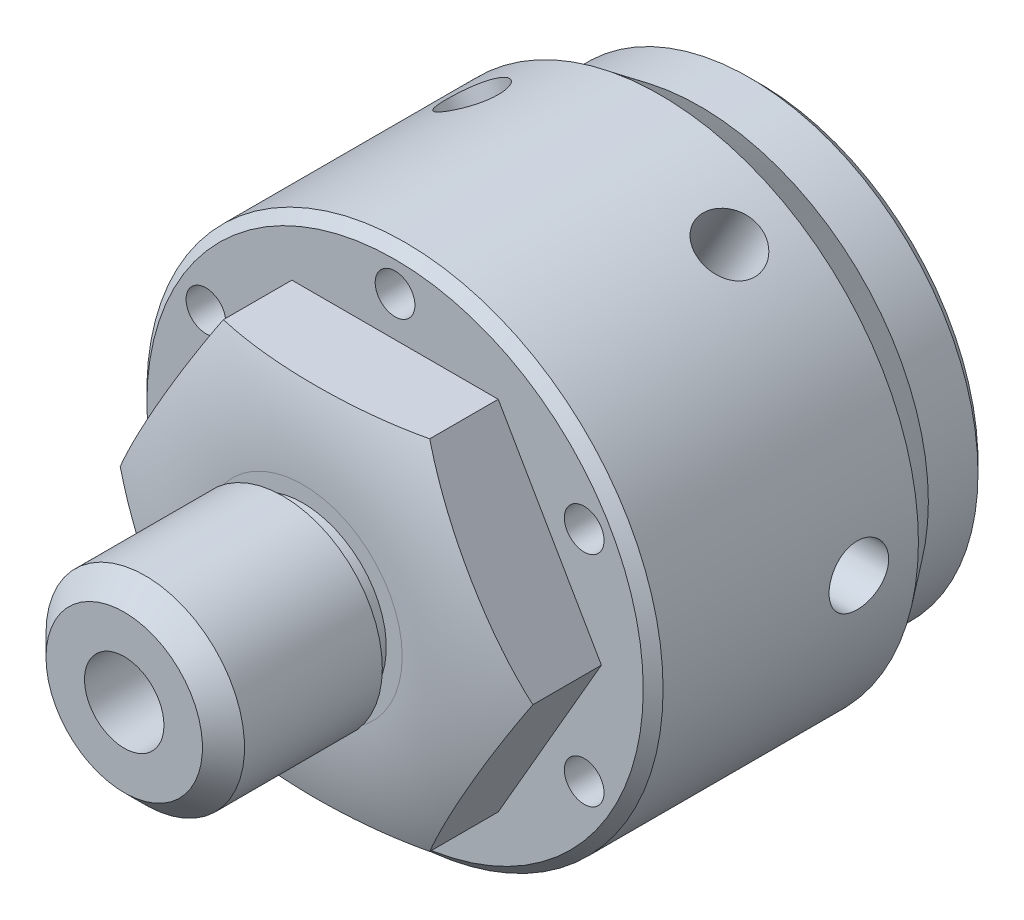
ISO-10303-21;
HEADER;
FILE_DESCRIPTION(('STEP AP214'),'2;1');
FILE_NAME('part.step','',(''),(''),'','','');
FILE_SCHEMA(('AUTOMOTIVE_DESIGN { 1 0 10303 214 1 1 1 1 }'));
ENDSEC;
DATA;
#1=APPLICATION_CONTEXT('core data for automotive mechanical design processes');
#2=APPLICATION_PROTOCOL_DEFINITION('international standard','automotive_design',2000,#1);
#3=PRODUCT_CONTEXT('',#1,'mechanical');
#4=PRODUCT('Part','Part','',(#3));
#5=PRODUCT_RELATED_PRODUCT_CATEGORY('part','',(#4));
#6=PRODUCT_DEFINITION_FORMATION('','',#4);
#7=PRODUCT_DEFINITION_CONTEXT('part definition',#1,'design');
#8=PRODUCT_DEFINITION('design','',#6,#7);
#9=PRODUCT_DEFINITION_SHAPE('','',#8);
#10=(LENGTH_UNIT() NAMED_UNIT(*) SI_UNIT(.MILLI.,.METRE.));
#11=(NAMED_UNIT(*) PLANE_ANGLE_UNIT() SI_UNIT($,.RADIAN.));
#12=(NAMED_UNIT(*) SI_UNIT($,.STERADIAN.) SOLID_ANGLE_UNIT());
#13=UNCERTAINTY_MEASURE_WITH_UNIT(LENGTH_MEASURE(1.E-05),#10,'distance_accuracy_value','');
#14=(GEOMETRIC_REPRESENTATION_CONTEXT(3) GLOBAL_UNCERTAINTY_ASSIGNED_CONTEXT((#13)) GLOBAL_UNIT_ASSIGNED_CONTEXT((#10,
#11,#12)) REPRESENTATION_CONTEXT('',''));
#15=CARTESIAN_POINT('',(0.,0.,0.));
#16=DIRECTION('',(0.,0.,1.));
#17=DIRECTION('',(1.,0.,0.));
#18=AXIS2_PLACEMENT_3D('',#15,#16,#17);
#19=CARTESIAN_POINT('',(16.4977839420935,28.575,-43.307));
#20=DIRECTION('',(-0.866025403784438,-0.500000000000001,0.));
#21=DIRECTION('',(0.500000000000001,-0.866025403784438,0.));
#22=AXIS2_PLACEMENT_3D('',#19,#20,#21);
#23=PLANE('',#22);
#24=CARTESIAN_POINT('',(32.9955678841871,0.,-32.3507182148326));
#25=CARTESIAN_POINT('',(32.4876981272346,0.879656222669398,-32.1152828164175));
#26=CARTESIAN_POINT('',(31.9767763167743,1.76459875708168,-31.9074283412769));
#27=CARTESIAN_POINT('',(30.9506705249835,3.54186612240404,-31.5423808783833));
#28=CARTESIAN_POINT('',(30.4354888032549,4.43418703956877,-31.3851626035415));
#29=CARTESIAN_POINT('',(29.4021107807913,6.22405027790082,-31.1166392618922));
#30=CARTESIAN_POINT('',(28.8839140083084,7.12159341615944,-31.0053415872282));
#31=CARTESIAN_POINT('',(27.845645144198,8.91992784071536,-30.824593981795));
#32=CARTESIAN_POINT('',(27.3255727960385,9.82071957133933,-30.7551500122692));
#33=CARTESIAN_POINT('',(26.2934848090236,11.6083484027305,-30.6559859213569));
#34=CARTESIAN_POINT('',(25.7814848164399,12.4951584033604,-30.6256017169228));
#35=CARTESIAN_POINT('',(24.7572732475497,14.2691448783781,-30.6009647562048));
#36=CARTESIAN_POINT('',(24.2450616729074,15.1563213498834,-30.606711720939));
#37=CARTESIAN_POINT('',(23.2211914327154,16.9297166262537,-30.6546022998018));
#38=CARTESIAN_POINT('',(22.7095326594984,17.815935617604,-30.696736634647));
#39=CARTESIAN_POINT('',(21.6874012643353,19.5863191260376,-30.8192824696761));
#40=CARTESIAN_POINT('',(21.176928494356,20.4704838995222,-30.8996889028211));
#41=CARTESIAN_POINT('',(20.3179613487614,21.9582586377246,-31.0702501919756));
#42=CARTESIAN_POINT('',(19.9689170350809,22.5628211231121,-31.149423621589));
#43=CARTESIAN_POINT('',(19.2722625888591,23.769462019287,-31.3285766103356));
#44=CARTESIAN_POINT('',(18.9246520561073,24.3715411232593,-31.4285498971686));
#45=CARTESIAN_POINT('',(18.2291721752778,25.5761476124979,-31.6513480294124));
#46=CARTESIAN_POINT('',(17.8813131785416,26.178657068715,-31.7743029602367));
#47=CARTESIAN_POINT('',(17.1877509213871,27.3799421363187,-32.0441772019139));
#48=CARTESIAN_POINT('',(16.8420488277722,27.9787157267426,-32.191108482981));
#49=CARTESIAN_POINT('',(16.4977839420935,28.575,-32.3507182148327));
#50=B_SPLINE_CURVE_WITH_KNOTS('',3,(#24,#25,#26,#27,#28,#29,#30,#31,#32,#33,#34,#35,#36,#37,#38,
#39,#40,#41,#42,#43,#44,#45,#46,#47,#48,#49),.UNSPECIFIED.,.F.,.F.,(4,2,2,2,2,2,2,2,2,2,2,2,4),
(0.,3.12721321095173,6.25286230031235,9.3790143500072,12.5056115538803,15.5783159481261,
18.6509966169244,21.7228939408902,24.7943846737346,26.9018011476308,29.0085830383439,
31.1276726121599,33.2478233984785),.UNSPECIFIED.);
#51=CARTESIAN_POINT('',(32.9955678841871,0.,-32.3507182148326));
#52=VERTEX_POINT('',#51);
#53=CARTESIAN_POINT('',(16.4977839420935,28.575,-32.3507182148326));
#54=VERTEX_POINT('',#53);
#55=EDGE_CURVE('E381',#52,#54,#50,.T.);
#56=ORIENTED_EDGE('',*,*,#55,.F.);
#57=DIRECTION('',(0.,0.,1.));
#58=VECTOR('',#57,1.);
#59=CARTESIAN_POINT('',(32.9955678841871,0.,-37.8288591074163));
#60=LINE('',#59,#58);
#61=CARTESIAN_POINT('',(32.9955678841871,0.,-43.307));
#62=VERTEX_POINT('',#61);
#63=EDGE_CURVE('E391',#62,#52,#60,.T.);
#64=ORIENTED_EDGE('',*,*,#63,.F.);
#65=DIRECTION('',(-0.500000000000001,0.866025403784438,0.));
#66=VECTOR('',#65,1.);
#67=CARTESIAN_POINT('',(24.7466759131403,14.2875,-43.307));
#68=LINE('',#67,#66);
#69=CARTESIAN_POINT('',(16.4977839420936,28.575,-43.307));
#70=VERTEX_POINT('',#69);
#71=EDGE_CURVE('E494',#62,#70,#68,.T.);
#72=ORIENTED_EDGE('',*,*,#71,.T.);
#73=DIRECTION('',(0.,0.,1.));
#74=VECTOR('',#73,1.);
#75=CARTESIAN_POINT('',(16.4977839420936,28.575,-37.8288591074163));
#76=LINE('',#75,#74);
#77=EDGE_CURVE('E85',#70,#54,#76,.T.);
#78=ORIENTED_EDGE('',*,*,#77,.T.);
#79=EDGE_LOOP('',(#56,#64,#72,#78));
#80=FACE_BOUND('',#79,.T.);
#81=ADVANCED_FACE('F67',(#80),#23,.F.);
#82=CARTESIAN_POINT('',(-16.4977839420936,28.575,-43.307));
#83=DIRECTION('',(0.,-1.,0.));
#84=DIRECTION('',(1.,0.,0.));
#85=AXIS2_PLACEMENT_3D('',#82,#83,#84);
#86=PLANE('',#85);
#87=CARTESIAN_POINT('',(16.4977839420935,28.575,-32.3507182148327));
#88=CARTESIAN_POINT('',(15.4820444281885,28.575,-32.1152828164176));
#89=CARTESIAN_POINT('',(14.4602008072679,28.575,-31.907428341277));
#90=CARTESIAN_POINT('',(12.4079892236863,28.575,-31.5423808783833));
#91=CARTESIAN_POINT('',(11.3776257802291,28.575,-31.3851626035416));
#92=CARTESIAN_POINT('',(9.31086973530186,28.575,-31.1166392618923));
#93=CARTESIAN_POINT('',(8.27447619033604,28.575,-31.0053415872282));
#94=CARTESIAN_POINT('',(6.19793846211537,28.575,-30.8245939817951));
#95=CARTESIAN_POINT('',(5.15779376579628,28.575,-30.7551500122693));
#96=CARTESIAN_POINT('',(3.09361779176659,28.575,-30.6559859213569));
#97=CARTESIAN_POINT('',(2.06961780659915,28.575,-30.6256017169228));
#98=CARTESIAN_POINT('',(0.0211946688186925,28.575,-30.6009647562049));
#99=CARTESIAN_POINT('',(-1.00322848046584,28.575,-30.6067117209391));
#100=CARTESIAN_POINT('',(-3.05096896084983,28.575,-30.6546022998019));
#101=CARTESIAN_POINT('',(-4.07428650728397,28.575,-30.6967366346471));
#102=CARTESIAN_POINT('',(-6.11854929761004,28.575,-30.8192824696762));
#103=CARTESIAN_POINT('',(-7.13949483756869,28.575,-30.8996889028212));
#104=CARTESIAN_POINT('',(-8.85742912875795,28.575,-31.0702501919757));
#105=CARTESIAN_POINT('',(-9.55551775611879,28.575,-31.1494236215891));
#106=CARTESIAN_POINT('',(-10.9488266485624,28.575,-31.3285766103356));
#107=CARTESIAN_POINT('',(-11.6440477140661,28.575,-31.4285498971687));
#108=CARTESIAN_POINT('',(-13.0350074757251,28.575,-31.6513480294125));
#109=CARTESIAN_POINT('',(-13.7307254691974,28.575,-31.7743029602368));
#110=CARTESIAN_POINT('',(-15.1178499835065,28.575,-32.0441772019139));
#111=CARTESIAN_POINT('',(-15.8092541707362,28.575,-32.1911084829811));
#112=CARTESIAN_POINT('',(-16.4977839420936,28.575,-32.3507182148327));
#113=B_SPLINE_CURVE_WITH_KNOTS('',3,(#87,#88,#89,#90,#91,#92,#93,#94,#95,#96,#97,#98,#99,#100,
#101,#102,#103,#104,#105,#106,#107,#108,#109,#110,#111,#112),.UNSPECIFIED.,.F.,.F.,(4,2,2,2,2,2,
2,2,2,2,2,2,4),(0.,3.12721321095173,6.25286230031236,9.37901435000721,12.5056115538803,
15.5783159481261,18.6509966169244,21.7228939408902,24.7943846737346,26.9018011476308,
29.0085830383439,31.1276726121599,33.2478233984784),.UNSPECIFIED.);
#114=CARTESIAN_POINT('',(-16.4977839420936,28.575,-32.3507182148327));
#115=VERTEX_POINT('',#114);
#116=EDGE_CURVE('E394',#54,#115,#113,.T.);
#117=ORIENTED_EDGE('',*,*,#116,.F.);
#118=ORIENTED_EDGE('',*,*,#77,.F.);
#119=DIRECTION('',(-1.,0.,0.));
#120=VECTOR('',#119,1.);
#121=CARTESIAN_POINT('',(0.,28.575,-43.307));
#122=LINE('',#121,#120);
#123=CARTESIAN_POINT('',(-16.4977839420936,28.575,-43.307));
#124=VERTEX_POINT('',#123);
#125=EDGE_CURVE('E504',#70,#124,#122,.T.);
#126=ORIENTED_EDGE('',*,*,#125,.T.);
#127=DIRECTION('',(0.,0.,1.));
#128=VECTOR('',#127,1.);
#129=CARTESIAN_POINT('',(-16.4977839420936,28.575,-37.8288591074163));
#130=LINE('',#129,#128);
#131=EDGE_CURVE('E638',#124,#115,#130,.T.);
#132=ORIENTED_EDGE('',*,*,#131,.T.);
#133=EDGE_LOOP('',(#117,#118,#126,#132));
#134=FACE_BOUND('',#133,.T.);
#135=ADVANCED_FACE('F377',(#134),#86,.F.);
#136=CARTESIAN_POINT('',(-32.9955678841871,0.,-43.307));
#137=DIRECTION('',(0.866025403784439,-0.499999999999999,0.));
#138=DIRECTION('',(0.499999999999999,0.866025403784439,0.));
#139=AXIS2_PLACEMENT_3D('',#136,#137,#138);
#140=PLANE('',#139);
#141=CARTESIAN_POINT('',(-16.4977839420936,28.575,-32.3507182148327));
#142=CARTESIAN_POINT('',(-17.0056536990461,27.6953437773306,-32.1152828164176));
#143=CARTESIAN_POINT('',(-17.5165755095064,26.8104012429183,-31.907428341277));
#144=CARTESIAN_POINT('',(-18.5426813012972,25.0331338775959,-31.5423808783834));
#145=CARTESIAN_POINT('',(-19.0578630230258,24.1408129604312,-31.3851626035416));
#146=CARTESIAN_POINT('',(-20.0912410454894,22.3509497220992,-31.1166392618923));
#147=CARTESIAN_POINT('',(-20.6094378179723,21.4534065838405,-31.0053415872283));
#148=CARTESIAN_POINT('',(-21.6477066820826,19.6550721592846,-30.8245939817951));
#149=CARTESIAN_POINT('',(-22.1677790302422,18.7542804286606,-30.7551500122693));
#150=CARTESIAN_POINT('',(-23.199867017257,16.9666515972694,-30.6559859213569));
#151=CARTESIAN_POINT('',(-23.7118670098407,16.0798415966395,-30.6256017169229));
#152=CARTESIAN_POINT('',(-24.736078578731,14.3058551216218,-30.6009647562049));
#153=CARTESIAN_POINT('',(-25.2482901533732,13.4186786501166,-30.6067117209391));
#154=CARTESIAN_POINT('',(-26.2721603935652,11.6452833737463,-30.6546022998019));
#155=CARTESIAN_POINT('',(-26.7838191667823,10.759064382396,-30.6967366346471));
#156=CARTESIAN_POINT('',(-27.8059505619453,8.98868087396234,-30.8192824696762));
#157=CARTESIAN_POINT('',(-28.3164233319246,8.10451610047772,-30.8996889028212));
#158=CARTESIAN_POINT('',(-29.1753904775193,6.61674136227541,-31.0702501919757));
#159=CARTESIAN_POINT('',(-29.5244347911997,6.01217887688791,-31.1494236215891));
#160=CARTESIAN_POINT('',(-30.2210892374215,4.80553798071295,-31.3285766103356));
#161=CARTESIAN_POINT('',(-30.5686997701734,4.20345887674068,-31.4285498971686));
#162=CARTESIAN_POINT('',(-31.2641796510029,2.99885238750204,-31.6513480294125));
#163=CARTESIAN_POINT('',(-31.612038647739,2.39634293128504,-31.7743029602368));
#164=CARTESIAN_POINT('',(-32.3056009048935,1.19505786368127,-32.0441772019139));
#165=CARTESIAN_POINT('',(-32.6513029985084,0.59628427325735,-32.191108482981));
#166=CARTESIAN_POINT('',(-32.9955678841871,0.,-32.3507182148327));
#167=B_SPLINE_CURVE_WITH_KNOTS('',3,(#141,#142,#143,#144,#145,#146,#147,#148,#149,#150,#151,
#152,#153,#154,#155,#156,#157,#158,#159,#160,#161,#162,#163,#164,#165,#166),.UNSPECIFIED.,.F.,
.F.,(4,2,2,2,2,2,2,2,2,2,2,2,4),(0.,3.12721321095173,6.25286230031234,9.37901435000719,
12.5056115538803,15.5783159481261,18.6509966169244,21.7228939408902,24.7943846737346,
26.9018011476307,29.0085830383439,31.1276726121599,33.2478233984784),.UNSPECIFIED.);
#168=CARTESIAN_POINT('',(-32.9955678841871,0.,-32.3507182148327));
#169=VERTEX_POINT('',#168);
#170=EDGE_CURVE('E419',#115,#169,#167,.T.);
#171=ORIENTED_EDGE('',*,*,#170,.F.);
#172=ORIENTED_EDGE('',*,*,#131,.F.);
#173=DIRECTION('',(-0.499999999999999,-0.866025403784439,0.));
#174=VECTOR('',#173,1.);
#175=CARTESIAN_POINT('',(-24.7466759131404,14.2875,-43.307));
#176=LINE('',#175,#174);
#177=CARTESIAN_POINT('',(-32.9955678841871,0.,-43.307));
#178=VERTEX_POINT('',#177);
#179=EDGE_CURVE('E562',#124,#178,#176,.T.);
#180=ORIENTED_EDGE('',*,*,#179,.T.);
#181=DIRECTION('',(0.,0.,1.));
#182=VECTOR('',#181,1.);
#183=CARTESIAN_POINT('',(-32.9955678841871,0.,-37.8288591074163));
#184=LINE('',#183,#182);
#185=EDGE_CURVE('E442',#178,#169,#184,.T.);
#186=ORIENTED_EDGE('',*,*,#185,.T.);
#187=EDGE_LOOP('',(#171,#172,#180,#186));
#188=FACE_BOUND('',#187,.T.);
#189=ADVANCED_FACE('F865',(#188),#140,.F.);
#190=CARTESIAN_POINT('',(-16.4977839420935,-28.575,-43.307));
#191=DIRECTION('',(0.866025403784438,0.500000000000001,0.));
#192=DIRECTION('',(-0.500000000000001,0.866025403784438,0.));
#193=AXIS2_PLACEMENT_3D('',#190,#191,#192);
#194=PLANE('',#193);
#195=CARTESIAN_POINT('',(-32.9955678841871,0.,-32.3507182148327));
#196=CARTESIAN_POINT('',(-32.4876981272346,-0.879656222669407,-32.1152828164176));
#197=CARTESIAN_POINT('',(-31.9767763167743,-1.76459875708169,-31.907428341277));
#198=CARTESIAN_POINT('',(-30.9506705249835,-3.54186612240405,-31.5423808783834));
#199=CARTESIAN_POINT('',(-30.4354888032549,-4.43418703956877,-31.3851626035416));
#200=CARTESIAN_POINT('',(-29.4021107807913,-6.22405027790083,-31.1166392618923));
#201=CARTESIAN_POINT('',(-28.8839140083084,-7.12159341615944,-31.0053415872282));
#202=CARTESIAN_POINT('',(-27.845645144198,-8.91992784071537,-30.8245939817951));
#203=CARTESIAN_POINT('',(-27.3255727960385,-9.82071957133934,-30.7551500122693));
#204=CARTESIAN_POINT('',(-26.2934848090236,-11.6083484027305,-30.6559859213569));
#205=CARTESIAN_POINT('',(-25.7814848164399,-12.4951584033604,-30.6256017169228));
#206=CARTESIAN_POINT('',(-24.7572732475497,-14.2691448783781,-30.6009647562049));
#207=CARTESIAN_POINT('',(-24.2450616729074,-15.1563213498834,-30.606711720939));
#208=CARTESIAN_POINT('',(-23.2211914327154,-16.9297166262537,-30.6546022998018));
#209=CARTESIAN_POINT('',(-22.7095326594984,-17.815935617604,-30.6967366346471));
#210=CARTESIAN_POINT('',(-21.6874012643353,-19.5863191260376,-30.8192824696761));
#211=CARTESIAN_POINT('',(-21.176928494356,-20.4704838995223,-30.8996889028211));
#212=CARTESIAN_POINT('',(-20.3179613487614,-21.9582586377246,-31.0702501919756));
#213=CARTESIAN_POINT('',(-19.9689170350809,-22.5628211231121,-31.149423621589));
#214=CARTESIAN_POINT('',(-19.2722625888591,-23.769462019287,-31.3285766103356));
#215=CARTESIAN_POINT('',(-18.9246520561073,-24.3715411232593,-31.4285498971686));
#216=CARTESIAN_POINT('',(-18.2291721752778,-25.5761476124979,-31.6513480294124));
#217=CARTESIAN_POINT('',(-17.8813131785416,-26.1786570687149,-31.7743029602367));
#218=CARTESIAN_POINT('',(-17.1877509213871,-27.3799421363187,-32.0441772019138));
#219=CARTESIAN_POINT('',(-16.8420488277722,-27.9787157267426,-32.191108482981));
#220=CARTESIAN_POINT('',(-16.4977839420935,-28.575,-32.3507182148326));
#221=B_SPLINE_CURVE_WITH_KNOTS('',3,(#195,#196,#197,#198,#199,#200,#201,#202,#203,#204,#205,
#206,#207,#208,#209,#210,#211,#212,#213,#214,#215,#216,#217,#218,#219,#220),.UNSPECIFIED.,.F.,
.F.,(4,2,2,2,2,2,2,2,2,2,2,2,4),(0.,3.12721321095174,6.25286230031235,9.3790143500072,
12.5056115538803,15.5783159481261,18.6509966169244,21.7228939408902,24.7943846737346,
26.9018011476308,29.0085830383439,31.1276726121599,33.2478233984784),.UNSPECIFIED.);
#222=CARTESIAN_POINT('',(-16.4977839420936,-28.575,-32.3507182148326));
#223=VERTEX_POINT('',#222);
#224=EDGE_CURVE('E426',#169,#223,#221,.T.);
#225=ORIENTED_EDGE('',*,*,#224,.F.);
#226=ORIENTED_EDGE('',*,*,#185,.F.);
#227=DIRECTION('',(0.499999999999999,-0.866025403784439,0.));
#228=VECTOR('',#227,1.);
#229=CARTESIAN_POINT('',(-24.7466759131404,-14.2875,-43.307));
#230=LINE('',#229,#228);
#231=CARTESIAN_POINT('',(-16.4977839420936,-28.575,-43.307));
#232=VERTEX_POINT('',#231);
#233=EDGE_CURVE('E542',#178,#232,#230,.T.);
#234=ORIENTED_EDGE('',*,*,#233,.T.);
#235=DIRECTION('',(0.,0.,1.));
#236=VECTOR('',#235,1.);
#237=CARTESIAN_POINT('',(-16.4977839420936,-28.575,-37.8288591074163));
#238=LINE('',#237,#236);
#239=EDGE_CURVE('E443',#232,#223,#238,.T.);
#240=ORIENTED_EDGE('',*,*,#239,.T.);
#241=EDGE_LOOP('',(#225,#226,#234,#240));
#242=FACE_BOUND('',#241,.T.);
#243=ADVANCED_FACE('F458',(#242),#194,.F.);
#244=CARTESIAN_POINT('',(16.4977839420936,-28.575,-43.307));
#245=DIRECTION('',(0.,1.,0.));
#246=DIRECTION('',(-1.,0.,0.));
#247=AXIS2_PLACEMENT_3D('',#244,#245,#246);
#248=PLANE('',#247);
#249=CARTESIAN_POINT('',(-16.4977839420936,-28.575,-32.3507182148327));
#250=CARTESIAN_POINT('',(-15.4820444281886,-28.575,-32.1152828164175));
#251=CARTESIAN_POINT('',(-14.460200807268,-28.575,-31.907428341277));
#252=CARTESIAN_POINT('',(-12.4079892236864,-28.575,-31.5423808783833));
#253=CARTESIAN_POINT('',(-11.3776257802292,-28.575,-31.3851626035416));
#254=CARTESIAN_POINT('',(-9.31086973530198,-28.575,-31.1166392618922));
#255=CARTESIAN_POINT('',(-8.27447619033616,-28.575,-31.0053415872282));
#256=CARTESIAN_POINT('',(-6.19793846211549,-28.575,-30.824593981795));
#257=CARTESIAN_POINT('',(-5.15779376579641,-28.575,-30.7551500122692));
#258=CARTESIAN_POINT('',(-3.09361779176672,-28.575,-30.6559859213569));
#259=CARTESIAN_POINT('',(-2.06961780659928,-28.575,-30.6256017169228));
#260=CARTESIAN_POINT('',(-0.0211946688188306,-28.575,-30.6009647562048));
#261=CARTESIAN_POINT('',(1.0032284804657,-28.575,-30.606711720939));
#262=CARTESIAN_POINT('',(3.05096896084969,-28.575,-30.6546022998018));
#263=CARTESIAN_POINT('',(4.07428650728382,-28.575,-30.696736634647));
#264=CARTESIAN_POINT('',(6.11854929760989,-28.575,-30.8192824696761));
#265=CARTESIAN_POINT('',(7.13949483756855,-28.575,-30.8996889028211));
#266=CARTESIAN_POINT('',(8.85742912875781,-28.575,-31.0702501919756));
#267=CARTESIAN_POINT('',(9.55551775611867,-28.575,-31.149423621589));
#268=CARTESIAN_POINT('',(10.9488266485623,-28.575,-31.3285766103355));
#269=CARTESIAN_POINT('',(11.644047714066,-28.575,-31.4285498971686));
#270=CARTESIAN_POINT('',(13.035007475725,-28.575,-31.6513480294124));
#271=CARTESIAN_POINT('',(13.7307254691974,-28.575,-31.7743029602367));
#272=CARTESIAN_POINT('',(15.1178499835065,-28.575,-32.0441772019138));
#273=CARTESIAN_POINT('',(15.8092541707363,-28.575,-32.1911084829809));
#274=CARTESIAN_POINT('',(16.4977839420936,-28.575,-32.3507182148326));
#275=B_SPLINE_CURVE_WITH_KNOTS('',3,(#249,#250,#251,#252,#253,#254,#255,#256,#257,#258,#259,
#260,#261,#262,#263,#264,#265,#266,#267,#268,#269,#270,#271,#272,#273,#274),.UNSPECIFIED.,.F.,
.F.,(4,2,2,2,2,2,2,2,2,2,2,2,4),(0.,3.12721321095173,6.25286230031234,9.37901435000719,
12.5056115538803,15.5783159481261,18.6509966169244,21.7228939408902,24.7943846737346,
26.9018011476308,29.008583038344,31.12767261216,33.2478233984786),.UNSPECIFIED.);
#276=CARTESIAN_POINT('',(16.4977839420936,-28.575,-32.3507182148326));
#277=VERTEX_POINT('',#276);
#278=EDGE_CURVE('E434',#223,#277,#275,.T.);
#279=ORIENTED_EDGE('',*,*,#278,.F.);
#280=ORIENTED_EDGE('',*,*,#239,.F.);
#281=DIRECTION('',(1.,0.,0.));
#282=VECTOR('',#281,1.);
#283=CARTESIAN_POINT('',(0.,-28.575,-43.307));
#284=LINE('',#283,#282);
#285=CARTESIAN_POINT('',(16.4977839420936,-28.575,-43.307));
#286=VERTEX_POINT('',#285);
#287=EDGE_CURVE('E492',#232,#286,#284,.T.);
#288=ORIENTED_EDGE('',*,*,#287,.T.);
#289=DIRECTION('',(0.,0.,1.));
#290=VECTOR('',#289,1.);
#291=CARTESIAN_POINT('',(16.4977839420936,-28.575,-37.8288591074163));
#292=LINE('',#291,#290);
#293=EDGE_CURVE('E109',#286,#277,#292,.T.);
#294=ORIENTED_EDGE('',*,*,#293,.T.);
#295=EDGE_LOOP('',(#279,#280,#288,#294));
#296=FACE_BOUND('',#295,.T.);
#297=ADVANCED_FACE('F454',(#296),#248,.F.);
#298=CARTESIAN_POINT('',(39.6875,-39.6875,-43.307));
#299=DIRECTION('',(0.,0.,-1.));
#300=DIRECTION('',(-1.,0.,0.));
#301=AXIS2_PLACEMENT_3D('',#298,#299,#300);
#302=PLANE('',#301);
#303=CARTESIAN_POINT('',(0.,0.,-43.307));
#304=DIRECTION('',(0.,0.,-1.));
#305=DIRECTION('',(-1.,0.,0.));
#306=AXIS2_PLACEMENT_3D('',#303,#304,#305);
#307=CIRCLE('',#306,39.6875);
#308=CARTESIAN_POINT('',(-39.6875000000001,0.,-43.307));
#309=VERTEX_POINT('',#308);
#310=EDGE_CURVE('E469',#309,#309,#307,.F.);
#311=ORIENTED_EDGE('',*,*,#310,.T.);
#312=EDGE_LOOP('',(#311));
#313=FACE_BOUND('',#312,.T.);
#314=CARTESIAN_POINT('',(30.2459372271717,-17.4624999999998,-43.307));
#315=DIRECTION('',(0.,0.,1.));
#316=DIRECTION('',(1.,0.,0.));
#317=AXIS2_PLACEMENT_3D('',#314,#315,#316);
#318=CIRCLE('',#317,3.1749999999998);
#319=CARTESIAN_POINT('',(33.4209372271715,-17.4624999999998,-43.307));
#320=VERTEX_POINT('',#319);
#321=EDGE_CURVE('E153',#320,#320,#318,.T.);
#322=ORIENTED_EDGE('',*,*,#321,.F.);
#323=EDGE_LOOP('',(#322));
#324=FACE_BOUND('',#323,.T.);
#325=CARTESIAN_POINT('',(30.2459372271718,17.4625000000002,-43.307));
#326=DIRECTION('',(0.,0.,1.));
#327=DIRECTION('',(1.,0.,0.));
#328=AXIS2_PLACEMENT_3D('',#325,#326,#327);
#329=CIRCLE('',#328,3.1749999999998);
#330=CARTESIAN_POINT('',(33.4209372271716,17.4625000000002,-43.307));
#331=VERTEX_POINT('',#330);
#332=EDGE_CURVE('E152',#331,#331,#329,.T.);
#333=ORIENTED_EDGE('',*,*,#332,.F.);
#334=EDGE_LOOP('',(#333));
#335=FACE_BOUND('',#334,.T.);
#336=CARTESIAN_POINT('',(0.,34.9250000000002,-43.307));
#337=DIRECTION('',(0.,0.,1.));
#338=DIRECTION('',(1.,0.,0.));
#339=AXIS2_PLACEMENT_3D('',#336,#337,#338);
#340=CIRCLE('',#339,3.17499999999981);
#341=CARTESIAN_POINT('',(3.17499999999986,34.9250000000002,-43.307));
#342=VERTEX_POINT('',#341);
#343=EDGE_CURVE('E477',#342,#342,#340,.T.);
#344=ORIENTED_EDGE('',*,*,#343,.F.);
#345=EDGE_LOOP('',(#344));
#346=FACE_BOUND('',#345,.T.);
#347=CARTESIAN_POINT('',(-30.2459372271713,17.4625000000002,-43.307));
#348=DIRECTION('',(0.,0.,1.));
#349=DIRECTION('',(1.,0.,0.));
#350=AXIS2_PLACEMENT_3D('',#347,#348,#349);
#351=CIRCLE('',#350,3.17499999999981);
#352=CARTESIAN_POINT('',(-27.0709372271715,17.4625000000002,-43.307));
#353=VERTEX_POINT('',#352);
#354=EDGE_CURVE('E481',#353,#353,#351,.T.);
#355=ORIENTED_EDGE('',*,*,#354,.F.);
#356=EDGE_LOOP('',(#355));
#357=FACE_BOUND('',#356,.T.);
#358=CARTESIAN_POINT('',(-30.2459372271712,-17.4625000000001,-43.307));
#359=DIRECTION('',(0.,0.,1.));
#360=DIRECTION('',(1.,0.,0.));
#361=AXIS2_PLACEMENT_3D('',#358,#359,#360);
#362=CIRCLE('',#361,3.17499999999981);
#363=CARTESIAN_POINT('',(-27.0709372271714,-17.4625000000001,-43.307));
#364=VERTEX_POINT('',#363);
#365=EDGE_CURVE('E211',#364,#364,#362,.T.);
#366=ORIENTED_EDGE('',*,*,#365,.F.);
#367=EDGE_LOOP('',(#366));
#368=FACE_BOUND('',#367,.T.);
#369=CARTESIAN_POINT('',(5.96842082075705E-13,-34.9249999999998,-43.307));
#370=DIRECTION('',(0.,0.,1.));
#371=DIRECTION('',(1.,0.,0.));
#372=AXIS2_PLACEMENT_3D('',#369,#370,#371);
#373=CIRCLE('',#372,3.17499999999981);
#374=CARTESIAN_POINT('',(3.1750000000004,-34.9249999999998,-43.307));
#375=VERTEX_POINT('',#374);
#376=EDGE_CURVE('E187',#375,#375,#373,.T.);
#377=ORIENTED_EDGE('',*,*,#376,.F.);
#378=EDGE_LOOP('',(#377));
#379=FACE_BOUND('',#378,.T.);
#380=DIRECTION('',(0.499999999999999,0.866025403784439,0.));
#381=VECTOR('',#380,1.);
#382=CARTESIAN_POINT('',(24.7466759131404,-14.2875,-43.307));
#383=LINE('',#382,#381);
#384=EDGE_CURVE('E490',#286,#62,#383,.T.);
#385=ORIENTED_EDGE('',*,*,#384,.F.);
#386=ORIENTED_EDGE('',*,*,#287,.F.);
#387=ORIENTED_EDGE('',*,*,#233,.F.);
#388=ORIENTED_EDGE('',*,*,#179,.F.);
#389=ORIENTED_EDGE('',*,*,#125,.F.);
#390=ORIENTED_EDGE('',*,*,#71,.F.);
#391=EDGE_LOOP('',(#385,#386,#387,#388,#389,#390));
#392=FACE_BOUND('',#391,.T.);
#393=ADVANCED_FACE('F457',(#313,#324,#335,#346,#357,#368,#379,#392),#302,.F.);
#394=CARTESIAN_POINT('',(0.,0.,-85.725));
#395=DIRECTION('',(0.,0.,1.));
#396=DIRECTION('',(0.,-1.,0.));
#397=AXIS2_PLACEMENT_3D('',#394,#395,#396);
#398=CYLINDRICAL_SURFACE('',#397,41.275);
#399=CARTESIAN_POINT('',(0.,0.,-44.8945));
#400=DIRECTION('',(0.,0.,-1.));
#401=DIRECTION('',(0.,1.,0.));
#402=AXIS2_PLACEMENT_3D('',#399,#400,#401);
#403=CIRCLE('',#402,41.275);
#404=CARTESIAN_POINT('',(0.,41.2750000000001,-44.8945000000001));
#405=VERTEX_POINT('',#404);
#406=EDGE_CURVE('E1353',#405,#405,#403,.T.);
#407=ORIENTED_EDGE('',*,*,#406,.T.);
#408=EDGE_LOOP('',(#407));
#409=FACE_BOUND('',#408,.T.);
#410=CARTESIAN_POINT('',(-24.6241058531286,33.1252024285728,-76.1999999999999));
#411=CARTESIAN_POINT('',(-24.6241068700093,33.125201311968,-76.3333229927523));
#412=CARTESIAN_POINT('',(-24.6195815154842,33.1285670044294,-76.46662453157));
#413=CARTESIAN_POINT('',(-24.6015069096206,33.1419917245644,-76.7323203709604));
#414=CARTESIAN_POINT('',(-24.5879553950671,33.1520524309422,-76.86471443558));
#415=CARTESIAN_POINT('',(-24.551891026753,33.1787699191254,-77.1277028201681));
#416=CARTESIAN_POINT('',(-24.5293713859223,33.1954316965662,-77.2582956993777));
#417=CARTESIAN_POINT('',(-24.4754934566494,33.2351766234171,-77.5167018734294));
#418=CARTESIAN_POINT('',(-24.4441319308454,33.2582621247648,-77.644514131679));
#419=CARTESIAN_POINT('',(-24.3727935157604,33.3105766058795,-77.8962752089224));
#420=CARTESIAN_POINT('',(-24.3328254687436,33.3397992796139,-78.0202278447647));
#421=CARTESIAN_POINT('',(-24.2444711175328,33.4041049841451,-78.2635816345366));
#422=CARTESIAN_POINT('',(-24.1960817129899,33.4391901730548,-78.3829810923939));
#423=CARTESIAN_POINT('',(-24.0912045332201,33.5148275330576,-78.6162813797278));
#424=CARTESIAN_POINT('',(-24.0347212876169,33.5553766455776,-78.7301852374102));
#425=CARTESIAN_POINT('',(-23.9139406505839,33.6415601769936,-78.9518160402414));
#426=CARTESIAN_POINT('',(-23.8496403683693,33.6871964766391,-79.0595406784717));
#427=CARTESIAN_POINT('',(-23.7133493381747,33.783274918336,-79.2684287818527));
#428=CARTESIAN_POINT('',(-23.6413295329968,33.8337351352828,-79.3695649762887));
#429=CARTESIAN_POINT('',(-23.490203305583,33.9388338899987,-79.5641442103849));
#430=CARTESIAN_POINT('',(-23.4110942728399,33.9934739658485,-79.6575843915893));
#431=CARTESIAN_POINT('',(-23.246308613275,34.1063737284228,-79.8360474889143));
#432=CARTESIAN_POINT('',(-23.1606340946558,34.1646322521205,-79.9210730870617));
#433=CARTESIAN_POINT('',(-22.9831826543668,34.284258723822,-80.0821719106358));
#434=CARTESIAN_POINT('',(-22.8914034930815,34.345627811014,-80.1582418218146));
#435=CARTESIAN_POINT('',(-22.7020931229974,34.4710530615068,-80.301030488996));
#436=CARTESIAN_POINT('',(-22.6045483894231,34.5351154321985,-80.3677259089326));
#437=CARTESIAN_POINT('',(-22.4045318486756,34.6652111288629,-80.4910774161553));
#438=CARTESIAN_POINT('',(-22.3020582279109,34.7312451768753,-80.5477297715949));
#439=CARTESIAN_POINT('',(-21.9882935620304,34.9313866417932,-80.7019033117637));
#440=CARTESIAN_POINT('',(-21.7704454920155,35.0676753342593,-80.7838017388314));
#441=CARTESIAN_POINT('',(-21.324608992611,35.3405541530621,-80.9028918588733));
#442=CARTESIAN_POINT('',(-21.0966702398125,35.4771402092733,-80.9402817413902));
#443=CARTESIAN_POINT('',(-20.635957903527,35.7470849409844,-80.9699946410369));
#444=CARTESIAN_POINT('',(-20.4031844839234,35.8804437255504,-80.9623191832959));
#445=CARTESIAN_POINT('',(-19.9406583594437,36.1395315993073,-80.9022551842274));
#446=CARTESIAN_POINT('',(-19.7108965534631,36.2652939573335,-80.8500794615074));
#447=CARTESIAN_POINT('',(-19.2599951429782,36.5067618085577,-80.7028344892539));
#448=CARTESIAN_POINT('',(-19.0388556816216,36.6224671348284,-80.6077645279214));
#449=CARTESIAN_POINT('',(-18.6113186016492,36.8415844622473,-80.3771989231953));
#450=CARTESIAN_POINT('',(-18.4049562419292,36.9449674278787,-80.2416103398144));
#451=CARTESIAN_POINT('',(-18.0138269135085,37.1372486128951,-79.9339243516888));
#452=CARTESIAN_POINT('',(-17.829060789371,37.2261462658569,-79.7618255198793));
#453=CARTESIAN_POINT('',(-17.4858786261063,37.388581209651,-79.3848102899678));
#454=CARTESIAN_POINT('',(-17.3276223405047,37.4620260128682,-79.1797085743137));
#455=CARTESIAN_POINT('',(-17.0438914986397,37.5919647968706,-78.743148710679));
#456=CARTESIAN_POINT('',(-16.9184170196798,37.6484587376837,-78.5116905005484));
#457=CARTESIAN_POINT('',(-16.7043922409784,37.7439095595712,-78.0288327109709));
#458=CARTESIAN_POINT('',(-16.6158540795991,37.7828606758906,-77.7774266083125));
#459=CARTESIAN_POINT('',(-16.4788084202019,37.8428347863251,-77.2618886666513));
#460=CARTESIAN_POINT('',(-16.4302992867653,37.8638585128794,-76.9977573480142));
#461=CARTESIAN_POINT('',(-16.3751708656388,37.887733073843,-76.4658929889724));
#462=CARTESIAN_POINT('',(-16.3683122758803,37.8906877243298,-76.1981893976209));
#463=CARTESIAN_POINT('',(-16.396086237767,37.8786773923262,-75.6653533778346));
#464=CARTESIAN_POINT('',(-16.4307180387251,37.8637127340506,-75.400220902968));
#465=CARTESIAN_POINT('',(-16.5401040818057,37.8160559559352,-74.8808211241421));
#466=CARTESIAN_POINT('',(-16.614743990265,37.7834143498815,-74.6265250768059));
#467=CARTESIAN_POINT('',(-16.8015302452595,37.7007238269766,-74.1351198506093));
#468=CARTESIAN_POINT('',(-16.913677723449,37.6506743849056,-73.8980111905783));
#469=CARTESIAN_POINT('',(-17.1723508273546,37.533400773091,-73.4465352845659));
#470=CARTESIAN_POINT('',(-17.3190293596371,37.4661000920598,-73.2322755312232));
#471=CARTESIAN_POINT('',(-17.6417408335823,37.31522810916,-72.8336735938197));
#472=CARTESIAN_POINT('',(-17.8177747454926,37.2316562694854,-72.6493323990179));
#473=CARTESIAN_POINT('',(-18.1945607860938,37.0489885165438,-72.3148964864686));
#474=CARTESIAN_POINT('',(-18.395428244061,36.9498195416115,-72.1649715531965));
#475=CARTESIAN_POINT('',(-18.8149580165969,36.7379654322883,-71.9047974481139));
#476=CARTESIAN_POINT('',(-19.0336200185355,36.6252805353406,-71.7945475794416));
#477=CARTESIAN_POINT('',(-19.4814830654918,36.3890285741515,-71.617131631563));
#478=CARTESIAN_POINT('',(-19.7106583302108,36.2654875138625,-71.549865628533));
#479=CARTESIAN_POINT('',(-20.1733105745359,36.0101759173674,-71.4600197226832));
#480=CARTESIAN_POINT('',(-20.4067873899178,35.8784056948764,-71.4374381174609));
#481=CARTESIAN_POINT('',(-20.7541126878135,35.6778695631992,-71.4375310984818));
#482=CARTESIAN_POINT('',(-20.8691352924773,35.6107075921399,-71.4431694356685));
#483=CARTESIAN_POINT('',(-21.0977080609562,35.4757648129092,-71.4655799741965));
#484=CARTESIAN_POINT('',(-21.2112587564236,35.4079842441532,-71.4823480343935));
#485=CARTESIAN_POINT('',(-21.4361433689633,35.2722930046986,-71.5269075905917));
#486=CARTESIAN_POINT('',(-21.5474764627,35.2043822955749,-71.5547031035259));
#487=CARTESIAN_POINT('',(-21.7670984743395,35.069013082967,-71.6210986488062));
#488=CARTESIAN_POINT('',(-21.8753884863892,35.0015544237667,-71.6596947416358));
#489=CARTESIAN_POINT('',(-22.0882572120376,34.8676115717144,-71.7474200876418));
#490=CARTESIAN_POINT('',(-22.192835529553,34.8011274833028,-71.7965504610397));
#491=CARTESIAN_POINT('',(-22.3975555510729,34.6697262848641,-71.9049678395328));
#492=CARTESIAN_POINT('',(-22.4976988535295,34.6048086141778,-71.9642511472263));
#493=CARTESIAN_POINT('',(-22.6929923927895,34.477055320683,-72.0925875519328));
#494=CARTESIAN_POINT('',(-22.7881408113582,34.4142204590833,-72.161644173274));
#495=CARTESIAN_POINT('',(-22.972784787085,34.2912392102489,-72.3089967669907));
#496=CARTESIAN_POINT('',(-23.0622823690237,34.2310918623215,-72.387289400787));
#497=CARTESIAN_POINT('',(-23.2356365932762,34.1136606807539,-72.5530797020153));
#498=CARTESIAN_POINT('',(-23.3194564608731,34.0563960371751,-72.6406294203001));
#499=CARTESIAN_POINT('',(-23.4803332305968,33.9456788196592,-72.8238968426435));
#500=CARTESIAN_POINT('',(-23.5573925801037,33.892224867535,-72.9196115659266));
#501=CARTESIAN_POINT('',(-23.7043708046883,33.7895911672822,-73.1186283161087));
#502=CARTESIAN_POINT('',(-23.7742853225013,33.740414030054,-73.2219349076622));
#503=CARTESIAN_POINT('',(-23.9064851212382,33.6468743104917,-73.4353229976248));
#504=CARTESIAN_POINT('',(-23.9687732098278,33.6025099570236,-73.5454019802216));
#505=CARTESIAN_POINT('',(-24.0856015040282,33.5188694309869,-73.772018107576));
#506=CARTESIAN_POINT('',(-24.1401123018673,33.4796126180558,-73.8885775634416));
#507=CARTESIAN_POINT('',(-24.2407728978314,33.4068019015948,-74.1269139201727));
#508=CARTESIAN_POINT('',(-24.2869257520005,33.373245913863,-74.2486888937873));
#509=CARTESIAN_POINT('',(-24.3705903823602,33.3121994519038,-74.4965368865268));
#510=CARTESIAN_POINT('',(-24.4081090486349,33.284704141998,-74.6226063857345));
#511=CARTESIAN_POINT('',(-24.4743219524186,33.2360478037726,-74.8781921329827));
#512=CARTESIAN_POINT('',(-24.5030183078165,33.2148852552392,-75.007707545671));
#513=CARTESIAN_POINT('',(-24.5594003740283,33.1732287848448,-75.3123870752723));
#514=CARTESIAN_POINT('',(-24.583646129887,33.1552464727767,-75.4885480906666));
#515=CARTESIAN_POINT('',(-24.6159981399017,33.1312340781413,-75.8431522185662));
#516=CARTESIAN_POINT('',(-24.6241044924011,33.1252039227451,-76.0215953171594));
#517=CARTESIAN_POINT('',(-24.6241058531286,33.1252024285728,-76.1999999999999));
#518=B_SPLINE_CURVE_WITH_KNOTS('',3,(#410,#411,#412,#413,#414,#415,#416,#417,#418,#419,#420,
#421,#422,#423,#424,#425,#426,#427,#428,#429,#430,#431,#432,#433,#434,#435,#436,#437,#438,#439,
#440,#441,#442,#443,#444,#445,#446,#447,#448,#449,#450,#451,#452,#453,#454,#455,#456,#457,#458,
#459,#460,#461,#462,#463,#464,#465,#466,#467,#468,#469,#470,#471,#472,#473,#474,#475,#476,#477,
#478,#479,#480,#481,#482,#483,#484,#485,#486,#487,#488,#489,#490,#491,#492,#493,#494,#495,#496,
#497,#498,#499,#500,#501,#502,#503,#504,#505,#506,#507,#508,#509,#510,#511,#512,#513,#514,#515,
#516,#517),.UNSPECIFIED.,.T.,.F.,(4,2,2,2,2,2,2,2,2,2,2,2,2,2,2,2,2,2,2,2,2,2,2,2,2,2,2,2,2,2,2,
2,2,2,2,2,2,2,2,2,2,2,2,2,2,2,2,2,2,2,2,2,2,4),(0.,0.399812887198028,0.799726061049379,
1.19994246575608,1.6003055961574,2.00025934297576,2.40036064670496,2.80023890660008,
3.20026549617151,3.60185454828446,4.00359209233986,4.40520117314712,4.80695841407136,
5.20969868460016,5.61258829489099,6.41747176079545,7.21875763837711,8.02001639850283,
8.81746455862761,9.61492595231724,10.4142307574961,11.2135668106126,12.0175588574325,
12.8215528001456,13.6258107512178,14.4300358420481,15.2296358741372,16.0292214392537,
16.8265340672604,17.6238707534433,18.4248068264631,19.2257693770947,20.0306022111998,
20.8354209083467,21.6383617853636,22.4412720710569,22.8408263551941,23.2402320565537,
23.6397833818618,24.0391891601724,24.4386374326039,24.8379405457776,25.2373880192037,
25.6366915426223,26.0383734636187,26.4399093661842,26.8416887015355,27.2433196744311,
27.6464311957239,28.0493950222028,28.4520361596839,28.8545805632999,29.3895890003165,
29.9245941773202),.UNSPECIFIED.);
#519=CARTESIAN_POINT('',(-24.6241058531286,33.1252024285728,-76.1999999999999));
#520=VERTEX_POINT('',#519);
#521=EDGE_CURVE('E715',#520,#520,#518,.T.);
#522=ORIENTED_EDGE('',*,*,#521,.T.);
#523=EDGE_LOOP('',(#522));
#524=FACE_BOUND('',#523,.T.);
#525=CARTESIAN_POINT('',(-41.2750000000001,0.,-71.4375));
#526=CARTESIAN_POINT('',(-41.2750004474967,-0.133326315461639,-71.437498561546));
#527=CARTESIAN_POINT('',(-41.2743527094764,-0.266631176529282,-71.443100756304));
#528=CARTESIAN_POINT('',(-41.2717807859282,-0.532333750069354,-71.4654673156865));
#529=CARTESIAN_POINT('',(-41.2698562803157,-0.664731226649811,-71.4822344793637));
#530=CARTESIAN_POINT('',(-41.264782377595,-0.927726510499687,-71.5268282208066));
#531=CARTESIAN_POINT('',(-41.2616320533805,-1.05832287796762,-71.5546631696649));
#532=CARTESIAN_POINT('',(-41.2541942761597,-1.31673610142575,-71.6211989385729));
#533=CARTESIAN_POINT('',(-41.2499064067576,-1.44455192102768,-71.6599037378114));
#534=CARTESIAN_POINT('',(-41.2403198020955,-1.69632057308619,-71.7478471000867));
#535=CARTESIAN_POINT('',(-41.2350221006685,-1.820277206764,-71.7970748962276));
#536=CARTESIAN_POINT('',(-41.223559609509,-2.06363864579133,-71.9057518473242));
#537=CARTESIAN_POINT('',(-41.2173945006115,-2.18304175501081,-71.9652047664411));
#538=CARTESIAN_POINT('',(-41.204375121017,-2.41634868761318,-72.0938580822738));
#539=CARTESIAN_POINT('',(-41.1975212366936,-2.53025554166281,-72.16305302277));
#540=CARTESIAN_POINT('',(-41.1833104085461,-2.75189150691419,-72.3107532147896));
#541=CARTESIAN_POINT('',(-41.1759532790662,-2.85961831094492,-72.3892619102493));
#542=CARTESIAN_POINT('',(-41.1609149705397,-3.06850340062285,-72.5553374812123));
#543=CARTESIAN_POINT('',(-41.1532326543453,-3.16963483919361,-72.6429380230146));
#544=CARTESIAN_POINT('',(-41.1377841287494,-3.36420452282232,-72.8263644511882));
#545=CARTESIAN_POINT('',(-41.1300178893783,-3.45763990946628,-72.9221933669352));
#546=CARTESIAN_POINT('',(-41.1146259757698,-3.63609363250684,-73.1213477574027));
#547=CARTESIAN_POINT('',(-41.1070002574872,-3.7211146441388,-73.2246708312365));
#548=CARTESIAN_POINT('',(-41.0920997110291,-3.88220465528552,-73.4381555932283));
#549=CARTESIAN_POINT('',(-41.0848250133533,-3.9582703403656,-73.5483197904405));
#550=CARTESIAN_POINT('',(-41.0708186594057,-4.10105424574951,-73.7749773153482));
#551=CARTESIAN_POINT('',(-41.0640884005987,-4.16774871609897,-73.8914857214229));
#552=CARTESIAN_POINT('',(-41.0513815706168,-4.2910982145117,-74.1297549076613));
#553=CARTESIAN_POINT('',(-41.0454052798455,-4.34774951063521,-74.2515176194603));
#554=CARTESIAN_POINT('',(-41.0288822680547,-4.50191976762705,-74.6233193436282));
#555=CARTESIAN_POINT('',(-41.0197250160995,-4.58381594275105,-74.880127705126));
#556=CARTESIAN_POINT('',(-41.0062427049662,-4.70290141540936,-75.402679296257));
#557=CARTESIAN_POINT('',(-41.0018962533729,-4.74028868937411,-75.6683775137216));
#558=CARTESIAN_POINT('',(-40.9984513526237,-4.76999483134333,-76.2023471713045));
#559=CARTESIAN_POINT('',(-40.9993527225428,-4.76231525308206,-76.4706185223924));
#560=CARTESIAN_POINT('',(-41.0062849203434,-4.70224469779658,-77.0007037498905));
#561=CARTESIAN_POINT('',(-41.0122908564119,-4.65007068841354,-77.2625426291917));
#562=CARTESIAN_POINT('',(-41.028715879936,-4.50283670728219,-77.7737257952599));
#563=CARTESIAN_POINT('',(-41.0391350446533,-4.4077759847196,-78.0230698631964));
#564=CARTESIAN_POINT('',(-41.0632411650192,-4.1772295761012,-78.5028609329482));
#565=CARTESIAN_POINT('',(-41.0769357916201,-4.04164880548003,-78.7332618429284));
#566=CARTESIAN_POINT('',(-41.1060436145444,-3.73397952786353,-79.1681224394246));
#567=CARTESIAN_POINT('',(-41.1214568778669,-3.56188959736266,-79.3725811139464));
#568=CARTESIAN_POINT('',(-41.1523760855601,-3.18488072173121,-79.7510129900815));
#569=CARTESIAN_POINT('',(-41.1678820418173,-2.9797746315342,-79.924799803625));
#570=CARTESIAN_POINT('',(-41.1971543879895,-2.54320227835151,-80.2355063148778));
#571=CARTESIAN_POINT('',(-41.2109207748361,-2.31173596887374,-80.3724259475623));
#572=CARTESIAN_POINT('',(-41.2351696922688,-1.82887590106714,-80.6055084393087));
#573=CARTESIAN_POINT('',(-41.2456513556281,-1.57747690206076,-80.7016605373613));
#574=CARTESIAN_POINT('',(-41.262141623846,-1.06195441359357,-80.8503352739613));
#575=CARTESIAN_POINT('',(-41.268150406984,-0.797831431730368,-80.9028596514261));
#576=CARTESIAN_POINT('',(-41.2749948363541,-0.265971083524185,-80.9625485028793));
#577=CARTESIAN_POINT('',(-41.2758597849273,0.00173708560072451,-80.969969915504));
#578=CARTESIAN_POINT('',(-41.2723979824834,0.534583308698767,-80.9399189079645));
#579=CARTESIAN_POINT('',(-41.2680713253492,0.799721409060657,-80.9024472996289));
#580=CARTESIAN_POINT('',(-41.2547308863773,1.3191498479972,-80.7838872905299));
#581=CARTESIAN_POINT('',(-41.2457301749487,1.57346830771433,-80.7029204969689));
#582=CARTESIAN_POINT('',(-41.2240501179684,2.06491573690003,-80.4997942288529));
#583=CARTESIAN_POINT('',(-41.2113706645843,2.30204420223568,-80.3776335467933));
#584=CARTESIAN_POINT('',(-41.1836755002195,2.75353381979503,-80.0949594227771));
#585=CARTESIAN_POINT('',(-41.1686497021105,2.96778961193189,-79.9342787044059));
#586=CARTESIAN_POINT('',(-41.137976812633,3.3663821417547,-79.5793626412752));
#587=CARTESIAN_POINT('',(-41.1223297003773,3.55071787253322,-79.3851261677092));
#588=CARTESIAN_POINT('',(-41.0920881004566,3.88514166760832,-78.9674883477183));
#589=CARTESIAN_POINT('',(-41.0774990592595,4.03506009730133,-78.7439507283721));
#590=CARTESIAN_POINT('',(-41.0511128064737,4.29522279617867,-78.274708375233));
#591=CARTESIAN_POINT('',(-41.0393155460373,4.40546775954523,-78.0290040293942));
#592=CARTESIAN_POINT('',(-41.0198831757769,4.58288053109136,-77.5230144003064));
#593=CARTESIAN_POINT('',(-41.0122386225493,4.65014613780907,-77.2627636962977));
#594=CARTESIAN_POINT('',(-41.001954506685,4.73998833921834,-76.7344211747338));
#595=CARTESIAN_POINT('',(-40.9993147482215,4.762566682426,-76.466329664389));
#596=CARTESIAN_POINT('',(-40.9993222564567,4.76246647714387,-76.0652672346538));
#597=CARTESIAN_POINT('',(-40.9999795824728,4.75682633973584,-75.9320810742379));
#598=CARTESIAN_POINT('',(-41.0025744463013,4.7344134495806,-75.6666747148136));
#599=CARTESIAN_POINT('',(-41.0045115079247,4.71764483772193,-75.5344541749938));
#600=CARTESIAN_POINT('',(-41.0096133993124,4.67308547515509,-75.2718679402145));
#601=CARTESIAN_POINT('',(-41.0127786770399,4.64529070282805,-75.1415029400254));
#602=CARTESIAN_POINT('',(-41.020244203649,4.57889799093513,-74.8836353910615));
#603=CARTESIAN_POINT('',(-41.0245440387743,4.54030398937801,-74.7561318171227));
#604=CARTESIAN_POINT('',(-41.0341572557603,4.45258441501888,-74.5048264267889));
#605=CARTESIAN_POINT('',(-41.0394707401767,4.4034577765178,-74.3810249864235));
#606=CARTESIAN_POINT('',(-41.050957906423,4.29504925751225,-74.1380472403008));
#607=CARTESIAN_POINT('',(-41.0571312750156,4.23577107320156,-74.0188692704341));
#608=CARTESIAN_POINT('',(-41.0701676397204,4.10744611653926,-73.7858775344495));
#609=CARTESIAN_POINT('',(-41.0770308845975,4.03839581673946,-73.6720657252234));
#610=CARTESIAN_POINT('',(-41.091249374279,3.89105683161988,-73.4506806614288));
#611=CARTESIAN_POINT('',(-41.0986044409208,3.81277148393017,-73.3431051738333));
#612=CARTESIAN_POINT('',(-41.1136481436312,3.6469889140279,-73.1342602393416));
#613=CARTESIAN_POINT('',(-41.121338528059,3.55943884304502,-73.0330328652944));
#614=CARTESIAN_POINT('',(-41.1367907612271,3.37616969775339,-72.8383410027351));
#615=CARTESIAN_POINT('',(-41.144552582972,3.28045360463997,-72.7448737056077));
#616=CARTESIAN_POINT('',(-41.1599363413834,3.08143313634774,-72.5662602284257));
#617=CARTESIAN_POINT('',(-41.1675581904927,2.97812420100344,-72.4811191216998));
#618=CARTESIAN_POINT('',(-41.1824395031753,2.764730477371,-72.319851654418));
#619=CARTESIAN_POINT('',(-41.1896990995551,2.65464820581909,-72.2437219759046));
#620=CARTESIAN_POINT('',(-41.2036797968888,2.42802964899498,-72.1007202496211));
#621=CARTESIAN_POINT('',(-41.2103988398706,2.31147131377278,-72.0338829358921));
#622=CARTESIAN_POINT('',(-41.2230756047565,2.07313710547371,-71.9103004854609));
#623=CARTESIAN_POINT('',(-41.2290336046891,1.95136315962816,-71.8535516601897));
#624=CARTESIAN_POINT('',(-41.2400172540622,1.70351721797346,-71.7505700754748));
#625=CARTESIAN_POINT('',(-41.2450436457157,1.57744873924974,-71.7043289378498));
#626=CARTESIAN_POINT('',(-41.2540259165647,1.32186520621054,-71.6226559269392));
#627=CARTESIAN_POINT('',(-41.2579820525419,1.19235098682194,-71.5872214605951));
#628=CARTESIAN_POINT('',(-41.2658198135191,0.887662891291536,-71.5175588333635));
#629=CARTESIAN_POINT('',(-41.2692482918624,0.711491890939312,-71.48756682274));
#630=CARTESIAN_POINT('',(-41.2738380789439,0.356867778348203,-71.447538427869));
#631=CARTESIAN_POINT('',(-41.2749994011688,0.178414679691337,-71.437501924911));
#632=CARTESIAN_POINT('',(-41.2750000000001,0.,-71.4375));
#633=B_SPLINE_CURVE_WITH_KNOTS('',3,(#525,#526,#527,#528,#529,#530,#531,#532,#533,#534,#535,
#536,#537,#538,#539,#540,#541,#542,#543,#544,#545,#546,#547,#548,#549,#550,#551,#552,#553,#554,
#555,#556,#557,#558,#559,#560,#561,#562,#563,#564,#565,#566,#567,#568,#569,#570,#571,#572,#573,
#574,#575,#576,#577,#578,#579,#580,#581,#582,#583,#584,#585,#586,#587,#588,#589,#590,#591,#592,
#593,#594,#595,#596,#597,#598,#599,#600,#601,#602,#603,#604,#605,#606,#607,#608,#609,#610,#611,
#612,#613,#614,#615,#616,#617,#618,#619,#620,#621,#622,#623,#624,#625,#626,#627,#628,#629,#630,
#631,#632),.UNSPECIFIED.,.T.,.F.,(4,2,2,2,2,2,2,2,2,2,2,2,2,2,2,2,2,2,2,2,2,2,2,2,2,2,2,2,2,2,2,
2,2,2,2,2,2,2,2,2,2,2,2,2,2,2,2,2,2,2,2,2,2,4),(0.,0.399822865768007,0.799746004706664,
1.19997220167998,1.60034510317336,2.00031029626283,2.40042304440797,2.8003125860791,
3.20035045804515,3.60192639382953,4.00365081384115,4.40524709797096,4.80699155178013,
5.20973647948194,5.61263075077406,6.41752308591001,7.21882170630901,8.02009270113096,
8.81747866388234,9.61487858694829,10.4141645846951,11.2134817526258,12.0175004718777,
12.8215206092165,13.6257528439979,14.429953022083,15.2295675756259,16.0291676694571,
16.8265437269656,17.6239431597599,18.4248701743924,19.2258241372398,20.0306448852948,
20.8354515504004,21.638420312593,22.4413576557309,22.8408902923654,23.2402743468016,
23.6398042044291,24.0391885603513,24.4386133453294,24.8378930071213,25.2373171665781,
25.6365974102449,26.03829244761,26.4398414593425,26.8416336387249,27.2432774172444,
27.6463843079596,28.0493435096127,28.4519802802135,28.8545203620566,29.3895587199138,
29.9245938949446),.UNSPECIFIED.);
#634=CARTESIAN_POINT('',(-41.2750000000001,0.,-71.4375));
#635=VERTEX_POINT('',#634);
#636=EDGE_CURVE('E300',#635,#635,#633,.T.);
#637=ORIENTED_EDGE('',*,*,#636,.T.);
#638=EDGE_LOOP('',(#637));
#639=FACE_BOUND('',#638,.T.);
#640=CARTESIAN_POINT('',(-16.3752138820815,-37.8877024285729,-76.1999999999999));
#641=CARTESIAN_POINT('',(-16.3752124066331,-37.8877027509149,-76.3333229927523));
#642=CARTESIAN_POINT('',(-16.3803898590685,-37.8854665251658,-76.46662453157));
#643=CARTESIAN_POINT('',(-16.4010533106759,-37.8765258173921,-76.7323203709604));
#644=CARTESIAN_POINT('',(-16.4165418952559,-37.8698202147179,-76.86471443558));
#645=CARTESIAN_POINT('',(-16.4577121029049,-37.851946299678,-77.127702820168));
#646=CARTESIAN_POINT('',(-16.4834014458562,-37.8407746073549,-77.2582956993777));
#647=CARTESIAN_POINT('',(-16.544760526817,-37.8139874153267,-77.5167018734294));
#648=CARTESIAN_POINT('',(-16.5804339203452,-37.7983702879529,-77.644514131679));
#649=CARTESIAN_POINT('',(-16.6614087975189,-37.7627466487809,-77.8962752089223));
#650=CARTESIAN_POINT('',(-16.7067003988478,-37.7427446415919,-78.0202278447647));
#651=CARTESIAN_POINT('',(-16.8065679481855,-37.6983803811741,-78.2635816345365));
#652=CARTESIAN_POINT('',(-16.8611473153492,-37.6740165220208,-78.3829810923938));
#653=CARTESIAN_POINT('',(-16.9790897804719,-37.6210089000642,-78.6162813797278));
#654=CARTESIAN_POINT('',(-17.0424479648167,-37.5923675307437,-78.7301852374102));
#655=CARTESIAN_POINT('',(-17.1774754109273,-37.5308601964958,-78.9518160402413));
#656=CARTESIAN_POINT('',(-17.2491477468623,-37.4979926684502,-79.0595406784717));
#657=CARTESIAN_POINT('',(-17.4004996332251,-37.4280003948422,-79.2684287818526));
#658=CARTESIAN_POINT('',(-17.4802093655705,-37.3908595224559,-79.3695649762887));
#659=CARTESIAN_POINT('',(-17.6467906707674,-37.3125297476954,-79.5641442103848));
#660=CARTESIAN_POINT('',(-17.7336648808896,-37.271339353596,-79.6575843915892));
#661=CARTESIAN_POINT('',(-17.9138317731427,-37.1850806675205,-79.8360474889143));
#662=CARTESIAN_POINT('',(-18.0071223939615,-37.1400136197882,-79.9210730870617));
#663=CARTESIAN_POINT('',(-18.1994476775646,-37.0461494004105,-80.0821719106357));
#664=CARTESIAN_POINT('',(-18.2984844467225,-36.9973508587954,-80.1582418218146));
#665=CARTESIAN_POINT('',(-18.5017610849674,-36.8961158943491,-80.3010304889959));
#666=CARTESIAN_POINT('',(-18.6060130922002,-36.8436708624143,-80.3677259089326));
#667=CARTESIAN_POINT('',(-18.8186875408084,-36.7354993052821,-80.4910774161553));
#668=CARTESIAN_POINT('',(-18.9271115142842,-36.6797715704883,-80.5477297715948));
#669=CARTESIAN_POINT('',(-19.2573214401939,-36.5081141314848,-80.7019033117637));
#670=CARTESIAN_POINT('',(-19.4842749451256,-36.3875965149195,-80.7838017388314));
#671=CARTESIAN_POINT('',(-19.9435131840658,-36.1379301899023,-80.9028918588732));
#672=CARTESIAN_POINT('',(-20.1757695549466,-36.0088224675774,-80.9402817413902));
#673=CARTESIAN_POINT('',(-20.639904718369,-35.7448062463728,-80.9699946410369));
#674=CARTESIAN_POINT('',(-20.8717835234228,-35.6098979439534,-80.9623191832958));
#675=CARTESIAN_POINT('',(-21.3274232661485,-35.3388825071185,-80.9022551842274));
#676=CARTESIAN_POINT('',(-21.5512175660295,-35.202784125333,-80.8500794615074));
#677=CARTESIAN_POINT('',(-21.9857855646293,-34.9330259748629,-80.7028344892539));
#678=CARTESIAN_POINT('',(-22.1965590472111,-34.7993662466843,-80.6077645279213));
#679=CARTESIAN_POINT('',(-22.6000887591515,-34.5386669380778,-80.3771989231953));
#680=CARTESIAN_POINT('',(-22.7928022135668,-34.4116433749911,-80.2416103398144));
#681=CARTESIAN_POINT('',(-23.1548872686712,-34.1690560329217,-79.9339243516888));
#682=CARTESIAN_POINT('',(-23.3242579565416,-34.0534927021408,-79.7618255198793));
#683=CARTESIAN_POINT('',(-23.636521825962,-33.8375057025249,-79.3848102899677));
#684=CARTESIAN_POINT('',(-23.7792550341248,-33.7371741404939,-79.1797085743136));
#685=CARTESIAN_POINT('',(-24.0336507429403,-33.556425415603,-78.7431487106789));
#686=CARTESIAN_POINT('',(-24.1453131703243,-33.4760082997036,-78.5116905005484));
#687=CARTESIAN_POINT('',(-24.3349883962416,-33.3383828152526,-78.0288327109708));
#688=CARTESIAN_POINT('',(-24.4129901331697,-33.2811820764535,-77.7774266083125));
#689=CARTESIAN_POINT('',(-24.5334520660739,-33.1924841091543,-77.2618886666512));
#690=CARTESIAN_POINT('',(-24.5759137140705,-33.1609858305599,-76.9977573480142));
#691=CARTESIAN_POINT('',(-24.6241539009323,-33.1251804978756,-76.4658929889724));
#692=CARTESIAN_POINT('',(-24.6301419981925,-33.120718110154,-76.1981893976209));
#693=CARTESIAN_POINT('',(-24.6058537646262,-33.1387659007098,-75.6653533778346));
#694=CARTESIAN_POINT('',(-24.5755780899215,-33.1612755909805,-75.400220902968));
#695=CARTESIAN_POINT('',(-24.4796130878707,-33.2321782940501,-74.8808211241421));
#696=CARTESIAN_POINT('',(-24.4140246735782,-33.2804975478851,-74.6265250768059));
#697=CARTESIAN_POINT('',(-24.2490194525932,-33.4009139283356,-74.1351198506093));
#698=CARTESIAN_POINT('',(-24.1496016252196,-33.4730117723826,-73.8980111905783));
#699=CARTESIAN_POINT('',(-23.9187031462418,-33.6383924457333,-73.4465352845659));
#700=CARTESIAN_POINT('',(-23.7870797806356,-33.7317694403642,-73.2322755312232));
#701=CARTESIAN_POINT('',(-23.4950650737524,-33.9358097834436,-72.8336735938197));
#702=CARTESIAN_POINT('',(-23.3346727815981,-34.0464737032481,-72.6493323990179));
#703=CARTESIAN_POINT('',(-22.9880848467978,-34.2814461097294,-72.3148964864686));
#704=CARTESIAN_POINT('',(-22.8017682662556,-34.4058179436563,-72.1649715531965));
#705=CARTESIAN_POINT('',(-22.4085323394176,-34.6632143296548,-71.9047974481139));
#706=CARTESIAN_POINT('',(-22.2016133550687,-34.7962387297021,-71.7945475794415));
#707=CARTESIAN_POINT('',(-21.773081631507,-35.065973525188,-71.617131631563));
#708=CARTESIAN_POINT('',(-21.5515043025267,-35.2026745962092,-71.549865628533));
#709=CARTESIAN_POINT('',(-21.0990718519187,-35.4756873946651,-71.4600197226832));
#710=CARTESIAN_POINT('',(-20.8682170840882,-35.6119991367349,-71.4374381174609));
#711=CARTESIAN_POINT('',(-20.5208850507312,-35.812523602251,-71.4375310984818));
#712=CARTESIAN_POINT('',(-20.4052097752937,-35.8785551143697,-71.4431694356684));
#713=CARTESIAN_POINT('',(-20.1740595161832,-36.0090335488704,-71.4655799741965));
#714=CARTESIAN_POINT('',(-20.0585844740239,-36.0734810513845,-71.4823480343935));
#715=CARTESIAN_POINT('',(-19.8286301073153,-36.2003912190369,-71.5269075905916));
#716=CARTESIAN_POINT('',(-19.7141511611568,-36.2628531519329,-71.5547031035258));
#717=CARTESIAN_POINT('',(-19.4871069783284,-36.385366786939,-71.6210986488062));
#718=CARTESIAN_POINT('',(-19.3745410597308,-36.44541935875,-71.6596947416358));
#719=CARTESIAN_POINT('',(-19.152108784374,-36.5627976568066,-71.7474200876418));
#720=CARTESIAN_POINT('',(-19.0422427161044,-36.6201230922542,-71.7965504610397));
#721=CARTESIAN_POINT('',(-18.8260859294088,-36.7317152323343,-71.9049678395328));
#722=CARTESIAN_POINT('',(-18.7197939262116,-36.7859830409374,-71.9642511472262));
#723=CARTESIAN_POINT('',(-18.511509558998,-36.8912355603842,-72.0925875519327));
#724=CARTESIAN_POINT('',(-18.409518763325,-36.9422190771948,-72.161644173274));
#725=CARTESIAN_POINT('',(-18.2106918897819,-37.0406348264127,-72.3089967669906));
#726=CARTESIAN_POINT('',(-18.1138539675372,-37.0880683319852,-72.3872894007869));
#727=CARTESIAN_POINT('',(-17.925478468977,-37.1794819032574,-72.5530797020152));
#728=CARTESIAN_POINT('',(-17.8339758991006,-37.2234397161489,-72.6406294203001));
#729=CARTESIAN_POINT('',(-17.6576535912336,-37.3074044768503,-72.8238968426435));
#730=CARTESIAN_POINT('',(-17.5728314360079,-37.3474128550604,-72.9196115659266));
#731=CARTESIAN_POINT('',(-17.4104589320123,-37.4233828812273,-73.1186283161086));
#732=CARTESIAN_POINT('',(-17.3329130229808,-37.4593420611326,-73.2219349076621));
#733=CARTESIAN_POINT('',(-17.1858053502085,-37.5270605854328,-73.4353229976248));
#734=CARTESIAN_POINT('',(-17.1162406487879,-37.5588214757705,-73.5454019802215));
#735=CARTESIAN_POINT('',(-16.985391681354,-37.6181774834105,-73.7720181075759));
#736=CARTESIAN_POINT('',(-16.9241388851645,-37.6457568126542,-73.8885775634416));
#737=CARTESIAN_POINT('',(-16.8107526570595,-37.6965260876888,-74.1269139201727));
#738=CARTESIAN_POINT('',(-16.7586158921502,-37.7197176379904,-74.2486888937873));
#739=CARTESIAN_POINT('',(-16.6639157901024,-37.7616501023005,-74.4965368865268));
#740=CARTESIAN_POINT('',(-16.6213448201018,-37.7803945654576,-74.6226063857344));
#741=CARTESIAN_POINT('',(-16.5461007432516,-37.81340845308,-74.8781921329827));
#742=CARTESIAN_POINT('',(-16.5134252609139,-37.8276789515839,-75.0077075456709));
#743=CARTESIAN_POINT('',(-16.4491586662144,-37.855679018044,-75.3123870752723));
#744=CARTESIAN_POINT('',(-16.4214626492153,-37.8676853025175,-75.4885480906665));
#745=CARTESIAN_POINT('',(-16.384491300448,-37.883696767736,-75.8431522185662));
#746=CARTESIAN_POINT('',(-16.3752158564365,-37.8877019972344,-76.0215953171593));
#747=CARTESIAN_POINT('',(-16.3752138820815,-37.8877024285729,-76.1999999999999));
#748=B_SPLINE_CURVE_WITH_KNOTS('',3,(#640,#641,#642,#643,#644,#645,#646,#647,#648,#649,#650,
#651,#652,#653,#654,#655,#656,#657,#658,#659,#660,#661,#662,#663,#664,#665,#666,#667,#668,#669,
#670,#671,#672,#673,#674,#675,#676,#677,#678,#679,#680,#681,#682,#683,#684,#685,#686,#687,#688,
#689,#690,#691,#692,#693,#694,#695,#696,#697,#698,#699,#700,#701,#702,#703,#704,#705,#706,#707,
#708,#709,#710,#711,#712,#713,#714,#715,#716,#717,#718,#719,#720,#721,#722,#723,#724,#725,#726,
#727,#728,#729,#730,#731,#732,#733,#734,#735,#736,#737,#738,#739,#740,#741,#742,#743,#744,#745,
#746,#747),.UNSPECIFIED.,.T.,.F.,(4,2,2,2,2,2,2,2,2,2,2,2,2,2,2,2,2,2,2,2,2,2,2,2,2,2,2,2,2,2,2,
2,2,2,2,2,2,2,2,2,2,2,2,2,2,2,2,2,2,2,2,2,2,4),(0.,0.399812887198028,0.799726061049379,
1.19994246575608,1.6003055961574,2.00025934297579,2.40036064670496,2.80023890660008,
3.20026549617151,3.60185454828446,4.00359209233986,4.40520117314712,4.80695841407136,
5.20969868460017,5.61258829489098,6.41747176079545,7.21875763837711,8.02001639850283,
8.81746455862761,9.61492595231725,10.4142307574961,11.2135668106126,12.0175588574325,
12.8215528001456,13.6258107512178,14.4300358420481,15.2296358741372,16.0292214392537,
16.8265340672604,17.6238707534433,18.4248068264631,19.2257693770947,20.0306022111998,
20.8354209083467,21.6383617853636,22.4412720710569,22.8408263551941,23.2402320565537,
23.6397833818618,24.0391891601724,24.4386374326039,24.8379405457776,25.2373880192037,
25.6366915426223,26.0383734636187,26.4399093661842,26.8416887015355,27.2433196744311,
27.6464311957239,28.0493950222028,28.4520361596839,28.8545805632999,29.3895890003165,
29.9245941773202),.UNSPECIFIED.);
#749=CARTESIAN_POINT('',(-16.3752138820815,-37.8877024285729,-76.1999999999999));
#750=VERTEX_POINT('',#749);
#751=EDGE_CURVE('E291',#750,#750,#748,.T.);
#752=ORIENTED_EDGE('',*,*,#751,.T.);
#753=EDGE_LOOP('',(#752));
#754=FACE_BOUND('',#753,.T.);
#755=CARTESIAN_POINT('',(24.6241058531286,-33.1252024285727,-76.1999999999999));
#756=CARTESIAN_POINT('',(24.6241068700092,-33.1252013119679,-76.3333229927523));
#757=CARTESIAN_POINT('',(24.6195815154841,-33.1285670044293,-76.46662453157));
#758=CARTESIAN_POINT('',(24.6015069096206,-33.1419917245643,-76.7323203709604));
#759=CARTESIAN_POINT('',(24.587955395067,-33.1520524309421,-76.86471443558));
#760=CARTESIAN_POINT('',(24.5518910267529,-33.1787699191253,-77.1277028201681));
#761=CARTESIAN_POINT('',(24.5293713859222,-33.1954316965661,-77.2582956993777));
#762=CARTESIAN_POINT('',(24.4754934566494,-33.235176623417,-77.5167018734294));
#763=CARTESIAN_POINT('',(24.4441319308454,-33.2582621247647,-77.644514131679));
#764=CARTESIAN_POINT('',(24.3727935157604,-33.3105766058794,-77.8962752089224));
#765=CARTESIAN_POINT('',(24.3328254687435,-33.3397992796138,-78.0202278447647));
#766=CARTESIAN_POINT('',(24.2444711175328,-33.404104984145,-78.2635816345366));
#767=CARTESIAN_POINT('',(24.1960817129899,-33.4391901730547,-78.3829810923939));
#768=CARTESIAN_POINT('',(24.09120453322,-33.5148275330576,-78.6162813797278));
#769=CARTESIAN_POINT('',(24.0347212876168,-33.5553766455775,-78.7301852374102));
#770=CARTESIAN_POINT('',(23.9139406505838,-33.6415601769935,-78.9518160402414));
#771=CARTESIAN_POINT('',(23.8496403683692,-33.687196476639,-79.0595406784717));
#772=CARTESIAN_POINT('',(23.7133493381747,-33.7832749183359,-79.2684287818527));
#773=CARTESIAN_POINT('',(23.6413295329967,-33.8337351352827,-79.3695649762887));
#774=CARTESIAN_POINT('',(23.490203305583,-33.9388338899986,-79.5641442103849));
#775=CARTESIAN_POINT('',(23.4110942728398,-33.9934739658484,-79.6575843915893));
#776=CARTESIAN_POINT('',(23.2463086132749,-34.1063737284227,-79.8360474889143));
#777=CARTESIAN_POINT('',(23.1606340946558,-34.1646322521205,-79.9210730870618));
#778=CARTESIAN_POINT('',(22.9831826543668,-34.2842587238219,-80.0821719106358));
#779=CARTESIAN_POINT('',(22.8914034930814,-34.3456278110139,-80.1582418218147));
#780=CARTESIAN_POINT('',(22.7020931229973,-34.4710530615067,-80.301030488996));
#781=CARTESIAN_POINT('',(22.604548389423,-34.5351154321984,-80.3677259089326));
#782=CARTESIAN_POINT('',(22.4045318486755,-34.6652111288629,-80.4910774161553));
#783=CARTESIAN_POINT('',(22.3020582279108,-34.7312451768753,-80.5477297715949));
#784=CARTESIAN_POINT('',(21.9882935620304,-34.9313866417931,-80.7019033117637));
#785=CARTESIAN_POINT('',(21.7704454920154,-35.0676753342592,-80.7838017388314));
#786=CARTESIAN_POINT('',(21.3246089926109,-35.340554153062,-80.9028918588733));
#787=CARTESIAN_POINT('',(21.0966702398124,-35.4771402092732,-80.9402817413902));
#788=CARTESIAN_POINT('',(20.6359579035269,-35.7470849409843,-80.9699946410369));
#789=CARTESIAN_POINT('',(20.4031844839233,-35.8804437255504,-80.9623191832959));
#790=CARTESIAN_POINT('',(19.9406583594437,-36.1395315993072,-80.9022551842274));
#791=CARTESIAN_POINT('',(19.710896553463,-36.2652939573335,-80.8500794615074));
#792=CARTESIAN_POINT('',(19.2599951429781,-36.5067618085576,-80.7028344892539));
#793=CARTESIAN_POINT('',(19.0388556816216,-36.6224671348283,-80.6077645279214));
#794=CARTESIAN_POINT('',(18.6113186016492,-36.8415844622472,-80.3771989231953));
#795=CARTESIAN_POINT('',(18.4049562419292,-36.9449674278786,-80.2416103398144));
#796=CARTESIAN_POINT('',(18.0138269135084,-37.137248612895,-79.9339243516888));
#797=CARTESIAN_POINT('',(17.829060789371,-37.2261462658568,-79.7618255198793));
#798=CARTESIAN_POINT('',(17.4858786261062,-37.3885812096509,-79.3848102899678));
#799=CARTESIAN_POINT('',(17.3276223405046,-37.4620260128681,-79.1797085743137));
#800=CARTESIAN_POINT('',(17.0438914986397,-37.5919647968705,-78.743148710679));
#801=CARTESIAN_POINT('',(16.9184170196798,-37.6484587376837,-78.5116905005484));
#802=CARTESIAN_POINT('',(16.7043922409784,-37.7439095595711,-78.0288327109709));
#803=CARTESIAN_POINT('',(16.6158540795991,-37.7828606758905,-77.7774266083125));
#804=CARTESIAN_POINT('',(16.4788084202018,-37.842834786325,-77.2618886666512));
#805=CARTESIAN_POINT('',(16.4302992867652,-37.8638585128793,-76.9977573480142));
#806=CARTESIAN_POINT('',(16.3751708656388,-37.8877330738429,-76.4658929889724));
#807=CARTESIAN_POINT('',(16.3683122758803,-37.8906877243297,-76.1981893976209));
#808=CARTESIAN_POINT('',(16.3960862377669,-37.8786773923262,-75.6653533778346));
#809=CARTESIAN_POINT('',(16.430718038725,-37.8637127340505,-75.400220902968));
#810=CARTESIAN_POINT('',(16.5401040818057,-37.8160559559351,-74.8808211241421));
#811=CARTESIAN_POINT('',(16.614743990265,-37.7834143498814,-74.6265250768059));
#812=CARTESIAN_POINT('',(16.8015302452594,-37.7007238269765,-74.1351198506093));
#813=CARTESIAN_POINT('',(16.9136777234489,-37.6506743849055,-73.8980111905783));
#814=CARTESIAN_POINT('',(17.1723508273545,-37.5334007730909,-73.4465352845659));
#815=CARTESIAN_POINT('',(17.319029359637,-37.4661000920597,-73.2322755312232));
#816=CARTESIAN_POINT('',(17.6417408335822,-37.3152281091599,-72.8336735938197));
#817=CARTESIAN_POINT('',(17.8177747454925,-37.2316562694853,-72.6493323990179));
#818=CARTESIAN_POINT('',(18.1945607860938,-37.0489885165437,-72.3148964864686));
#819=CARTESIAN_POINT('',(18.3954282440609,-36.9498195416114,-72.1649715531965));
#820=CARTESIAN_POINT('',(18.8149580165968,-36.7379654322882,-71.9047974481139));
#821=CARTESIAN_POINT('',(19.0336200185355,-36.6252805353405,-71.7945475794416));
#822=CARTESIAN_POINT('',(19.4814830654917,-36.3890285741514,-71.617131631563));
#823=CARTESIAN_POINT('',(19.7106583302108,-36.2654875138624,-71.549865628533));
#824=CARTESIAN_POINT('',(20.1733105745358,-36.0101759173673,-71.4600197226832));
#825=CARTESIAN_POINT('',(20.4067873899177,-35.8784056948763,-71.4374381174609));
#826=CARTESIAN_POINT('',(20.7541126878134,-35.6778695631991,-71.4375310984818));
#827=CARTESIAN_POINT('',(20.8691352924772,-35.6107075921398,-71.4431694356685));
#828=CARTESIAN_POINT('',(21.0977080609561,-35.4757648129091,-71.4655799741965));
#829=CARTESIAN_POINT('',(21.2112587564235,-35.4079842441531,-71.4823480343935));
#830=CARTESIAN_POINT('',(21.4361433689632,-35.2722930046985,-71.5269075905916));
#831=CARTESIAN_POINT('',(21.5474764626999,-35.2043822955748,-71.5547031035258));
#832=CARTESIAN_POINT('',(21.7670984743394,-35.0690130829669,-71.6210986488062));
#833=CARTESIAN_POINT('',(21.8753884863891,-35.0015544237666,-71.6596947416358));
#834=CARTESIAN_POINT('',(22.0882572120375,-34.8676115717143,-71.7474200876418));
#835=CARTESIAN_POINT('',(22.1928355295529,-34.8011274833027,-71.7965504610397));
#836=CARTESIAN_POINT('',(22.3975555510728,-34.669726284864,-71.9049678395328));
#837=CARTESIAN_POINT('',(22.4976988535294,-34.6048086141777,-71.9642511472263));
#838=CARTESIAN_POINT('',(22.6929923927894,-34.4770553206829,-72.0925875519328));
#839=CARTESIAN_POINT('',(22.7881408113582,-34.4142204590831,-72.161644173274));
#840=CARTESIAN_POINT('',(22.9727847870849,-34.2912392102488,-72.3089967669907));
#841=CARTESIAN_POINT('',(23.0622823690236,-34.2310918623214,-72.387289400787));
#842=CARTESIAN_POINT('',(23.2356365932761,-34.1136606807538,-72.5530797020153));
#843=CARTESIAN_POINT('',(23.3194564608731,-34.056396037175,-72.6406294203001));
#844=CARTESIAN_POINT('',(23.4803332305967,-33.9456788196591,-72.8238968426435));
#845=CARTESIAN_POINT('',(23.5573925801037,-33.8922248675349,-72.9196115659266));
#846=CARTESIAN_POINT('',(23.7043708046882,-33.7895911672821,-73.1186283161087));
#847=CARTESIAN_POINT('',(23.7742853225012,-33.7404140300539,-73.2219349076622));
#848=CARTESIAN_POINT('',(23.9064851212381,-33.6468743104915,-73.4353229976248));
#849=CARTESIAN_POINT('',(23.9687732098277,-33.6025099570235,-73.5454019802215));
#850=CARTESIAN_POINT('',(24.0856015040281,-33.5188694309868,-73.772018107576));
#851=CARTESIAN_POINT('',(24.1401123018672,-33.4796126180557,-73.8885775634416));
#852=CARTESIAN_POINT('',(24.2407728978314,-33.4068019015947,-74.1269139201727));
#853=CARTESIAN_POINT('',(24.2869257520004,-33.3732459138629,-74.2486888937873));
#854=CARTESIAN_POINT('',(24.3705903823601,-33.3121994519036,-74.4965368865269));
#855=CARTESIAN_POINT('',(24.4081090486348,-33.2847041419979,-74.6226063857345));
#856=CARTESIAN_POINT('',(24.4743219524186,-33.2360478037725,-74.8781921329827));
#857=CARTESIAN_POINT('',(24.5030183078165,-33.2148852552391,-75.007707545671));
#858=CARTESIAN_POINT('',(24.5594003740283,-33.1732287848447,-75.3123870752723));
#859=CARTESIAN_POINT('',(24.5836461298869,-33.1552464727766,-75.4885480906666));
#860=CARTESIAN_POINT('',(24.6159981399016,-33.1312340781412,-75.8431522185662));
#861=CARTESIAN_POINT('',(24.624104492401,-33.125203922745,-76.0215953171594));
#862=CARTESIAN_POINT('',(24.6241058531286,-33.1252024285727,-76.1999999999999));
#863=B_SPLINE_CURVE_WITH_KNOTS('',3,(#755,#756,#757,#758,#759,#760,#761,#762,#763,#764,#765,
#766,#767,#768,#769,#770,#771,#772,#773,#774,#775,#776,#777,#778,#779,#780,#781,#782,#783,#784,
#785,#786,#787,#788,#789,#790,#791,#792,#793,#794,#795,#796,#797,#798,#799,#800,#801,#802,#803,
#804,#805,#806,#807,#808,#809,#810,#811,#812,#813,#814,#815,#816,#817,#818,#819,#820,#821,#822,
#823,#824,#825,#826,#827,#828,#829,#830,#831,#832,#833,#834,#835,#836,#837,#838,#839,#840,#841,
#842,#843,#844,#845,#846,#847,#848,#849,#850,#851,#852,#853,#854,#855,#856,#857,#858,#859,#860,
#861,#862),.UNSPECIFIED.,.T.,.F.,(4,2,2,2,2,2,2,2,2,2,2,2,2,2,2,2,2,2,2,2,2,2,2,2,2,2,2,2,2,2,2,
2,2,2,2,2,2,2,2,2,2,2,2,2,2,2,2,2,2,2,2,2,2,4),(0.,0.399812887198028,0.799726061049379,
1.19994246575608,1.6003055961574,2.00025934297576,2.40036064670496,2.80023890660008,
3.20026549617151,3.60185454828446,4.00359209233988,4.40520117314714,4.80695841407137,
5.20969868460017,5.61258829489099,6.41747176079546,7.21875763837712,8.02001639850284,
8.81746455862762,9.61492595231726,10.4142307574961,11.2135668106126,12.0175588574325,
12.8215528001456,13.6258107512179,14.4300358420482,15.2296358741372,16.0292214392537,
16.8265340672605,17.6238707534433,18.4248068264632,19.2257693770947,20.0306022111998,
20.8354209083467,21.6383617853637,22.441272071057,22.8408263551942,23.2402320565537,
23.6397833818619,24.0391891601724,24.4386374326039,24.8379405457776,25.2373880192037,
25.6366915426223,26.0383734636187,26.4399093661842,26.8416887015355,27.2433196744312,
27.6464311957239,28.0493950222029,28.452036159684,28.8545805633,29.3895890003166,
29.9245941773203),.UNSPECIFIED.);
#864=CARTESIAN_POINT('',(24.6241058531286,-33.1252024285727,-76.1999999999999));
#865=VERTEX_POINT('',#864);
#866=EDGE_CURVE('E235',#865,#865,#863,.T.);
#867=ORIENTED_EDGE('',*,*,#866,.T.);
#868=EDGE_LOOP('',(#867));
#869=FACE_BOUND('',#868,.T.);
#870=CARTESIAN_POINT('',(16.3752138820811,37.8877024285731,-76.1999999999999));
#871=CARTESIAN_POINT('',(16.3752124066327,37.8877027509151,-76.3333229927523));
#872=CARTESIAN_POINT('',(16.3803898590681,37.8854665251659,-76.46662453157));
#873=CARTESIAN_POINT('',(16.4010533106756,37.8765258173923,-76.7323203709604));
#874=CARTESIAN_POINT('',(16.4165418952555,37.869820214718,-76.86471443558));
#875=CARTESIAN_POINT('',(16.4577121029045,37.8519462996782,-77.127702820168));
#876=CARTESIAN_POINT('',(16.4834014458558,37.8407746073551,-77.2582956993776));
#877=CARTESIAN_POINT('',(16.5447605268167,37.8139874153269,-77.5167018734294));
#878=CARTESIAN_POINT('',(16.5804339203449,37.7983702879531,-77.644514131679));
#879=CARTESIAN_POINT('',(16.6614087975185,37.7627466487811,-77.8962752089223));
#880=CARTESIAN_POINT('',(16.7067003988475,37.7427446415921,-78.0202278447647));
#881=CARTESIAN_POINT('',(16.8065679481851,37.6983803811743,-78.2635816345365));
#882=CARTESIAN_POINT('',(16.8611473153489,37.674016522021,-78.3829810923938));
#883=CARTESIAN_POINT('',(16.9790897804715,37.6210089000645,-78.6162813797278));
#884=CARTESIAN_POINT('',(17.0424479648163,37.5923675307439,-78.7301852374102));
#885=CARTESIAN_POINT('',(17.1774754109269,37.530860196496,-78.9518160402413));
#886=CARTESIAN_POINT('',(17.2491477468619,37.4979926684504,-79.0595406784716));
#887=CARTESIAN_POINT('',(17.4004996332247,37.4280003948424,-79.2684287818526));
#888=CARTESIAN_POINT('',(17.4802093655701,37.3908595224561,-79.3695649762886));
#889=CARTESIAN_POINT('',(17.646790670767,37.3125297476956,-79.5641442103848));
#890=CARTESIAN_POINT('',(17.7336648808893,37.2713393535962,-79.6575843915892));
#891=CARTESIAN_POINT('',(17.9138317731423,37.1850806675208,-79.8360474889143));
#892=CARTESIAN_POINT('',(18.0071223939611,37.1400136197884,-79.9210730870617));
#893=CARTESIAN_POINT('',(18.1994476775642,37.0461494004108,-80.0821719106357));
#894=CARTESIAN_POINT('',(18.2984844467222,36.9973508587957,-80.1582418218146));
#895=CARTESIAN_POINT('',(18.501761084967,36.8961158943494,-80.3010304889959));
#896=CARTESIAN_POINT('',(18.6060130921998,36.8436708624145,-80.3677259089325));
#897=CARTESIAN_POINT('',(18.818687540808,36.7354993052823,-80.4910774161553));
#898=CARTESIAN_POINT('',(18.9271115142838,36.6797715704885,-80.5477297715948));
#899=CARTESIAN_POINT('',(19.2573214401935,36.508114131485,-80.7019033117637));
#900=CARTESIAN_POINT('',(19.4842749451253,36.3875965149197,-80.7838017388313));
#901=CARTESIAN_POINT('',(19.9435131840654,36.1379301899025,-80.9028918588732));
#902=CARTESIAN_POINT('',(20.1757695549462,36.0088224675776,-80.9402817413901));
#903=CARTESIAN_POINT('',(20.6399047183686,35.7448062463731,-80.9699946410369));
#904=CARTESIAN_POINT('',(20.8717835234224,35.6098979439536,-80.9623191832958));
#905=CARTESIAN_POINT('',(21.3274232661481,35.3388825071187,-80.9022551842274));
#906=CARTESIAN_POINT('',(21.5512175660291,35.2027841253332,-80.8500794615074));
#907=CARTESIAN_POINT('',(21.9857855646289,34.9330259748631,-80.7028344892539));
#908=CARTESIAN_POINT('',(22.1965590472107,34.7993662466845,-80.6077645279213));
#909=CARTESIAN_POINT('',(22.6000887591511,34.5386669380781,-80.3771989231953));
#910=CARTESIAN_POINT('',(22.7928022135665,34.4116433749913,-80.2416103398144));
#911=CARTESIAN_POINT('',(23.1548872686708,34.169056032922,-79.9339243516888));
#912=CARTESIAN_POINT('',(23.3242579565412,34.0534927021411,-79.7618255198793));
#913=CARTESIAN_POINT('',(23.6365218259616,33.8375057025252,-79.3848102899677));
#914=CARTESIAN_POINT('',(23.7792550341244,33.7371741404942,-79.1797085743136));
#915=CARTESIAN_POINT('',(24.0336507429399,33.5564254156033,-78.7431487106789));
#916=CARTESIAN_POINT('',(24.1453131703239,33.4760082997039,-78.5116905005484));
#917=CARTESIAN_POINT('',(24.3349883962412,33.3383828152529,-78.0288327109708));
#918=CARTESIAN_POINT('',(24.4129901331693,33.2811820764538,-77.7774266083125));
#919=CARTESIAN_POINT('',(24.5334520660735,33.1924841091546,-77.2618886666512));
#920=CARTESIAN_POINT('',(24.5759137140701,33.1609858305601,-76.9977573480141));
#921=CARTESIAN_POINT('',(24.624153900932,33.1251804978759,-76.4658929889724));
#922=CARTESIAN_POINT('',(24.6301419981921,33.1207181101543,-76.1981893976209));
#923=CARTESIAN_POINT('',(24.6058537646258,33.1387659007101,-75.6653533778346));
#924=CARTESIAN_POINT('',(24.5755780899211,33.1612755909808,-75.400220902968));
#925=CARTESIAN_POINT('',(24.4796130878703,33.2321782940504,-74.8808211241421));
#926=CARTESIAN_POINT('',(24.4140246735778,33.2804975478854,-74.6265250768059));
#927=CARTESIAN_POINT('',(24.2490194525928,33.4009139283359,-74.1351198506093));
#928=CARTESIAN_POINT('',(24.1496016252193,33.4730117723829,-73.8980111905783));
#929=CARTESIAN_POINT('',(23.9187031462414,33.6383924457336,-73.4465352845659));
#930=CARTESIAN_POINT('',(23.7870797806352,33.7317694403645,-73.2322755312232));
#931=CARTESIAN_POINT('',(23.4950650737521,33.9358097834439,-72.8336735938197));
#932=CARTESIAN_POINT('',(23.3346727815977,34.0464737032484,-72.6493323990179));
#933=CARTESIAN_POINT('',(22.9880848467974,34.2814461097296,-72.3148964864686));
#934=CARTESIAN_POINT('',(22.8017682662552,34.4058179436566,-72.1649715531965));
#935=CARTESIAN_POINT('',(22.4085323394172,34.663214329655,-71.9047974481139));
#936=CARTESIAN_POINT('',(22.2016133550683,34.7962387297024,-71.7945475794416));
#937=CARTESIAN_POINT('',(21.7730816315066,35.0659735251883,-71.617131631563));
#938=CARTESIAN_POINT('',(21.5515043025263,35.2026745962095,-71.549865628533));
#939=CARTESIAN_POINT('',(21.0990718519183,35.4756873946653,-71.4600197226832));
#940=CARTESIAN_POINT('',(20.8682170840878,35.6119991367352,-71.4374381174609));
#941=CARTESIAN_POINT('',(20.5208850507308,35.8125236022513,-71.4375310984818));
#942=CARTESIAN_POINT('',(20.4052097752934,35.8785551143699,-71.4431694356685));
#943=CARTESIAN_POINT('',(20.1740595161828,36.0090335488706,-71.4655799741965));
#944=CARTESIAN_POINT('',(20.0585844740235,36.0734810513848,-71.4823480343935));
#945=CARTESIAN_POINT('',(19.8286301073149,36.2003912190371,-71.5269075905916));
#946=CARTESIAN_POINT('',(19.7141511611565,36.2628531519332,-71.5547031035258));
#947=CARTESIAN_POINT('',(19.487106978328,36.3853667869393,-71.6210986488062));
#948=CARTESIAN_POINT('',(19.3745410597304,36.4454193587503,-71.6596947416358));
#949=CARTESIAN_POINT('',(19.1521087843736,36.5627976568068,-71.7474200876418));
#950=CARTESIAN_POINT('',(19.042242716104,36.6201230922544,-71.7965504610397));
#951=CARTESIAN_POINT('',(18.8260859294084,36.7317152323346,-71.9049678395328));
#952=CARTESIAN_POINT('',(18.7197939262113,36.7859830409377,-71.9642511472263));
#953=CARTESIAN_POINT('',(18.5115095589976,36.8912355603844,-72.0925875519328));
#954=CARTESIAN_POINT('',(18.4095187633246,36.942219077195,-72.161644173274));
#955=CARTESIAN_POINT('',(18.2106918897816,37.0406348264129,-72.3089967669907));
#956=CARTESIAN_POINT('',(18.1138539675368,37.0880683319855,-72.387289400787));
#957=CARTESIAN_POINT('',(17.9254784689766,37.1794819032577,-72.5530797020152));
#958=CARTESIAN_POINT('',(17.8339758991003,37.2234397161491,-72.6406294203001));
#959=CARTESIAN_POINT('',(17.6576535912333,37.3074044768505,-72.8238968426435));
#960=CARTESIAN_POINT('',(17.5728314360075,37.3474128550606,-72.9196115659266));
#961=CARTESIAN_POINT('',(17.410458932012,37.4233828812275,-73.1186283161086));
#962=CARTESIAN_POINT('',(17.3329130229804,37.4593420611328,-73.2219349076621));
#963=CARTESIAN_POINT('',(17.1858053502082,37.527060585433,-73.4353229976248));
#964=CARTESIAN_POINT('',(17.1162406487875,37.5588214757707,-73.5454019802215));
#965=CARTESIAN_POINT('',(16.9853916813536,37.6181774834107,-73.7720181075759));
#966=CARTESIAN_POINT('',(16.9241388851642,37.6457568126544,-73.8885775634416));
#967=CARTESIAN_POINT('',(16.8107526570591,37.696526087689,-74.1269139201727));
#968=CARTESIAN_POINT('',(16.7586158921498,37.7197176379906,-74.2486888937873));
#969=CARTESIAN_POINT('',(16.6639157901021,37.7616501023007,-74.4965368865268));
#970=CARTESIAN_POINT('',(16.6213448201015,37.7803945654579,-74.6226063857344));
#971=CARTESIAN_POINT('',(16.5461007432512,37.8134084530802,-74.8781921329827));
#972=CARTESIAN_POINT('',(16.5134252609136,37.8276789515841,-75.0077075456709));
#973=CARTESIAN_POINT('',(16.449158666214,37.8556790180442,-75.3123870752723));
#974=CARTESIAN_POINT('',(16.421462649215,37.8676853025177,-75.4885480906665));
#975=CARTESIAN_POINT('',(16.3844913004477,37.8836967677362,-75.8431522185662));
#976=CARTESIAN_POINT('',(16.3752158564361,37.8877019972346,-76.0215953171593));
#977=CARTESIAN_POINT('',(16.3752138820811,37.8877024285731,-76.1999999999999));
#978=B_SPLINE_CURVE_WITH_KNOTS('',3,(#870,#871,#872,#873,#874,#875,#876,#877,#878,#879,#880,
#881,#882,#883,#884,#885,#886,#887,#888,#889,#890,#891,#892,#893,#894,#895,#896,#897,#898,#899,
#900,#901,#902,#903,#904,#905,#906,#907,#908,#909,#910,#911,#912,#913,#914,#915,#916,#917,#918,
#919,#920,#921,#922,#923,#924,#925,#926,#927,#928,#929,#930,#931,#932,#933,#934,#935,#936,#937,
#938,#939,#940,#941,#942,#943,#944,#945,#946,#947,#948,#949,#950,#951,#952,#953,#954,#955,#956,
#957,#958,#959,#960,#961,#962,#963,#964,#965,#966,#967,#968,#969,#970,#971,#972,#973,#974,#975,
#976,#977),.UNSPECIFIED.,.T.,.F.,(4,2,2,2,2,2,2,2,2,2,2,2,2,2,2,2,2,2,2,2,2,2,2,2,2,2,2,2,2,2,2,
2,2,2,2,2,2,2,2,2,2,2,2,2,2,2,2,2,2,2,2,2,2,4),(0.,0.399812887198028,0.799726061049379,
1.19994246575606,1.60030559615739,2.00025934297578,2.40036064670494,2.80023890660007,
3.20026549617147,3.60185454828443,4.00359209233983,4.40520117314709,4.80695841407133,
5.20969868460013,5.61258829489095,6.4174717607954,7.21875763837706,8.02001639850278,
8.81746455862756,9.61492595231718,10.414230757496,11.2135668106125,12.0175588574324,
12.8215528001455,13.6258107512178,14.4300358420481,15.2296358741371,16.0292214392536,
16.8265340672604,17.6238707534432,18.424806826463,19.2257693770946,20.0306022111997,
20.8354209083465,21.6383617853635,22.4412720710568,22.840826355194,23.2402320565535,
23.6397833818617,24.0391891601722,24.4386374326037,24.8379405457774,25.2373880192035,
25.6366915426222,26.0383734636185,26.439909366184,26.8416887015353,27.243319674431,
27.6464311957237,28.0493950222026,28.4520361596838,28.8545805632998,29.3895890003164,
29.9245941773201),.UNSPECIFIED.);
#979=CARTESIAN_POINT('',(16.3752138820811,37.8877024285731,-76.1999999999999));
#980=VERTEX_POINT('',#979);
#981=EDGE_CURVE('E234',#980,#980,#978,.T.);
#982=ORIENTED_EDGE('',*,*,#981,.T.);
#983=EDGE_LOOP('',(#982));
#984=FACE_BOUND('',#983,.T.);
#985=CARTESIAN_POINT('',(41.275,0.,-80.9625000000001));
#986=CARTESIAN_POINT('',(41.2750004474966,-0.133326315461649,-80.962501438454));
#987=CARTESIAN_POINT('',(41.2743527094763,-0.266631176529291,-80.9568992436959));
#988=CARTESIAN_POINT('',(41.2717807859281,-0.532333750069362,-80.9345326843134));
#989=CARTESIAN_POINT('',(41.2698562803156,-0.66473122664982,-80.9177655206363));
#990=CARTESIAN_POINT('',(41.2647823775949,-0.927726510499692,-80.8731717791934));
#991=CARTESIAN_POINT('',(41.2616320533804,-1.05832287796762,-80.845336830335));
#992=CARTESIAN_POINT('',(41.2541942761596,-1.31673610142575,-80.778801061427));
#993=CARTESIAN_POINT('',(41.2499064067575,-1.44455192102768,-80.7400962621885));
#994=CARTESIAN_POINT('',(41.2403198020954,-1.69632057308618,-80.6521528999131));
#995=CARTESIAN_POINT('',(41.2350221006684,-1.82027720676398,-80.6029251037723));
#996=CARTESIAN_POINT('',(41.2235596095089,-2.06363864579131,-80.4942481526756));
#997=CARTESIAN_POINT('',(41.2173945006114,-2.18304175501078,-80.4347952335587));
#998=CARTESIAN_POINT('',(41.2043751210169,-2.41634868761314,-80.306141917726));
#999=CARTESIAN_POINT('',(41.1975212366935,-2.53025554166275,-80.2369469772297));
#1000=CARTESIAN_POINT('',(41.183310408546,-2.75189150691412,-80.0892467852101));
#1001=CARTESIAN_POINT('',(41.1759532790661,-2.85961831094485,-80.0107380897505));
#1002=CARTESIAN_POINT('',(41.1609149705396,-3.06850340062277,-79.8446625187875));
#1003=CARTESIAN_POINT('',(41.1532326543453,-3.16963483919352,-79.7570619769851));
#1004=CARTESIAN_POINT('',(41.1377841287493,-3.36420452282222,-79.5736355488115));
#1005=CARTESIAN_POINT('',(41.1300178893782,-3.45763990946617,-79.4778066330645));
#1006=CARTESIAN_POINT('',(41.1146259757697,-3.63609363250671,-79.278652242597));
#1007=CARTESIAN_POINT('',(41.1070002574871,-3.72111464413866,-79.1753291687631));
#1008=CARTESIAN_POINT('',(41.0920997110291,-3.88220465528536,-78.9618444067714));
#1009=CARTESIAN_POINT('',(41.0848250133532,-3.95827034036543,-78.8516802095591));
#1010=CARTESIAN_POINT('',(41.0708186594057,-4.10105424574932,-78.6250226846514));
#1011=CARTESIAN_POINT('',(41.0640884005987,-4.16774871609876,-78.5085142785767));
#1012=CARTESIAN_POINT('',(41.0513815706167,-4.29109821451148,-78.2702450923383));
#1013=CARTESIAN_POINT('',(41.0454052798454,-4.34774951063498,-78.1484823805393));
#1014=CARTESIAN_POINT('',(41.0288822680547,-4.50191976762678,-77.7766806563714));
#1015=CARTESIAN_POINT('',(41.0197250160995,-4.58381594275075,-77.5198722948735));
#1016=CARTESIAN_POINT('',(41.0062427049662,-4.70290141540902,-76.9973207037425));
#1017=CARTESIAN_POINT('',(41.0018962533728,-4.74028868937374,-76.7316224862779));
#1018=CARTESIAN_POINT('',(40.9984513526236,-4.76999483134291,-76.1976528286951));
#1019=CARTESIAN_POINT('',(40.9993527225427,-4.76231525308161,-75.9293814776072));
#1020=CARTESIAN_POINT('',(41.0062849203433,-4.70224469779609,-75.3992962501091));
#1021=CARTESIAN_POINT('',(41.0122908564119,-4.65007068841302,-75.1374573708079));
#1022=CARTESIAN_POINT('',(41.0287158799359,-4.50283670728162,-74.6262742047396));
#1023=CARTESIAN_POINT('',(41.0391350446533,-4.407775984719,-74.3769301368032));
#1024=CARTESIAN_POINT('',(41.0632411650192,-4.17722957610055,-73.8971390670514));
#1025=CARTESIAN_POINT('',(41.0769357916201,-4.04164880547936,-73.6667381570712));
#1026=CARTESIAN_POINT('',(41.1060436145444,-3.73397952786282,-73.2318775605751));
#1027=CARTESIAN_POINT('',(41.1214568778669,-3.56188959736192,-73.0274188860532));
#1028=CARTESIAN_POINT('',(41.1523760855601,-3.18488072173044,-72.6489870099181));
#1029=CARTESIAN_POINT('',(41.1678820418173,-2.97977463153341,-72.4752001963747));
#1030=CARTESIAN_POINT('',(41.1971543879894,-2.54320227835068,-72.1644936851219));
#1031=CARTESIAN_POINT('',(41.2109207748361,-2.3117359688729,-72.0275740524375));
#1032=CARTESIAN_POINT('',(41.2351696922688,-1.82887590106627,-71.7944915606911));
#1033=CARTESIAN_POINT('',(41.2456513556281,-1.57747690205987,-71.6983394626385));
#1034=CARTESIAN_POINT('',(41.2621416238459,-1.06195441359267,-71.5496647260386));
#1035=CARTESIAN_POINT('',(41.2681504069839,-0.797831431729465,-71.4971403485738));
#1036=CARTESIAN_POINT('',(41.274994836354,-0.265971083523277,-71.4374514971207));
#1037=CARTESIAN_POINT('',(41.2758597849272,0.00173708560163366,-71.430030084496));
#1038=CARTESIAN_POINT('',(41.2723979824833,0.534583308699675,-71.4600810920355));
#1039=CARTESIAN_POINT('',(41.2680713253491,0.799721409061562,-71.4975527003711));
#1040=CARTESIAN_POINT('',(41.2547308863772,1.31914984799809,-71.6161127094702));
#1041=CARTESIAN_POINT('',(41.2457301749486,1.57346830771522,-71.6970795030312));
#1042=CARTESIAN_POINT('',(41.2240501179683,2.0649157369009,-71.9002057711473));
#1043=CARTESIAN_POINT('',(41.2113706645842,2.30204420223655,-72.0223664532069));
#1044=CARTESIAN_POINT('',(41.1836755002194,2.75353381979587,-72.3050405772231));
#1045=CARTESIAN_POINT('',(41.1686497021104,2.96778961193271,-72.4657212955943));
#1046=CARTESIAN_POINT('',(41.1379768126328,3.36638214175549,-72.8206373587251));
#1047=CARTESIAN_POINT('',(41.1223297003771,3.55071787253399,-73.0148738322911));
#1048=CARTESIAN_POINT('',(41.0920881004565,3.88514166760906,-73.4325116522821));
#1049=CARTESIAN_POINT('',(41.0774990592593,4.03506009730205,-73.6560492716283));
#1050=CARTESIAN_POINT('',(41.0511128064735,4.29522279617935,-74.1252916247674));
#1051=CARTESIAN_POINT('',(41.0393155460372,4.40546775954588,-74.3709959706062));
#1052=CARTESIAN_POINT('',(41.0198831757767,4.58288053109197,-74.8769855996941));
#1053=CARTESIAN_POINT('',(41.0122386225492,4.65014613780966,-75.1372363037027));
#1054=CARTESIAN_POINT('',(41.0019545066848,4.73998833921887,-75.6655788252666));
#1055=CARTESIAN_POINT('',(40.9993147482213,4.76256668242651,-75.9336703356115));
#1056=CARTESIAN_POINT('',(40.9993222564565,4.76246647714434,-76.3347327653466));
#1057=CARTESIAN_POINT('',(40.9999795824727,4.7568263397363,-76.4679189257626));
#1058=CARTESIAN_POINT('',(41.0025744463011,4.73441344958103,-76.7333252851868));
#1059=CARTESIAN_POINT('',(41.0045115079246,4.71764483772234,-76.8655458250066));
#1060=CARTESIAN_POINT('',(41.0096133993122,4.67308547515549,-77.1281320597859));
#1061=CARTESIAN_POINT('',(41.0127786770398,4.64529070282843,-77.258497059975));
#1062=CARTESIAN_POINT('',(41.0202442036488,4.57889799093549,-77.5163646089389));
#1063=CARTESIAN_POINT('',(41.0245440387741,4.54030398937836,-77.6438681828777));
#1064=CARTESIAN_POINT('',(41.0341572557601,4.4525844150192,-77.8951735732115));
#1065=CARTESIAN_POINT('',(41.0394707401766,4.40345777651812,-78.0189750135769));
#1066=CARTESIAN_POINT('',(41.0509579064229,4.29504925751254,-78.2619527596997));
#1067=CARTESIAN_POINT('',(41.0571312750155,4.23577107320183,-78.3811307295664));
#1068=CARTESIAN_POINT('',(41.0701676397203,4.10744611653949,-78.6141224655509));
#1069=CARTESIAN_POINT('',(41.0770308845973,4.03839581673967,-78.727934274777));
#1070=CARTESIAN_POINT('',(41.0912493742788,3.89105683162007,-78.9493193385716));
#1071=CARTESIAN_POINT('',(41.0986044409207,3.81277148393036,-79.0568948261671));
#1072=CARTESIAN_POINT('',(41.113648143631,3.64698891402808,-79.2657397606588));
#1073=CARTESIAN_POINT('',(41.1213385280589,3.55943884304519,-79.3669671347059));
#1074=CARTESIAN_POINT('',(41.136790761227,3.37616969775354,-79.5616589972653));
#1075=CARTESIAN_POINT('',(41.1445525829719,3.28045360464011,-79.6551262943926));
#1076=CARTESIAN_POINT('',(41.1599363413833,3.08143313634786,-79.8337397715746));
#1077=CARTESIAN_POINT('',(41.1675581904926,2.97812420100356,-79.9188808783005));
#1078=CARTESIAN_POINT('',(41.1824395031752,2.7647304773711,-80.0801483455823));
#1079=CARTESIAN_POINT('',(41.189699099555,2.65464820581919,-80.1562780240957));
#1080=CARTESIAN_POINT('',(41.2036797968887,2.42802964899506,-80.2992797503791));
#1081=CARTESIAN_POINT('',(41.2103988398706,2.31147131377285,-80.3661170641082));
#1082=CARTESIAN_POINT('',(41.2230756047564,2.07313710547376,-80.4896995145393));
#1083=CARTESIAN_POINT('',(41.229033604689,1.9513631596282,-80.5464483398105));
#1084=CARTESIAN_POINT('',(41.2400172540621,1.70351721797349,-80.6494299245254));
#1085=CARTESIAN_POINT('',(41.2450436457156,1.57744873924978,-80.6956710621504));
#1086=CARTESIAN_POINT('',(41.2540259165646,1.32186520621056,-80.7773440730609));
#1087=CARTESIAN_POINT('',(41.2579820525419,1.19235098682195,-80.812778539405));
#1088=CARTESIAN_POINT('',(41.265819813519,0.887662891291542,-80.8824411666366));
#1089=CARTESIAN_POINT('',(41.2692482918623,0.711491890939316,-80.9124331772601));
#1090=CARTESIAN_POINT('',(41.2738380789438,0.3568677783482,-80.9524615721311));
#1091=CARTESIAN_POINT('',(41.2749994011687,0.178414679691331,-80.9624980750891));
#1092=CARTESIAN_POINT('',(41.275,0.,-80.9625000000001));
#1093=B_SPLINE_CURVE_WITH_KNOTS('',3,(#985,#986,#987,#988,#989,#990,#991,#992,#993,#994,#995,
#996,#997,#998,#999,#1000,#1001,#1002,#1003,#1004,#1005,#1006,#1007,#1008,#1009,#1010,#1011,
#1012,#1013,#1014,#1015,#1016,#1017,#1018,#1019,#1020,#1021,#1022,#1023,#1024,#1025,#1026,#1027,
#1028,#1029,#1030,#1031,#1032,#1033,#1034,#1035,#1036,#1037,#1038,#1039,#1040,#1041,#1042,#1043,
#1044,#1045,#1046,#1047,#1048,#1049,#1050,#1051,#1052,#1053,#1054,#1055,#1056,#1057,#1058,#1059,
#1060,#1061,#1062,#1063,#1064,#1065,#1066,#1067,#1068,#1069,#1070,#1071,#1072,#1073,#1074,#1075,
#1076,#1077,#1078,#1079,#1080,#1081,#1082,#1083,#1084,#1085,#1086,#1087,#1088,#1089,#1090,#1091,
#1092),.UNSPECIFIED.,.T.,.F.,(4,2,2,2,2,2,2,2,2,2,2,2,2,2,2,2,2,2,2,2,2,2,2,2,2,2,2,2,2,2,2,2,2,
2,2,2,2,2,2,2,2,2,2,2,2,2,2,2,2,2,2,2,2,4),(0.,0.399822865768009,0.799746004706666,
1.19997220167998,1.60034510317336,2.00031029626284,2.40042304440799,2.8003125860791,
3.20035045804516,3.60192639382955,4.00365081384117,4.40524709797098,4.80699155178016,
5.20973647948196,5.6126307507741,6.41752308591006,7.21882170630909,8.02009270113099,
8.81747866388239,9.61487858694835,10.4141645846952,11.2134817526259,12.0175004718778,
12.8215206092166,13.625752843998,14.4299530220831,15.229567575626,16.0291676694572,
16.8265437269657,17.62394315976,18.4248701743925,19.2258241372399,20.0306448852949,
20.8354515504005,21.6384203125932,22.4413576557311,22.8408902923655,23.2402743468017,
23.6398042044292,24.0391885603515,24.4386133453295,24.8378930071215,25.2373171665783,
25.6365974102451,26.0382924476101,26.4398414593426,26.8416336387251,27.2432774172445,
27.6463843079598,28.0493435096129,28.4519802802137,28.8545203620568,29.3895587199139,
29.9245938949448),.UNSPECIFIED.);
#1094=CARTESIAN_POINT('',(41.275,0.,-80.9625000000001));
#1095=VERTEX_POINT('',#1094);
#1096=EDGE_CURVE('E752',#1095,#1095,#1093,.T.);
#1097=ORIENTED_EDGE('',*,*,#1096,.T.);
#1098=EDGE_LOOP('',(#1097));
#1099=FACE_BOUND('',#1098,.T.);
#1100=CARTESIAN_POINT('',(0.,0.,-85.725));
#1101=DIRECTION('',(0.,0.,1.));
#1102=DIRECTION('',(1.,0.,0.));
#1103=AXIS2_PLACEMENT_3D('',#1100,#1101,#1102);
#1104=CIRCLE('',#1103,41.275);
#1105=CARTESIAN_POINT('',(41.275,0.,-85.725));
#1106=VERTEX_POINT('',#1105);
#1107=EDGE_CURVE('E543',#1106,#1106,#1104,.T.);
#1108=ORIENTED_EDGE('',*,*,#1107,.T.);
#1109=EDGE_LOOP('',(#1108));
#1110=FACE_BOUND('',#1109,.T.);
#1111=ADVANCED_FACE('F312',(#409,#524,#639,#754,#869,#984,#1099,#1110),#398,.T.);
#1112=CARTESIAN_POINT('',(0.,0.,-92.075));
#1113=DIRECTION('',(0.,0.,1.));
#1114=DIRECTION('',(0.,-1.,0.));
#1115=AXIS2_PLACEMENT_3D('',#1112,#1113,#1114);
#1116=CONICAL_SURFACE('',#1115,36.5125,0.643501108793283);
#1117=CARTESIAN_POINT('',(0.,0.,-92.075));
#1118=DIRECTION('',(0.,0.,1.));
#1119=DIRECTION('',(1.,0.,0.));
#1120=AXIS2_PLACEMENT_3D('',#1117,#1118,#1119);
#1121=CIRCLE('',#1120,36.5125);
#1122=CARTESIAN_POINT('',(36.5125,0.,-92.075));
#1123=VERTEX_POINT('',#1122);
#1124=EDGE_CURVE('E392',#1123,#1123,#1121,.F.);
#1125=ORIENTED_EDGE('',*,*,#1124,.F.);
#1126=EDGE_LOOP('',(#1125));
#1127=FACE_BOUND('',#1126,.T.);
#1128=ORIENTED_EDGE('',*,*,#1107,.F.);
#1129=EDGE_LOOP('',(#1128));
#1130=FACE_BOUND('',#1129,.T.);
#1131=ADVANCED_FACE('F464',(#1127,#1130),#1116,.T.);
#1132=CARTESIAN_POINT('',(32.9955678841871,0.,-43.307));
#1133=DIRECTION('',(-0.866025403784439,0.499999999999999,0.));
#1134=DIRECTION('',(-0.499999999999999,-0.866025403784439,0.));
#1135=AXIS2_PLACEMENT_3D('',#1132,#1133,#1134);
#1136=PLANE('',#1135);
#1137=CARTESIAN_POINT('',(16.4977839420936,-28.575,-32.3507182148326));
#1138=CARTESIAN_POINT('',(17.0056536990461,-27.6953437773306,-32.1152828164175));
#1139=CARTESIAN_POINT('',(17.5165755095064,-26.8104012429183,-31.9074283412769));
#1140=CARTESIAN_POINT('',(18.5426813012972,-25.033133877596,-31.5423808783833));
#1141=CARTESIAN_POINT('',(19.0578630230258,-24.1408129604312,-31.3851626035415));
#1142=CARTESIAN_POINT('',(20.0912410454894,-22.3509497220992,-31.1166392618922));
#1143=CARTESIAN_POINT('',(20.6094378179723,-21.4534065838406,-31.0053415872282));
#1144=CARTESIAN_POINT('',(21.6477066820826,-19.6550721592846,-30.824593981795));
#1145=CARTESIAN_POINT('',(22.1677790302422,-18.7542804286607,-30.7551500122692));
#1146=CARTESIAN_POINT('',(23.199867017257,-16.9666515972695,-30.6559859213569));
#1147=CARTESIAN_POINT('',(23.7118670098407,-16.0798415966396,-30.6256017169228));
#1148=CARTESIAN_POINT('',(24.736078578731,-14.3058551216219,-30.6009647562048));
#1149=CARTESIAN_POINT('',(25.2482901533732,-13.4186786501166,-30.606711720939));
#1150=CARTESIAN_POINT('',(26.2721603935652,-11.6452833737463,-30.6546022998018));
#1151=CARTESIAN_POINT('',(26.7838191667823,-10.759064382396,-30.696736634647));
#1152=CARTESIAN_POINT('',(27.8059505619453,-8.98868087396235,-30.8192824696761));
#1153=CARTESIAN_POINT('',(28.3164233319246,-8.10451610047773,-30.8996889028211));
#1154=CARTESIAN_POINT('',(29.1753904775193,-6.61674136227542,-31.0702501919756));
#1155=CARTESIAN_POINT('',(29.5244347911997,-6.01217887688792,-31.149423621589));
#1156=CARTESIAN_POINT('',(30.2210892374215,-4.80553798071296,-31.3285766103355));
#1157=CARTESIAN_POINT('',(30.5686997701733,-4.20345887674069,-31.4285498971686));
#1158=CARTESIAN_POINT('',(31.2641796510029,-2.99885238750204,-31.6513480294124));
#1159=CARTESIAN_POINT('',(31.612038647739,-2.39634293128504,-31.7743029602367));
#1160=CARTESIAN_POINT('',(32.3056009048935,-1.19505786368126,-32.0441772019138));
#1161=CARTESIAN_POINT('',(32.6513029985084,-0.596284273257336,-32.1911084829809));
#1162=CARTESIAN_POINT('',(32.9955678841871,0.,-32.3507182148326));
#1163=B_SPLINE_CURVE_WITH_KNOTS('',3,(#1137,#1138,#1139,#1140,#1141,#1142,#1143,#1144,#1145,
#1146,#1147,#1148,#1149,#1150,#1151,#1152,#1153,#1154,#1155,#1156,#1157,#1158,#1159,#1160,#1161,
#1162),.UNSPECIFIED.,.F.,.F.,(4,2,2,2,2,2,2,2,2,2,2,2,4),(0.,3.12721321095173,6.25286230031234,
9.37901435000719,12.5056115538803,15.5783159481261,18.6509966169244,21.7228939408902,
24.7943846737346,26.9018011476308,29.0085830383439,31.1276726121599,33.2478233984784),.UNSPECIFIED.);
#1164=EDGE_CURVE('E444',#277,#52,#1163,.T.);
#1165=ORIENTED_EDGE('',*,*,#1164,.F.);
#1166=ORIENTED_EDGE('',*,*,#293,.F.);
#1167=ORIENTED_EDGE('',*,*,#384,.T.);
#1168=ORIENTED_EDGE('',*,*,#63,.T.);
#1169=EDGE_LOOP('',(#1165,#1166,#1167,#1168));
#1170=FACE_BOUND('',#1169,.T.);
#1171=ADVANCED_FACE('F409',(#1170),#1136,.F.);
#1172=CARTESIAN_POINT('',(0.,0.,-69.2785000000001));
#1173=DIRECTION('',(0.,0.,-1.));
#1174=DIRECTION('',(0.,1.,0.));
#1175=AXIS2_PLACEMENT_3D('',#1172,#1173,#1174);
#1176=DEGENERATE_TOROIDAL_SURFACE('',#1175,15.8749999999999,40.7035,.T.);
#1177=ORIENTED_EDGE('',*,*,#1164,.T.);
#1178=ORIENTED_EDGE('',*,*,#55,.T.);
#1179=ORIENTED_EDGE('',*,*,#116,.T.);
#1180=ORIENTED_EDGE('',*,*,#170,.T.);
#1181=ORIENTED_EDGE('',*,*,#224,.T.);
#1182=ORIENTED_EDGE('',*,*,#278,.T.);
#1183=EDGE_LOOP('',(#1177,#1178,#1179,#1180,#1181,#1182));
#1184=FACE_BOUND('',#1183,.T.);
#1185=CARTESIAN_POINT('',(0.,0.,-28.575));
#1186=DIRECTION('',(0.,0.,1.));
#1187=DIRECTION('',(1.,0.,0.));
#1188=AXIS2_PLACEMENT_3D('',#1185,#1186,#1187);
#1189=CIRCLE('',#1188,15.875);
#1190=CARTESIAN_POINT('',(15.875,0.,-28.575));
#1191=VERTEX_POINT('',#1190);
#1192=EDGE_CURVE('E583',#1191,#1191,#1189,.T.);
#1193=ORIENTED_EDGE('',*,*,#1192,.F.);
#1194=EDGE_LOOP('',(#1193));
#1195=FACE_BOUND('',#1194,.T.);
#1196=ADVANCED_FACE('F404',(#1184,#1195),#1176,.T.);
#1197=CARTESIAN_POINT('',(15.875,-15.875,-28.575));
#1198=DIRECTION('',(0.,0.,-1.));
#1199=DIRECTION('',(-1.,0.,0.));
#1200=AXIS2_PLACEMENT_3D('',#1197,#1198,#1199);
#1201=PLANE('',#1200);
#1202=CARTESIAN_POINT('',(0.,0.,-28.575));
#1203=DIRECTION('',(0.,0.,-1.));
#1204=DIRECTION('',(-1.,0.,0.));
#1205=AXIS2_PLACEMENT_3D('',#1202,#1203,#1204);
#1206=CIRCLE('',#1205,13.335);
#1207=CARTESIAN_POINT('',(-13.335,0.,-28.575));
#1208=VERTEX_POINT('',#1207);
#1209=EDGE_CURVE('E301',#1208,#1208,#1206,.F.);
#1210=ORIENTED_EDGE('',*,*,#1209,.F.);
#1211=EDGE_LOOP('',(#1210));
#1212=FACE_BOUND('',#1211,.T.);
#1213=ORIENTED_EDGE('',*,*,#1192,.T.);
#1214=EDGE_LOOP('',(#1213));
#1215=FACE_BOUND('',#1214,.T.);
#1216=ADVANCED_FACE('F372',(#1212,#1215),#1201,.F.);
#1217=CARTESIAN_POINT('',(0.,0.,-25.4));
#1218=DIRECTION('',(0.,0.,-1.));
#1219=DIRECTION('',(-1.,0.,0.));
#1220=AXIS2_PLACEMENT_3D('',#1217,#1218,#1219);
#1221=CYLINDRICAL_SURFACE('',#1220,13.335);
#1222=CARTESIAN_POINT('',(0.,0.,-25.4));
#1223=DIRECTION('',(0.,0.,1.));
#1224=DIRECTION('',(1.,0.,0.));
#1225=AXIS2_PLACEMENT_3D('',#1222,#1223,#1224);
#1226=CIRCLE('',#1225,13.335);
#1227=CARTESIAN_POINT('',(13.335,0.,-25.4));
#1228=VERTEX_POINT('',#1227);
#1229=EDGE_CURVE('E799',#1228,#1228,#1226,.T.);
#1230=ORIENTED_EDGE('',*,*,#1229,.F.);
#1231=EDGE_LOOP('',(#1230));
#1232=FACE_BOUND('',#1231,.T.);
#1233=ORIENTED_EDGE('',*,*,#1209,.T.);
#1234=EDGE_LOOP('',(#1233));
#1235=FACE_BOUND('',#1234,.T.);
#1236=ADVANCED_FACE('F368',(#1232,#1235),#1221,.T.);
#1237=CARTESIAN_POINT('',(0.,0.,0.));
#1238=DIRECTION('',(0.,0.,-1.));
#1239=DIRECTION('',(-1.,0.,0.));
#1240=AXIS2_PLACEMENT_3D('',#1237,#1238,#1239);
#1241=CYLINDRICAL_SURFACE('',#1240,15.875);
#1242=CARTESIAN_POINT('',(0.,0.,-3.36759604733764));
#1243=DIRECTION('',(0.,0.,1.));
#1244=DIRECTION('',(1.,0.,0.));
#1245=AXIS2_PLACEMENT_3D('',#1242,#1243,#1244);
#1246=CIRCLE('',#1245,15.875);
#1247=CARTESIAN_POINT('',(-15.8750000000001,0.,-3.36759604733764));
#1248=VERTEX_POINT('',#1247);
#1249=EDGE_CURVE('E77',#1248,#1248,#1246,.F.);
#1250=ORIENTED_EDGE('',*,*,#1249,.T.);
#1251=EDGE_LOOP('',(#1250));
#1252=FACE_BOUND('',#1251,.T.);
#1253=CARTESIAN_POINT('',(0.,0.,-25.4));
#1254=DIRECTION('',(0.,0.,-1.));
#1255=DIRECTION('',(1.,0.,0.));
#1256=AXIS2_PLACEMENT_3D('',#1253,#1254,#1255);
#1257=CIRCLE('',#1256,15.875);
#1258=CARTESIAN_POINT('',(15.875,0.,-25.4));
#1259=VERTEX_POINT('',#1258);
#1260=EDGE_CURVE('E797',#1259,#1259,#1257,.T.);
#1261=ORIENTED_EDGE('',*,*,#1260,.F.);
#1262=EDGE_LOOP('',(#1261));
#1263=FACE_BOUND('',#1262,.T.);
#1264=ADVANCED_FACE('F361',(#1252,#1263),#1241,.T.);
#1265=CARTESIAN_POINT('',(0.,0.,0.));
#1266=DIRECTION('',(0.,0.,1.));
#1267=DIRECTION('',(1.,0.,0.));
#1268=AXIS2_PLACEMENT_3D('',#1265,#1266,#1267);
#1269=PLANE('',#1268);
#1270=CARTESIAN_POINT('',(0.,0.,0.));
#1271=DIRECTION('',(0.,0.,1.));
#1272=DIRECTION('',(1.,0.,0.));
#1273=AXIS2_PLACEMENT_3D('',#1270,#1271,#1272);
#1274=CIRCLE('',#1273,12.5074040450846);
#1275=CARTESIAN_POINT('',(-12.5074040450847,0.,0.));
#1276=VERTEX_POINT('',#1275);
#1277=EDGE_CURVE('E13',#1276,#1276,#1274,.T.);
#1278=ORIENTED_EDGE('',*,*,#1277,.T.);
#1279=EDGE_LOOP('',(#1278));
#1280=FACE_BOUND('',#1279,.T.);
#1281=CARTESIAN_POINT('',(-1.35308431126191E-13,0.,0.));
#1282=DIRECTION('',(0.,0.,1.));
#1283=DIRECTION('',(1.,0.,0.));
#1284=AXIS2_PLACEMENT_3D('',#1281,#1282,#1283);
#1285=CIRCLE('',#1284,6.35000000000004);
#1286=CARTESIAN_POINT('',(6.3499999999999,0.,0.));
#1287=VERTEX_POINT('',#1286);
#1288=EDGE_CURVE('E742',#1287,#1287,#1285,.T.);
#1289=ORIENTED_EDGE('',*,*,#1288,.F.);
#1290=EDGE_LOOP('',(#1289));
#1291=FACE_BOUND('',#1290,.T.);
#1292=ADVANCED_FACE('F358',(#1280,#1291),#1269,.T.);
#1293=CARTESIAN_POINT('',(0.,0.,-25.4));
#1294=DIRECTION('',(0.,0.,1.));
#1295=DIRECTION('',(1.,0.,0.));
#1296=AXIS2_PLACEMENT_3D('',#1293,#1294,#1295);
#1297=PLANE('',#1296);
#1298=ORIENTED_EDGE('',*,*,#1229,.T.);
#1299=EDGE_LOOP('',(#1298));
#1300=FACE_BOUND('',#1299,.T.);
#1301=ORIENTED_EDGE('',*,*,#1260,.T.);
#1302=EDGE_LOOP('',(#1301));
#1303=FACE_BOUND('',#1302,.T.);
#1304=ADVANCED_FACE('F356',(#1300,#1303),#1297,.F.);
#1305=CARTESIAN_POINT('',(0.,0.,-101.6));
#1306=DIRECTION('',(0.,0.,1.));
#1307=DIRECTION('',(1.,0.,0.));
#1308=AXIS2_PLACEMENT_3D('',#1305,#1306,#1307);
#1309=CYLINDRICAL_SURFACE('',#1308,36.5125);
#1310=CARTESIAN_POINT('',(0.,0.,-100.0125));
#1311=DIRECTION('',(0.,0.,-1.));
#1312=DIRECTION('',(-1.,0.,0.));
#1313=AXIS2_PLACEMENT_3D('',#1310,#1311,#1312);
#1314=CIRCLE('',#1313,36.5125);
#1315=CARTESIAN_POINT('',(-36.5125,0.,-100.0125));
#1316=VERTEX_POINT('',#1315);
#1317=EDGE_CURVE('E1357',#1316,#1316,#1314,.F.);
#1318=ORIENTED_EDGE('',*,*,#1317,.T.);
#1319=EDGE_LOOP('',(#1318));
#1320=FACE_BOUND('',#1319,.T.);
#1321=ORIENTED_EDGE('',*,*,#1124,.T.);
#1322=EDGE_LOOP('',(#1321));
#1323=FACE_BOUND('',#1322,.T.);
#1324=ADVANCED_FACE('F352',(#1320,#1323),#1309,.T.);
#1325=CARTESIAN_POINT('',(0.,0.,-101.6));
#1326=DIRECTION('',(0.,0.,-1.));
#1327=DIRECTION('',(-1.,0.,0.));
#1328=AXIS2_PLACEMENT_3D('',#1325,#1326,#1327);
#1329=PLANE('',#1328);
#1330=CARTESIAN_POINT('',(0.,0.,-101.6));
#1331=DIRECTION('',(0.,0.,-1.));
#1332=DIRECTION('',(-1.,0.,0.));
#1333=AXIS2_PLACEMENT_3D('',#1330,#1331,#1332);
#1334=CIRCLE('',#1333,26.9875);
#1335=CARTESIAN_POINT('',(-26.9874999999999,0.,-101.6));
#1336=VERTEX_POINT('',#1335);
#1337=EDGE_CURVE('E1362',#1336,#1336,#1334,.F.);
#1338=ORIENTED_EDGE('',*,*,#1337,.T.);
#1339=EDGE_LOOP('',(#1338));
#1340=FACE_BOUND('',#1339,.T.);
#1341=CARTESIAN_POINT('',(0.,0.,-101.6));
#1342=DIRECTION('',(0.,0.,-1.));
#1343=DIRECTION('',(-1.,0.,0.));
#1344=AXIS2_PLACEMENT_3D('',#1341,#1342,#1343);
#1345=CIRCLE('',#1344,34.9250000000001);
#1346=CARTESIAN_POINT('',(-34.9250000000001,0.,-101.6));
#1347=VERTEX_POINT('',#1346);
#1348=EDGE_CURVE('E723',#1347,#1347,#1345,.T.);
#1349=ORIENTED_EDGE('',*,*,#1348,.T.);
#1350=EDGE_LOOP('',(#1349));
#1351=FACE_BOUND('',#1350,.T.);
#1352=ADVANCED_FACE('F345',(#1340,#1351),#1329,.T.);
#1353=CARTESIAN_POINT('',(0.,0.,-101.6));
#1354=DIRECTION('',(0.,0.,1.));
#1355=DIRECTION('',(1.,0.,0.));
#1356=AXIS2_PLACEMENT_3D('',#1353,#1354,#1355);
#1357=CYLINDRICAL_SURFACE('',#1356,25.4);
#1358=CARTESIAN_POINT('',(0.,0.,-100.0125));
#1359=DIRECTION('',(0.,0.,-1.));
#1360=DIRECTION('',(-1.,0.,0.));
#1361=AXIS2_PLACEMENT_3D('',#1358,#1359,#1360);
#1362=CIRCLE('',#1361,25.4);
#1363=CARTESIAN_POINT('',(-25.4000000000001,0.,-100.0125));
#1364=VERTEX_POINT('',#1363);
#1365=EDGE_CURVE('E1360',#1364,#1364,#1362,.T.);
#1366=ORIENTED_EDGE('',*,*,#1365,.T.);
#1367=EDGE_LOOP('',(#1366));
#1368=FACE_BOUND('',#1367,.T.);
#1369=CARTESIAN_POINT('',(-16.5992064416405,19.2256689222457,-76.1999999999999));
#1370=CARTESIAN_POINT('',(-16.5992002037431,19.2256784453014,-75.9350233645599));
#1371=CARTESIAN_POINT('',(-16.5821235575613,19.2404589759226,-75.6699148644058));
#1372=CARTESIAN_POINT('',(-16.5141354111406,19.2988409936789,-75.1471732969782));
#1373=CARTESIAN_POINT('',(-16.4631952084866,19.3424669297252,-74.8895467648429));
#1374=CARTESIAN_POINT('',(-16.3285738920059,19.456242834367,-74.3894083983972));
#1375=CARTESIAN_POINT('',(-16.2449232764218,19.5263680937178,-74.1468827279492));
#1376=CARTESIAN_POINT('',(-16.0465442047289,19.689714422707,-73.6833249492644));
#1377=CARTESIAN_POINT('',(-15.9318181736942,19.7829336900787,-73.4622911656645));
#1378=CARTESIAN_POINT('',(-15.6720456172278,19.9893656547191,-73.0452241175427));
#1379=CARTESIAN_POINT('',(-15.5266752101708,20.1027897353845,-72.8494971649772));
#1380=CARTESIAN_POINT('',(-15.209293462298,20.3439682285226,-72.4912685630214));
#1381=CARTESIAN_POINT('',(-15.0372803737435,20.4717235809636,-72.3287690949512));
#1382=CARTESIAN_POINT('',(-14.6688287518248,20.7373419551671,-72.0404344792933));
#1383=CARTESIAN_POINT('',(-14.4722140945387,20.8752745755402,-71.9148881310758));
#1384=CARTESIAN_POINT('',(-14.0602193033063,21.1549555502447,-71.7058842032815));
#1385=CARTESIAN_POINT('',(-13.8448407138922,21.2967035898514,-71.622423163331));
#1386=CARTESIAN_POINT('',(-13.4034711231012,21.5771755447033,-71.5009061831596));
#1387=CARTESIAN_POINT('',(-13.1776325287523,21.7159154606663,-71.4623338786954));
#1388=CARTESIAN_POINT('',(-12.7193131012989,21.9874963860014,-71.4300803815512));
#1389=CARTESIAN_POINT('',(-12.4868328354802,22.1203378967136,-71.4363953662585));
#1390=CARTESIAN_POINT('',(-12.0249816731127,22.3747287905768,-71.4933411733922));
#1391=CARTESIAN_POINT('',(-11.7956082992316,22.496398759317,-71.5434159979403));
#1392=CARTESIAN_POINT('',(-11.3438545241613,22.7275468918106,-71.6855806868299));
#1393=CARTESIAN_POINT('',(-11.1214743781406,22.8370246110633,-71.7776720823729));
#1394=CARTESIAN_POINT('',(-10.6892244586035,23.0425287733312,-72.0017855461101));
#1395=CARTESIAN_POINT('',(-10.4794323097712,23.1384758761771,-72.1340298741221));
#1396=CARTESIAN_POINT('',(-10.0802178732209,23.3151653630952,-72.4345314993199));
#1397=CARTESIAN_POINT('',(-9.89079765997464,23.3959061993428,-72.602792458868));
#1398=CARTESIAN_POINT('',(-9.53564777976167,23.5429181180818,-72.9736148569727));
#1399=CARTESIAN_POINT('',(-9.3703259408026,23.6089483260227,-73.176662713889));
#1400=CARTESIAN_POINT('',(-9.07255204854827,23.7249745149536,-73.6096747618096));
#1401=CARTESIAN_POINT('',(-8.94010047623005,23.7749702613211,-73.8396393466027));
#1402=CARTESIAN_POINT('',(-8.71267913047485,23.8592545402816,-74.3205850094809));
#1403=CARTESIAN_POINT('',(-8.61777336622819,23.893516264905,-74.5716011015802));
#1404=CARTESIAN_POINT('',(-8.46946499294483,23.9464908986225,-75.0871662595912));
#1405=CARTESIAN_POINT('',(-8.41605768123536,23.9652055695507,-75.3517137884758));
#1406=CARTESIAN_POINT('',(-8.35338803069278,23.9871216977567,-75.8825613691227));
#1407=CARTESIAN_POINT('',(-8.34347249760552,23.9905527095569,-76.1487749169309));
#1408=CARTESIAN_POINT('',(-8.36640146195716,23.9825659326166,-76.6791184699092));
#1409=CARTESIAN_POINT('',(-8.39924384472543,23.9711488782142,-76.9432485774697));
#1410=CARTESIAN_POINT('',(-8.50591559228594,23.9335021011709,-77.4596904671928));
#1411=CARTESIAN_POINT('',(-8.57940413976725,23.9073955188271,-77.7120818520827));
#1412=CARTESIAN_POINT('',(-8.76433115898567,23.840220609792,-78.2004315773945));
#1413=CARTESIAN_POINT('',(-8.87577242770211,23.7991511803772,-78.4363887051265));
#1414=CARTESIAN_POINT('',(-9.13409395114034,23.7012142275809,-78.8881696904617));
#1415=CARTESIAN_POINT('',(-9.2813684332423,23.6441698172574,-79.1037297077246));
#1416=CARTESIAN_POINT('',(-9.60559065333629,23.5143159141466,-79.5058482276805));
#1417=CARTESIAN_POINT('',(-9.78254105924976,23.4415050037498,-79.6924041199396));
#1418=CARTESIAN_POINT('',(-10.1628581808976,23.2791655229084,-80.0337609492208));
#1419=CARTESIAN_POINT('',(-10.3665462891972,23.1894265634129,-80.1881042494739));
#1420=CARTESIAN_POINT('',(-10.7918258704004,22.9945889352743,-80.457424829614));
#1421=CARTESIAN_POINT('',(-11.0134166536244,22.8894908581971,-80.5724036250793));
#1422=CARTESIAN_POINT('',(-11.4662366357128,22.6660268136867,-80.7590463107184));
#1423=CARTESIAN_POINT('',(-11.6974089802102,22.5477335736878,-80.8309349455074));
#1424=CARTESIAN_POINT('',(-12.1632533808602,22.2998838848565,-80.9300738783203));
#1425=CARTESIAN_POINT('',(-12.3979250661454,22.170328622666,-80.957328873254));
#1426=CARTESIAN_POINT('',(-12.8600809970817,21.9054373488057,-80.966263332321));
#1427=CARTESIAN_POINT('',(-13.087620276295,21.7702201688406,-80.9486339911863));
#1428=CARTESIAN_POINT('',(-13.5328289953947,21.4962989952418,-80.8698140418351));
#1429=CARTESIAN_POINT('',(-13.7504985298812,21.357595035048,-80.8086238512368));
#1430=CARTESIAN_POINT('',(-14.1699464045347,21.0816409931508,-80.6447104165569));
#1431=CARTESIAN_POINT('',(-14.3717521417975,20.9443887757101,-80.5420607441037));
#1432=CARTESIAN_POINT('',(-14.7551738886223,20.6760650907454,-80.2982250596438));
#1433=CARTESIAN_POINT('',(-14.9367885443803,20.5449940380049,-80.1570364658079));
#1434=CARTESIAN_POINT('',(-15.278380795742,20.2922873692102,-79.837751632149));
#1435=CARTESIAN_POINT('',(-15.4380114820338,20.1708136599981,-79.659156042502));
#1436=CARTESIAN_POINT('',(-15.7292918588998,19.9445101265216,-79.2711630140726));
#1437=CARTESIAN_POINT('',(-15.8609349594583,19.8396842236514,-79.0617583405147));
#1438=CARTESIAN_POINT('',(-16.0946887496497,19.6505438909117,-78.615773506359));
#1439=CARTESIAN_POINT('',(-16.1965149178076,19.5664282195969,-78.3789598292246));
#1440=CARTESIAN_POINT('',(-16.3668520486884,19.4241748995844,-77.8864781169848));
#1441=CARTESIAN_POINT('',(-16.4353944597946,19.3660127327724,-77.6308281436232));
#1442=CARTESIAN_POINT('',(-16.5240139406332,19.290394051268,-77.1786864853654));
#1443=CARTESIAN_POINT('',(-16.5521774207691,19.2661890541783,-76.9848418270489));
#1444=CARTESIAN_POINT('',(-16.5897757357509,19.2338231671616,-76.5940223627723));
#1445=CARTESIAN_POINT('',(-16.5992110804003,19.2256618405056,-76.3970476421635));
#1446=CARTESIAN_POINT('',(-16.5992064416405,19.2256689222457,-76.1999999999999));
#1447=B_SPLINE_CURVE_WITH_KNOTS('',3,(#1369,#1370,#1371,#1372,#1373,#1374,#1375,#1376,#1377,
#1378,#1379,#1380,#1381,#1382,#1383,#1384,#1385,#1386,#1387,#1388,#1389,#1390,#1391,#1392,#1393,
#1394,#1395,#1396,#1397,#1398,#1399,#1400,#1401,#1402,#1403,#1404,#1405,#1406,#1407,#1408,#1409,
#1410,#1411,#1412,#1413,#1414,#1415,#1416,#1417,#1418,#1419,#1420,#1421,#1422,#1423,#1424,#1425,
#1426,#1427,#1428,#1429,#1430,#1431,#1432,#1433,#1434,#1435,#1436,#1437,#1438,#1439,#1440,#1441,
#1442,#1443,#1444,#1445,#1446),.UNSPECIFIED.,.T.,.F.,(4,2,2,2,2,2,2,2,2,2,2,2,2,2,2,2,2,2,2,2,2,
2,2,2,2,2,2,2,2,2,2,2,2,2,2,2,2,2,4),(0.,0.794208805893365,1.58909163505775,2.38323509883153,
3.17731660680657,3.98025415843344,4.78324440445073,5.5923530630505,6.40139518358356,
7.20103574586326,8.00060821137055,8.79016690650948,9.57975437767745,10.3737947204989,
11.1679158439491,11.974214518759,12.7805249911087,13.5882042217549,14.3957919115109,
15.1912081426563,15.9865850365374,16.775391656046,17.5642564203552,18.3622271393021,
19.1602696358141,19.968975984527,20.7776511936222,21.5820710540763,22.3864062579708,
23.1784302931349,23.9704467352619,24.7610638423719,25.5517339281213,26.3537212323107,
27.1558971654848,27.9654953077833,28.7743270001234,29.3649497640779,29.9555564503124),.UNSPECIFIED.);
#1448=CARTESIAN_POINT('',(-16.5992064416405,19.2256689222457,-76.1999999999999));
#1449=VERTEX_POINT('',#1448);
#1450=EDGE_CURVE('E186',#1449,#1449,#1447,.T.);
#1451=ORIENTED_EDGE('',*,*,#1450,.T.);
#1452=EDGE_LOOP('',(#1451));
#1453=FACE_BOUND('',#1452,.T.);
#1454=CARTESIAN_POINT('',(-25.4000000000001,0.,-71.4374999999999));
#1455=CARTESIAN_POINT('',(-25.3999952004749,0.26502279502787,-71.4375101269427));
#1456=CARTESIAN_POINT('',(-25.3958093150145,0.530177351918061,-71.4596966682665));
#1457=CARTESIAN_POINT('',(-25.3795144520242,1.0530145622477,-71.5477994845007));
#1458=CARTESIAN_POINT('',(-25.3673987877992,1.31069071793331,-71.6137526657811));
#1459=CARTESIAN_POINT('',(-25.3365996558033,1.81093415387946,-71.7872983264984));
#1460=CARTESIAN_POINT('',(-25.3179221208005,2.05351484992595,-71.8948532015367));
#1461=CARTESIAN_POINT('',(-25.2760388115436,2.51716531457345,-72.1484424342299));
#1462=CARTESIAN_POINT('',(-25.2528334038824,2.73823682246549,-72.2944736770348));
#1463=CARTESIAN_POINT('',(-25.204144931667,3.15526329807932,-72.6227267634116));
#1464=CARTESIAN_POINT('',(-25.1786401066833,3.35092343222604,-72.8053199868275));
#1465=CARTESIAN_POINT('',(-25.1283888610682,3.70902249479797,-73.2007150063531));
#1466=CARTESIAN_POINT('',(-25.1036424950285,3.87145903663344,-73.4135189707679));
#1467=CARTESIAN_POINT('',(-25.0574985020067,4.15972620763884,-73.8653783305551));
#1468=CARTESIAN_POINT('',(-25.0361289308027,4.28525692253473,-74.1046281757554));
#1469=CARTESIAN_POINT('',(-24.9994646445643,4.49422914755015,-74.6012888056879));
#1470=CARTESIAN_POINT('',(-24.9841694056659,4.57767428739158,-74.8586980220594));
#1471=CARTESIAN_POINT('',(-24.9616045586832,4.6991604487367,-75.3812158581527));
#1472=CARTESIAN_POINT('',(-24.9542441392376,4.73771563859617,-75.6462009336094));
#1473=CARTESIAN_POINT('',(-24.9481085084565,4.76992340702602,-76.1789731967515));
#1474=CARTESIAN_POINT('',(-24.949332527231,4.76358001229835,-76.446760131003));
#1475=CARTESIAN_POINT('',(-24.9601447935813,4.70658760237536,-76.9738094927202));
#1476=CARTESIAN_POINT('',(-24.9696226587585,4.65652326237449,-77.2331377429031));
#1477=CARTESIAN_POINT('',(-24.9957013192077,4.51443088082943,-77.7396477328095));
#1478=CARTESIAN_POINT('',(-25.0123024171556,4.42240105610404,-77.9868289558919));
#1479=CARTESIAN_POINT('',(-25.0508724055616,4.19841829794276,-78.4637390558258));
#1480=CARTESIAN_POINT('',(-25.0728728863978,4.06622927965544,-78.693354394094));
#1481=CARTESIAN_POINT('',(-25.1197418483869,3.76584746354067,-79.1273650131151));
#1482=CARTESIAN_POINT('',(-25.1446106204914,3.59765101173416,-79.3317577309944));
#1483=CARTESIAN_POINT('',(-25.1948950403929,3.22687650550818,-79.71289923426));
#1484=CARTESIAN_POINT('',(-25.2203131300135,3.02379836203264,-79.8891615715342));
#1485=CARTESIAN_POINT('',(-25.2684720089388,2.59069851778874,-80.2051902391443));
#1486=CARTESIAN_POINT('',(-25.291212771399,2.36067654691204,-80.3449562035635));
#1487=CARTESIAN_POINT('',(-25.3315006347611,1.87971108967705,-80.5840963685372));
#1488=CARTESIAN_POINT('',(-25.3490412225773,1.6287418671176,-80.6834199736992));
#1489=CARTESIAN_POINT('',(-25.3769020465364,1.11327919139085,-80.8383641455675));
#1490=CARTESIAN_POINT('',(-25.3872230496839,0.84878717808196,-80.8939893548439));
#1491=CARTESIAN_POINT('',(-25.399376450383,0.317971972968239,-80.9592806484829));
#1492=CARTESIAN_POINT('',(-25.4013319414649,0.0517334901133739,-80.9696132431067));
#1493=CARTESIAN_POINT('',(-25.3968740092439,-0.478666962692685,-80.9458138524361));
#1494=CARTESIAN_POINT('',(-25.3904609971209,-0.742829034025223,-80.9116840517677));
#1495=CARTESIAN_POINT('',(-25.3700632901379,-1.25946399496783,-80.8004828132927));
#1496=CARTESIAN_POINT('',(-25.3561380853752,-1.51201202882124,-80.7237486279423));
#1497=CARTESIAN_POINT('',(-25.3222709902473,-2.0006584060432,-80.5298817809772));
#1498=CARTESIAN_POINT('',(-25.3023286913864,-2.23675563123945,-80.4127463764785));
#1499=CARTESIAN_POINT('',(-25.2583324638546,-2.68864293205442,-80.1399269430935));
#1500=CARTESIAN_POINT('',(-25.2342359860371,-2.90418290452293,-79.9838356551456));
#1501=CARTESIAN_POINT('',(-25.1847141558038,-3.30624917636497,-79.6380864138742));
#1502=CARTESIAN_POINT('',(-25.1592886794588,-3.49277276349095,-79.4484253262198));
#1503=CARTESIAN_POINT('',(-25.109566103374,-3.83404414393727,-79.0379028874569));
#1504=CARTESIAN_POINT('',(-25.0852884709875,-3.98833708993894,-78.8166606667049));
#1505=CARTESIAN_POINT('',(-25.0410022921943,-4.25756943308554,-78.3510065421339));
#1506=CARTESIAN_POINT('',(-25.0209935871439,-4.37251029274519,-78.106595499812));
#1507=CARTESIAN_POINT('',(-24.9876635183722,-4.55913088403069,-77.6026963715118));
#1508=CARTESIAN_POINT('',(-24.9743099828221,-4.63101908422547,-77.3432877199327));
#1509=CARTESIAN_POINT('',(-24.9557287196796,-4.73013656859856,-76.8158000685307));
#1510=CARTESIAN_POINT('',(-24.9505000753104,-4.75737089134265,-76.547722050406));
#1511=CARTESIAN_POINT('',(-24.9488070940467,-4.76623894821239,-76.0150615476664));
#1512=CARTESIAN_POINT('',(-24.9522048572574,-4.74859016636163,-75.7504911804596));
#1513=CARTESIAN_POINT('',(-24.9670760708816,-4.66976381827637,-75.2281597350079));
#1514=CARTESIAN_POINT('',(-24.9785494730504,-4.6085865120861,-74.9703986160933));
#1515=CARTESIAN_POINT('',(-25.0082211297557,-4.44474243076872,-74.4693885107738));
#1516=CARTESIAN_POINT('',(-25.0264067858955,-4.34215334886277,-74.226113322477));
#1517=CARTESIAN_POINT('',(-25.0674628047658,-4.09847633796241,-73.7601132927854));
#1518=CARTESIAN_POINT('',(-25.0903334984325,-3.95738568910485,-73.5373899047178));
#1519=CARTESIAN_POINT('',(-25.1386106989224,-3.63821622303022,-73.1152218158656));
#1520=CARTESIAN_POINT('',(-25.1640500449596,-3.45961525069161,-72.9161755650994));
#1521=CARTESIAN_POINT('',(-25.2143524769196,-3.07158366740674,-72.5506386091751));
#1522=CARTESIAN_POINT('',(-25.2392154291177,-2.86214598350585,-72.384155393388));
#1523=CARTESIAN_POINT('',(-25.2858262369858,-2.41612720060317,-72.087070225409));
#1524=CARTESIAN_POINT('',(-25.3075440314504,-2.17931870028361,-71.9568048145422));
#1525=CARTESIAN_POINT('',(-25.3451239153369,-1.6868461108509,-71.7381165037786));
#1526=CARTESIAN_POINT('',(-25.3609915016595,-1.43119999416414,-71.649654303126));
#1527=CARTESIAN_POINT('',(-25.3818482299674,-0.979002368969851,-71.5350445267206));
#1528=CARTESIAN_POINT('',(-25.3886167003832,-0.785094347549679,-71.4985278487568));
#1529=CARTESIAN_POINT('',(-25.3976943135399,-0.39414845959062,-71.4497521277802));
#1530=CARTESIAN_POINT('',(-25.4000035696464,-0.197110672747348,-71.4374924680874));
#1531=CARTESIAN_POINT('',(-25.4000000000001,0.,-71.4374999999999));
#1532=B_SPLINE_CURVE_WITH_KNOTS('',3,(#1454,#1455,#1456,#1457,#1458,#1459,#1460,#1461,#1462,
#1463,#1464,#1465,#1466,#1467,#1468,#1469,#1470,#1471,#1472,#1473,#1474,#1475,#1476,#1477,#1478,
#1479,#1480,#1481,#1482,#1483,#1484,#1485,#1486,#1487,#1488,#1489,#1490,#1491,#1492,#1493,#1494,
#1495,#1496,#1497,#1498,#1499,#1500,#1501,#1502,#1503,#1504,#1505,#1506,#1507,#1508,#1509,#1510,
#1511,#1512,#1513,#1514,#1515,#1516,#1517,#1518,#1519,#1520,#1521,#1522,#1523,#1524,#1525,#1526,
#1527,#1528,#1529,#1530,#1531),.UNSPECIFIED.,.T.,.F.,(4,2,2,2,2,2,2,2,2,2,2,2,2,2,2,2,2,2,2,2,2,
2,2,2,2,2,2,2,2,2,2,2,2,2,2,2,2,2,4),(0.,0.794347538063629,1.58936576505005,2.38366703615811,
3.17790402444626,3.98065999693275,4.78347361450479,5.59264154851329,6.40173968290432,
7.20147630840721,8.0011412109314,8.79027326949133,9.57943886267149,10.3733365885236,
11.167314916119,11.9738066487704,12.7803064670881,13.5878121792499,14.3952320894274,
15.190729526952,15.9861878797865,16.7754374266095,17.5647405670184,18.3626689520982,
19.1606718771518,19.9692716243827,20.7778413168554,21.58246343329,22.3869947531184,
23.1787462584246,23.9704930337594,24.7607612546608,25.5510853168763,26.3532419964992,
27.1555829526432,27.9651475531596,28.7739495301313,29.3647604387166,29.955556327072),.UNSPECIFIED.);
#1533=CARTESIAN_POINT('',(-25.4000000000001,0.,-71.4374999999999));
#1534=VERTEX_POINT('',#1533);
#1535=EDGE_CURVE('E329',#1534,#1534,#1532,.T.);
#1536=ORIENTED_EDGE('',*,*,#1535,.T.);
#1537=EDGE_LOOP('',(#1536));
#1538=FACE_BOUND('',#1537,.T.);
#1539=CARTESIAN_POINT('',(-8.35031447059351,-23.9881689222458,-76.1999999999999));
#1540=CARTESIAN_POINT('',(-8.35032583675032,-23.9881682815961,-75.9350233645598));
#1541=CARTESIAN_POINT('',(-8.37166447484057,-23.9807697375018,-75.6699148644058));
#1542=CARTESIAN_POINT('',(-8.45621885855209,-23.9510812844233,-75.1471732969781));
#1543=CARTESIAN_POINT('',(-8.51947012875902,-23.9287787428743,-74.8895467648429));
#1544=CARTESIAN_POINT('',(-8.68531361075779,-23.869081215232,-74.3894083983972));
#1545=CARTESIAN_POINT('',(-8.78786917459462,-23.8317002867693,-74.1468827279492));
#1546=CARTESIAN_POINT('',(-9.02852078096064,-23.7415721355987,-73.6833249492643));
#1547=CARTESIAN_POINT('',(-9.16661405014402,-23.6888261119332,-73.4622911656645));
#1548=CARTESIAN_POINT('',(-9.47527565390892,-23.5670724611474,-73.0452241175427));
#1549=CARTESIAN_POINT('',(-9.6461889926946,-23.4978900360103,-72.8494971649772));
#1550=CARTESIAN_POINT('',(-10.013746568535,-23.343618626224,-72.4912685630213));
#1551=CARTESIAN_POINT('',(-10.2103924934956,-23.2585285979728,-72.3287690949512));
#1552=CARTESIAN_POINT('',(-10.6246505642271,-23.0722493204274,-72.0404344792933));
#1553=CARTESIAN_POINT('',(-10.8424110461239,-22.9709423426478,-71.9148881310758));
#1554=CARTESIAN_POINT('',(-11.2906192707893,-22.7539848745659,-71.7058842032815));
#1555=CARTESIAN_POINT('',(-11.5210659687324,-22.6383355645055,-71.622423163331));
#1556=CARTESIAN_POINT('',(-11.9846466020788,-22.3963342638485,-71.5009061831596));
#1557=CARTESIAN_POINT('',(-12.2177181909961,-22.2701222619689,-71.4623338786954));
#1558=CARTESIAN_POINT('',(-12.6820738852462,-22.0089964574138,-71.4300803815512));
#1559=CARTESIAN_POINT('',(-12.9133581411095,-21.8740833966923,-71.4363953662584));
#1560=CARTESIAN_POINT('',(-13.3645926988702,-21.6013040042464,-71.4933411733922));
#1561=CARTESIAN_POINT('',(-13.5846486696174,-21.4634958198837,-71.5434159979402));
#1562=CARTESIAN_POINT('',(-14.0107057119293,-21.1878396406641,-71.6855806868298));
#1563=CARTESIAN_POINT('',(-14.216706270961,-21.0499916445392,-71.7776720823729));
#1564=CARTESIAN_POINT('',(-14.6108030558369,-20.7784043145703,-72.00178554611));
#1565=CARTESIAN_POINT('',(-14.7987917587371,-20.6446925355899,-72.1340298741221));
#1566=CARTESIAN_POINT('',(-15.151416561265,-20.3873074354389,-72.4345314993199));
#1567=CARTESIAN_POINT('',(-15.3160502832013,-20.2636351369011,-72.602792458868));
#1568=CARTESIAN_POINT('',(-15.6209412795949,-20.0295722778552,-72.9736148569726));
#1569=CARTESIAN_POINT('',(-15.7607860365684,-19.9194144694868,-73.176662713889));
#1570=CARTESIAN_POINT('',(-16.010154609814,-19.7195478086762,-73.6096747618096));
#1571=CARTESIAN_POINT('',(-16.1196779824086,-19.6298392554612,-73.8396393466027));
#1572=CARTESIAN_POINT('',(-16.3063809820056,-19.4750287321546,-74.3205850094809));
#1573=CARTESIAN_POINT('',(-16.3835053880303,-19.4099687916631,-74.5716011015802));
#1574=CARTESIAN_POINT('',(-16.5035369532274,-19.3080172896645,-75.0871662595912));
#1575=CARTESIAN_POINT('',(-16.5464479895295,-19.2711225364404,-75.3517137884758));
#1576=CARTESIAN_POINT('',(-16.5967627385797,-19.2278070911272,-75.8825613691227));
#1577=CARTESIAN_POINT('',(-16.6046918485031,-19.2209354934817,-76.1487749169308));
#1578=CARTESIAN_POINT('',(-16.5863106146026,-19.2367991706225,-76.6791184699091));
#1579=CARTESIAN_POINT('',(-16.5600019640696,-19.2595329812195,-76.9432485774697));
#1580=CARTESIAN_POINT('',(-16.4740630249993,-19.3330900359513,-77.4596904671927));
#1581=CARTESIAN_POINT('',(-16.4147097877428,-19.3836796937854,-77.7120818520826));
#1582=CARTESIAN_POINT('',(-16.2640711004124,-19.5102437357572,-78.2004315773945));
#1583=CARTESIAN_POINT('',(-16.172783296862,-19.5862199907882,-78.4363887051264));
#1584=CARTESIAN_POINT('',(-15.958806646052,-19.7609645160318,-78.8881696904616));
#1585=CARTESIAN_POINT('',(-15.835767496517,-19.8599857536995,-79.1037297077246));
#1586=CARTESIAN_POINT('',(-15.5611996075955,-20.0758434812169,-79.5058482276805));
#1587=CARTESIAN_POINT('',(-15.4096683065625,-20.1926815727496,-79.6924041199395));
#1588=CARTESIAN_POINT('',(-15.0789196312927,-20.4408761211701,-80.0337609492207));
#1589=CARTESIAN_POINT('',(-14.8993593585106,-20.5724057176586,-80.1881042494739));
#1590=CARTESIAN_POINT('',(-14.5179852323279,-20.843289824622,-80.457424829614));
#1591=CARTESIAN_POINT('',(-14.3161722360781,-20.9826440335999,-80.5724036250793));
#1592=CARTESIAN_POINT('',(-13.8962367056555,-21.2630656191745,-80.7590463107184));
#1593=CARTESIAN_POINT('',(-13.6782055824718,-21.4041201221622,-80.8309349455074));
#1594=CARTESIAN_POINT('',(-13.2306392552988,-21.6836283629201,-80.9300738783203));
#1595=CARTESIAN_POINT('',(-13.0011052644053,-21.8220823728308,-80.957328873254));
#1596=CARTESIAN_POINT('',(-12.5406247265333,-22.0898755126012,-80.966263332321));
#1597=CARTESIAN_POINT('',(-12.3097535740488,-22.2193217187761,-80.9486339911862));
#1598=CARTESIAN_POINT('',(-11.8499265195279,-22.4679231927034,-80.869814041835));
#1599=CARTESIAN_POINT('',(-11.6209705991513,-22.5870785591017,-80.8086238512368));
#1600=CARTESIAN_POINT('',(-11.1722634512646,-22.8123540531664,-80.6447104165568));
#1601=CARTESIAN_POINT('',(-10.9524966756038,-22.9184968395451,-80.5420607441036));
#1602=CARTESIAN_POINT('',(-10.5284106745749,-23.1163879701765,-80.2982250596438));
#1603=CARTESIAN_POINT('',(-10.3240924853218,-23.2081353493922,-80.1570364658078));
#1604=CARTESIAN_POINT('',(-9.93444596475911,-23.37760958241,-79.837751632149));
#1605=CARTESIAN_POINT('',(-9.7494313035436,-23.4551169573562,-79.659156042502));
#1606=CARTESIAN_POINT('',(-9.4078065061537,-23.5942213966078,-79.2711630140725));
#1607=CARTESIAN_POINT('',(-9.25120306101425,-23.6558147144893,-79.0617583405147));
#1608=CARTESIAN_POINT('',(-8.97052583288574,-23.7636812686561,-78.6157735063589));
#1609=CARTESIAN_POINT('',(-8.84676644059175,-23.8098074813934,-78.3789598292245));
#1610=CARTESIAN_POINT('',(-8.6384028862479,-23.8861971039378,-77.8864781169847));
#1611=CARTESIAN_POINT('',(-8.55376176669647,-23.9164754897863,-77.6308281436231));
#1612=CARTESIAN_POINT('',(-8.44396432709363,-23.9554128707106,-77.1786864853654));
#1613=CARTESIAN_POINT('',(-8.40892044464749,-23.9677006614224,-76.9848418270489));
#1614=CARTESIAN_POINT('',(-8.36209160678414,-23.9840788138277,-76.5940223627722));
#1615=CARTESIAN_POINT('',(-8.35030601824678,-23.9881693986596,-76.3970476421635));
#1616=CARTESIAN_POINT('',(-8.35031447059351,-23.9881689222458,-76.1999999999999));
#1617=B_SPLINE_CURVE_WITH_KNOTS('',3,(#1539,#1540,#1541,#1542,#1543,#1544,#1545,#1546,#1547,
#1548,#1549,#1550,#1551,#1552,#1553,#1554,#1555,#1556,#1557,#1558,#1559,#1560,#1561,#1562,#1563,
#1564,#1565,#1566,#1567,#1568,#1569,#1570,#1571,#1572,#1573,#1574,#1575,#1576,#1577,#1578,#1579,
#1580,#1581,#1582,#1583,#1584,#1585,#1586,#1587,#1588,#1589,#1590,#1591,#1592,#1593,#1594,#1595,
#1596,#1597,#1598,#1599,#1600,#1601,#1602,#1603,#1604,#1605,#1606,#1607,#1608,#1609,#1610,#1611,
#1612,#1613,#1614,#1615,#1616),.UNSPECIFIED.,.T.,.F.,(4,2,2,2,2,2,2,2,2,2,2,2,2,2,2,2,2,2,2,2,2,
2,2,2,2,2,2,2,2,2,2,2,2,2,2,2,2,2,4),(0.,0.794208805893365,1.58909163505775,2.38323509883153,
3.17731660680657,3.98025415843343,4.78324440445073,5.59235306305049,6.40139518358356,
7.20103574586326,8.00060821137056,8.79016690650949,9.57975437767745,10.3737947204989,
11.1679158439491,11.974214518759,12.7805249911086,13.5882042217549,14.3957919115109,
15.1912081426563,15.9865850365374,16.775391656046,17.5642564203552,18.3622271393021,
19.1602696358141,19.968975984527,20.7776511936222,21.5820710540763,22.3864062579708,
23.1784302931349,23.9704467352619,24.7610638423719,25.5517339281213,26.3537212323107,
27.1558971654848,27.9654953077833,28.7743270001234,29.3649497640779,29.9555564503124),.UNSPECIFIED.);
#1618=CARTESIAN_POINT('',(-8.35031447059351,-23.9881689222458,-76.1999999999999));
#1619=VERTEX_POINT('',#1618);
#1620=EDGE_CURVE('E272',#1619,#1619,#1617,.T.);
#1621=ORIENTED_EDGE('',*,*,#1620,.T.);
#1622=EDGE_LOOP('',(#1621));
#1623=FACE_BOUND('',#1622,.T.);
#1624=CARTESIAN_POINT('',(16.5992064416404,-19.2256689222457,-76.1999999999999));
#1625=CARTESIAN_POINT('',(16.5992002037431,-19.2256784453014,-75.9350233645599));
#1626=CARTESIAN_POINT('',(16.5821235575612,-19.2404589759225,-75.6699148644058));
#1627=CARTESIAN_POINT('',(16.5141354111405,-19.2988409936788,-75.1471732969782));
#1628=CARTESIAN_POINT('',(16.4631952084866,-19.3424669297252,-74.8895467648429));
#1629=CARTESIAN_POINT('',(16.3285738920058,-19.456242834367,-74.3894083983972));
#1630=CARTESIAN_POINT('',(16.2449232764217,-19.5263680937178,-74.1468827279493));
#1631=CARTESIAN_POINT('',(16.0465442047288,-19.689714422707,-73.6833249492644));
#1632=CARTESIAN_POINT('',(15.9318181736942,-19.7829336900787,-73.4622911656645));
#1633=CARTESIAN_POINT('',(15.6720456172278,-19.9893656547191,-73.0452241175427));
#1634=CARTESIAN_POINT('',(15.5266752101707,-20.1027897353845,-72.8494971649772));
#1635=CARTESIAN_POINT('',(15.2092934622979,-20.3439682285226,-72.4912685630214));
#1636=CARTESIAN_POINT('',(15.0372803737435,-20.4717235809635,-72.3287690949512));
#1637=CARTESIAN_POINT('',(14.6688287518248,-20.737341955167,-72.0404344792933));
#1638=CARTESIAN_POINT('',(14.4722140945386,-20.8752745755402,-71.9148881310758));
#1639=CARTESIAN_POINT('',(14.0602193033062,-21.1549555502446,-71.7058842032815));
#1640=CARTESIAN_POINT('',(13.8448407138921,-21.2967035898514,-71.622423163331));
#1641=CARTESIAN_POINT('',(13.4034711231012,-21.5771755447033,-71.5009061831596));
#1642=CARTESIAN_POINT('',(13.1776325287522,-21.7159154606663,-71.4623338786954));
#1643=CARTESIAN_POINT('',(12.7193131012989,-21.9874963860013,-71.4300803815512));
#1644=CARTESIAN_POINT('',(12.4868328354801,-22.1203378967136,-71.4363953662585));
#1645=CARTESIAN_POINT('',(12.0249816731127,-22.3747287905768,-71.4933411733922));
#1646=CARTESIAN_POINT('',(11.7956082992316,-22.496398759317,-71.5434159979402));
#1647=CARTESIAN_POINT('',(11.3438545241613,-22.7275468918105,-71.6855806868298));
#1648=CARTESIAN_POINT('',(11.1214743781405,-22.8370246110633,-71.7776720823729));
#1649=CARTESIAN_POINT('',(10.6892244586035,-23.0425287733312,-72.0017855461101));
#1650=CARTESIAN_POINT('',(10.4794323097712,-23.1384758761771,-72.1340298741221));
#1651=CARTESIAN_POINT('',(10.0802178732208,-23.3151653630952,-72.4345314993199));
#1652=CARTESIAN_POINT('',(9.89079765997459,-23.3959061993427,-72.602792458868));
#1653=CARTESIAN_POINT('',(9.53564777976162,-23.5429181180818,-72.9736148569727));
#1654=CARTESIAN_POINT('',(9.37032594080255,-23.6089483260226,-73.176662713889));
#1655=CARTESIAN_POINT('',(9.07255204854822,-23.7249745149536,-73.6096747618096));
#1656=CARTESIAN_POINT('',(8.94010047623,-23.7749702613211,-73.8396393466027));
#1657=CARTESIAN_POINT('',(8.7126791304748,-23.8592545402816,-74.3205850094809));
#1658=CARTESIAN_POINT('',(8.61777336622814,-23.893516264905,-74.5716011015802));
#1659=CARTESIAN_POINT('',(8.46946499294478,-23.9464908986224,-75.0871662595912));
#1660=CARTESIAN_POINT('',(8.41605768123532,-23.9652055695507,-75.3517137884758));
#1661=CARTESIAN_POINT('',(8.35338803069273,-23.9871216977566,-75.8825613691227));
#1662=CARTESIAN_POINT('',(8.34347249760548,-23.9905527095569,-76.1487749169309));
#1663=CARTESIAN_POINT('',(8.36640146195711,-23.9825659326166,-76.6791184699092));
#1664=CARTESIAN_POINT('',(8.39924384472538,-23.9711488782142,-76.9432485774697));
#1665=CARTESIAN_POINT('',(8.5059155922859,-23.9335021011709,-77.4596904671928));
#1666=CARTESIAN_POINT('',(8.57940413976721,-23.907395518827,-77.7120818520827));
#1667=CARTESIAN_POINT('',(8.76433115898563,-23.840220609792,-78.2004315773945));
#1668=CARTESIAN_POINT('',(8.87577242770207,-23.7991511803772,-78.4363887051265));
#1669=CARTESIAN_POINT('',(9.13409395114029,-23.7012142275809,-78.8881696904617));
#1670=CARTESIAN_POINT('',(9.28136843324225,-23.6441698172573,-79.1037297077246));
#1671=CARTESIAN_POINT('',(9.60559065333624,-23.5143159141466,-79.5058482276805));
#1672=CARTESIAN_POINT('',(9.78254105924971,-23.4415050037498,-79.6924041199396));
#1673=CARTESIAN_POINT('',(10.1628581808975,-23.2791655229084,-80.0337609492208));
#1674=CARTESIAN_POINT('',(10.3665462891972,-23.1894265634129,-80.1881042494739));
#1675=CARTESIAN_POINT('',(10.7918258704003,-22.9945889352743,-80.457424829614));
#1676=CARTESIAN_POINT('',(11.0134166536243,-22.889490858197,-80.5724036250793));
#1677=CARTESIAN_POINT('',(11.4662366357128,-22.6660268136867,-80.7590463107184));
#1678=CARTESIAN_POINT('',(11.6974089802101,-22.5477335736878,-80.8309349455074));
#1679=CARTESIAN_POINT('',(12.1632533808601,-22.2998838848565,-80.9300738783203));
#1680=CARTESIAN_POINT('',(12.3979250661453,-22.170328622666,-80.957328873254));
#1681=CARTESIAN_POINT('',(12.8600809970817,-21.9054373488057,-80.966263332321));
#1682=CARTESIAN_POINT('',(13.0876202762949,-21.7702201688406,-80.9486339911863));
#1683=CARTESIAN_POINT('',(13.5328289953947,-21.4962989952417,-80.8698140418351));
#1684=CARTESIAN_POINT('',(13.7504985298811,-21.357595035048,-80.8086238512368));
#1685=CARTESIAN_POINT('',(14.1699464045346,-21.0816409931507,-80.6447104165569));
#1686=CARTESIAN_POINT('',(14.3717521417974,-20.9443887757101,-80.5420607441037));
#1687=CARTESIAN_POINT('',(14.7551738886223,-20.6760650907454,-80.2982250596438));
#1688=CARTESIAN_POINT('',(14.9367885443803,-20.5449940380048,-80.1570364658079));
#1689=CARTESIAN_POINT('',(15.2783807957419,-20.2922873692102,-79.837751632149));
#1690=CARTESIAN_POINT('',(15.4380114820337,-20.1708136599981,-79.659156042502));
#1691=CARTESIAN_POINT('',(15.7292918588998,-19.9445101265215,-79.2711630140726));
#1692=CARTESIAN_POINT('',(15.8609349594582,-19.8396842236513,-79.0617583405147));
#1693=CARTESIAN_POINT('',(16.0946887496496,-19.6505438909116,-78.615773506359));
#1694=CARTESIAN_POINT('',(16.1965149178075,-19.5664282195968,-78.3789598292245));
#1695=CARTESIAN_POINT('',(16.3668520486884,-19.4241748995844,-77.8864781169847));
#1696=CARTESIAN_POINT('',(16.4353944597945,-19.3660127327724,-77.6308281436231));
#1697=CARTESIAN_POINT('',(16.5240139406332,-19.290394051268,-77.1786864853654));
#1698=CARTESIAN_POINT('',(16.5521774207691,-19.2661890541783,-76.9848418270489));
#1699=CARTESIAN_POINT('',(16.5897757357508,-19.2338231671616,-76.5940223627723));
#1700=CARTESIAN_POINT('',(16.5992110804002,-19.2256618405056,-76.3970476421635));
#1701=CARTESIAN_POINT('',(16.5992064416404,-19.2256689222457,-76.1999999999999));
#1702=B_SPLINE_CURVE_WITH_KNOTS('',3,(#1624,#1625,#1626,#1627,#1628,#1629,#1630,#1631,#1632,
#1633,#1634,#1635,#1636,#1637,#1638,#1639,#1640,#1641,#1642,#1643,#1644,#1645,#1646,#1647,#1648,
#1649,#1650,#1651,#1652,#1653,#1654,#1655,#1656,#1657,#1658,#1659,#1660,#1661,#1662,#1663,#1664,
#1665,#1666,#1667,#1668,#1669,#1670,#1671,#1672,#1673,#1674,#1675,#1676,#1677,#1678,#1679,#1680,
#1681,#1682,#1683,#1684,#1685,#1686,#1687,#1688,#1689,#1690,#1691,#1692,#1693,#1694,#1695,#1696,
#1697,#1698,#1699,#1700,#1701),.UNSPECIFIED.,.T.,.F.,(4,2,2,2,2,2,2,2,2,2,2,2,2,2,2,2,2,2,2,2,2,
2,2,2,2,2,2,2,2,2,2,2,2,2,2,2,2,2,4),(0.,0.794208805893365,1.58909163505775,2.38323509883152,
3.17731660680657,3.98025415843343,4.78324440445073,5.5923530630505,6.40139518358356,
7.20103574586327,8.00060821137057,8.79016690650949,9.57975437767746,10.3737947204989,
11.1679158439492,11.974214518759,12.7805249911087,13.5882042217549,14.3957919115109,
15.1912081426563,15.9865850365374,16.7753916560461,17.5642564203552,18.3622271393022,
19.1602696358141,19.968975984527,20.7776511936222,21.5820710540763,22.3864062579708,
23.178430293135,23.9704467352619,24.7610638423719,25.5517339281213,26.3537212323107,
27.1558971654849,27.9654953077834,28.7743270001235,29.364949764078,29.9555564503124),.UNSPECIFIED.);
#1703=CARTESIAN_POINT('',(16.5992064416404,-19.2256689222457,-76.1999999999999));
#1704=VERTEX_POINT('',#1703);
#1705=EDGE_CURVE('E264',#1704,#1704,#1702,.T.);
#1706=ORIENTED_EDGE('',*,*,#1705,.T.);
#1707=EDGE_LOOP('',(#1706));
#1708=FACE_BOUND('',#1707,.T.);
#1709=CARTESIAN_POINT('',(8.35031447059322,23.9881689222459,-76.1999999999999));
#1710=CARTESIAN_POINT('',(8.35032583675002,23.9881682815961,-75.9350233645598));
#1711=CARTESIAN_POINT('',(8.37166447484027,23.9807697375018,-75.6699148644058));
#1712=CARTESIAN_POINT('',(8.45621885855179,23.9510812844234,-75.1471732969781));
#1713=CARTESIAN_POINT('',(8.51947012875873,23.9287787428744,-74.8895467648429));
#1714=CARTESIAN_POINT('',(8.68531361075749,23.869081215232,-74.3894083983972));
#1715=CARTESIAN_POINT('',(8.78786917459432,23.8317002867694,-74.1468827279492));
#1716=CARTESIAN_POINT('',(9.02852078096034,23.7415721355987,-73.6833249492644));
#1717=CARTESIAN_POINT('',(9.16661405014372,23.6888261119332,-73.4622911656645));
#1718=CARTESIAN_POINT('',(9.47527565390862,23.5670724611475,-73.0452241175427));
#1719=CARTESIAN_POINT('',(9.6461889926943,23.4978900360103,-72.8494971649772));
#1720=CARTESIAN_POINT('',(10.0137465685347,23.343618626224,-72.4912685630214));
#1721=CARTESIAN_POINT('',(10.2103924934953,23.2585285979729,-72.3287690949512));
#1722=CARTESIAN_POINT('',(10.6246505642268,23.0722493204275,-72.0404344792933));
#1723=CARTESIAN_POINT('',(10.8424110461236,22.9709423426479,-71.9148881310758));
#1724=CARTESIAN_POINT('',(11.290619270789,22.753984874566,-71.7058842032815));
#1725=CARTESIAN_POINT('',(11.5210659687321,22.6383355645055,-71.622423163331));
#1726=CARTESIAN_POINT('',(11.9846466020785,22.3963342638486,-71.5009061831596));
#1727=CARTESIAN_POINT('',(12.2177181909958,22.270122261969,-71.4623338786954));
#1728=CARTESIAN_POINT('',(12.6820738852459,22.0089964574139,-71.4300803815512));
#1729=CARTESIAN_POINT('',(12.9133581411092,21.8740833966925,-71.4363953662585));
#1730=CARTESIAN_POINT('',(13.3645926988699,21.6013040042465,-71.4933411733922));
#1731=CARTESIAN_POINT('',(13.5846486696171,21.4634958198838,-71.5434159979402));
#1732=CARTESIAN_POINT('',(14.010705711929,21.1878396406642,-71.6855806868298));
#1733=CARTESIAN_POINT('',(14.2167062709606,21.0499916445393,-71.7776720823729));
#1734=CARTESIAN_POINT('',(14.6108030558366,20.7784043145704,-72.0017855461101));
#1735=CARTESIAN_POINT('',(14.7987917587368,20.64469253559,-72.1340298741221));
#1736=CARTESIAN_POINT('',(15.1514165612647,20.387307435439,-72.4345314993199));
#1737=CARTESIAN_POINT('',(15.316050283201,20.2636351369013,-72.602792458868));
#1738=CARTESIAN_POINT('',(15.6209412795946,20.0295722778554,-72.9736148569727));
#1739=CARTESIAN_POINT('',(15.7607860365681,19.9194144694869,-73.176662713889));
#1740=CARTESIAN_POINT('',(16.0101546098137,19.7195478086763,-73.6096747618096));
#1741=CARTESIAN_POINT('',(16.1196779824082,19.6298392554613,-73.8396393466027));
#1742=CARTESIAN_POINT('',(16.3063809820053,19.4750287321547,-74.3205850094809));
#1743=CARTESIAN_POINT('',(16.38350538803,19.4099687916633,-74.5716011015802));
#1744=CARTESIAN_POINT('',(16.5035369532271,19.3080172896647,-75.0871662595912));
#1745=CARTESIAN_POINT('',(16.5464479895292,19.2711225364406,-75.3517137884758));
#1746=CARTESIAN_POINT('',(16.5967627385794,19.2278070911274,-75.8825613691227));
#1747=CARTESIAN_POINT('',(16.6046918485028,19.2209354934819,-76.1487749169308));
#1748=CARTESIAN_POINT('',(16.5863106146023,19.2367991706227,-76.6791184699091));
#1749=CARTESIAN_POINT('',(16.5600019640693,19.2595329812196,-76.9432485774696));
#1750=CARTESIAN_POINT('',(16.474063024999,19.3330900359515,-77.4596904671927));
#1751=CARTESIAN_POINT('',(16.4147097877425,19.3836796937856,-77.7120818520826));
#1752=CARTESIAN_POINT('',(16.2640711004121,19.5102437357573,-78.2004315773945));
#1753=CARTESIAN_POINT('',(16.1727832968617,19.5862199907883,-78.4363887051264));
#1754=CARTESIAN_POINT('',(15.9588066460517,19.760964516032,-78.8881696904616));
#1755=CARTESIAN_POINT('',(15.8357674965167,19.8599857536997,-79.1037297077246));
#1756=CARTESIAN_POINT('',(15.5611996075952,20.0758434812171,-79.5058482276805));
#1757=CARTESIAN_POINT('',(15.4096683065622,20.1926815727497,-79.6924041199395));
#1758=CARTESIAN_POINT('',(15.0789196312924,20.4408761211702,-80.0337609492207));
#1759=CARTESIAN_POINT('',(14.8993593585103,20.5724057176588,-80.1881042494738));
#1760=CARTESIAN_POINT('',(14.5179852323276,20.8432898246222,-80.457424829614));
#1761=CARTESIAN_POINT('',(14.3161722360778,20.9826440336,-80.5724036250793));
#1762=CARTESIAN_POINT('',(13.8962367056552,21.2630656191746,-80.7590463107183));
#1763=CARTESIAN_POINT('',(13.6782055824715,21.4041201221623,-80.8309349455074));
#1764=CARTESIAN_POINT('',(13.2306392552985,21.6836283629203,-80.9300738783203));
#1765=CARTESIAN_POINT('',(13.001105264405,21.8220823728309,-80.957328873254));
#1766=CARTESIAN_POINT('',(12.540624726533,22.0898755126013,-80.9662633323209));
#1767=CARTESIAN_POINT('',(12.3097535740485,22.2193217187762,-80.9486339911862));
#1768=CARTESIAN_POINT('',(11.8499265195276,22.4679231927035,-80.869814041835));
#1769=CARTESIAN_POINT('',(11.620970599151,22.5870785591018,-80.8086238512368));
#1770=CARTESIAN_POINT('',(11.1722634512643,22.8123540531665,-80.6447104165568));
#1771=CARTESIAN_POINT('',(10.9524966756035,22.9184968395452,-80.5420607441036));
#1772=CARTESIAN_POINT('',(10.5284106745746,23.1163879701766,-80.2982250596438));
#1773=CARTESIAN_POINT('',(10.3240924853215,23.2081353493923,-80.1570364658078));
#1774=CARTESIAN_POINT('',(9.93444596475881,23.3776095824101,-79.837751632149));
#1775=CARTESIAN_POINT('',(9.7494313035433,23.4551169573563,-79.659156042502));
#1776=CARTESIAN_POINT('',(9.40780650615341,23.5942213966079,-79.2711630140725));
#1777=CARTESIAN_POINT('',(9.25120306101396,23.6558147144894,-79.0617583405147));
#1778=CARTESIAN_POINT('',(8.97052583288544,23.7636812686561,-78.6157735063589));
#1779=CARTESIAN_POINT('',(8.84676644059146,23.8098074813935,-78.3789598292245));
#1780=CARTESIAN_POINT('',(8.6384028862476,23.8861971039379,-77.8864781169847));
#1781=CARTESIAN_POINT('',(8.55376176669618,23.9164754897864,-77.6308281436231));
#1782=CARTESIAN_POINT('',(8.44396432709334,23.9554128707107,-77.1786864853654));
#1783=CARTESIAN_POINT('',(8.4089204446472,23.9677006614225,-76.9848418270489));
#1784=CARTESIAN_POINT('',(8.36209160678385,23.9840788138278,-76.5940223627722));
#1785=CARTESIAN_POINT('',(8.35030601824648,23.9881693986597,-76.3970476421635));
#1786=CARTESIAN_POINT('',(8.35031447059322,23.9881689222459,-76.1999999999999));
#1787=B_SPLINE_CURVE_WITH_KNOTS('',3,(#1709,#1710,#1711,#1712,#1713,#1714,#1715,#1716,#1717,
#1718,#1719,#1720,#1721,#1722,#1723,#1724,#1725,#1726,#1727,#1728,#1729,#1730,#1731,#1732,#1733,
#1734,#1735,#1736,#1737,#1738,#1739,#1740,#1741,#1742,#1743,#1744,#1745,#1746,#1747,#1748,#1749,
#1750,#1751,#1752,#1753,#1754,#1755,#1756,#1757,#1758,#1759,#1760,#1761,#1762,#1763,#1764,#1765,
#1766,#1767,#1768,#1769,#1770,#1771,#1772,#1773,#1774,#1775,#1776,#1777,#1778,#1779,#1780,#1781,
#1782,#1783,#1784,#1785,#1786),.UNSPECIFIED.,.T.,.F.,(4,2,2,2,2,2,2,2,2,2,2,2,2,2,2,2,2,2,2,2,2,
2,2,2,2,2,2,2,2,2,2,2,2,2,2,2,2,2,4),(0.,0.794208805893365,1.58909163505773,2.3832350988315,
3.17731660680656,3.9802541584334,4.7832444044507,5.59235306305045,6.40139518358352,
7.20103574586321,8.0006082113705,8.79016690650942,9.57975437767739,10.3737947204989,
11.1679158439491,11.9742145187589,12.7805249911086,13.5882042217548,14.3957919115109,
15.1912081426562,15.9865850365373,16.7753916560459,17.5642564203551,18.362227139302,
19.160269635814,19.9689759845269,20.7776511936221,21.5820710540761,22.3864062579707,
23.1784302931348,23.9704467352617,24.7610638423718,25.5517339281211,26.3537212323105,
27.1558971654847,27.9654953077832,28.7743270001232,29.3649497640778,29.9555564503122),.UNSPECIFIED.);
#1788=CARTESIAN_POINT('',(8.35031447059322,23.9881689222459,-76.1999999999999));
#1789=VERTEX_POINT('',#1788);
#1790=EDGE_CURVE('E224',#1789,#1789,#1787,.T.);
#1791=ORIENTED_EDGE('',*,*,#1790,.T.);
#1792=EDGE_LOOP('',(#1791));
#1793=FACE_BOUND('',#1792,.T.);
#1794=CARTESIAN_POINT('',(25.4,0.,-80.9625000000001));
#1795=CARTESIAN_POINT('',(25.3999952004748,0.26502279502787,-80.9624898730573));
#1796=CARTESIAN_POINT('',(25.3958093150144,0.530177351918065,-80.9403033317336));
#1797=CARTESIAN_POINT('',(25.379514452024,1.05301456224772,-80.8522005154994));
#1798=CARTESIAN_POINT('',(25.3673987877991,1.31069071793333,-80.786247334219));
#1799=CARTESIAN_POINT('',(25.3365996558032,1.8109341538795,-80.6127016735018));
#1800=CARTESIAN_POINT('',(25.3179221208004,2.053514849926,-80.5051467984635));
#1801=CARTESIAN_POINT('',(25.2760388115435,2.51716531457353,-80.2515575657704));
#1802=CARTESIAN_POINT('',(25.2528334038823,2.73823682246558,-80.1055263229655));
#1803=CARTESIAN_POINT('',(25.2041449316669,3.15526329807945,-79.7772732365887));
#1804=CARTESIAN_POINT('',(25.1786401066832,3.35092343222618,-79.5946800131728));
#1805=CARTESIAN_POINT('',(25.1283888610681,3.70902249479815,-79.1992849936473));
#1806=CARTESIAN_POINT('',(25.1036424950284,3.87145903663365,-78.9864810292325));
#1807=CARTESIAN_POINT('',(25.0574985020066,4.15972620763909,-78.5346216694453));
#1808=CARTESIAN_POINT('',(25.0361289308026,4.28525692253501,-78.295371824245));
#1809=CARTESIAN_POINT('',(24.9994646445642,4.49422914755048,-77.7987111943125));
#1810=CARTESIAN_POINT('',(24.9841694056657,4.57767428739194,-77.5413019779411));
#1811=CARTESIAN_POINT('',(24.961604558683,4.69916044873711,-77.0187841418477));
#1812=CARTESIAN_POINT('',(24.9542441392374,4.7377156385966,-76.753799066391));
#1813=CARTESIAN_POINT('',(24.9481085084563,4.7699234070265,-76.2210268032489));
#1814=CARTESIAN_POINT('',(24.9493325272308,4.76358001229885,-75.9532398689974));
#1815=CARTESIAN_POINT('',(24.9601447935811,4.70658760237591,-75.4261905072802));
#1816=CARTESIAN_POINT('',(24.9696226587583,4.65652326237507,-75.1668622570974));
#1817=CARTESIAN_POINT('',(24.9957013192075,4.51443088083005,-74.6603522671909));
#1818=CARTESIAN_POINT('',(25.0123024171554,4.42240105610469,-74.4131710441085));
#1819=CARTESIAN_POINT('',(25.0508724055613,4.19841829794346,-73.9362609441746));
#1820=CARTESIAN_POINT('',(25.0728728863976,4.06622927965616,-73.7066456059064));
#1821=CARTESIAN_POINT('',(25.1197418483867,3.76584746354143,-73.2726349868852));
#1822=CARTESIAN_POINT('',(25.1446106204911,3.59765101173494,-73.0682422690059));
#1823=CARTESIAN_POINT('',(25.1948950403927,3.22687650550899,-72.6871007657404));
#1824=CARTESIAN_POINT('',(25.2203131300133,3.02379836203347,-72.5108384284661));
#1825=CARTESIAN_POINT('',(25.2684720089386,2.59069851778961,-72.1948097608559));
#1826=CARTESIAN_POINT('',(25.2912127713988,2.36067654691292,-72.0550437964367));
#1827=CARTESIAN_POINT('',(25.3315006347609,1.87971108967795,-71.815903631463));
#1828=CARTESIAN_POINT('',(25.3490412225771,1.6287418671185,-71.7165800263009));
#1829=CARTESIAN_POINT('',(25.3769020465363,1.11327919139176,-71.5616358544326));
#1830=CARTESIAN_POINT('',(25.3872230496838,0.84878717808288,-71.5060106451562));
#1831=CARTESIAN_POINT('',(25.3993764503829,0.31797197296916,-71.4407193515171));
#1832=CARTESIAN_POINT('',(25.4013319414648,0.0517334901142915,-71.4303867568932));
#1833=CARTESIAN_POINT('',(25.3968740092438,-0.478666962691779,-71.4541861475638));
#1834=CARTESIAN_POINT('',(25.3904609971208,-0.742829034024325,-71.4883159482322));
#1835=CARTESIAN_POINT('',(25.3700632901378,-1.25946399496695,-71.5995171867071));
#1836=CARTESIAN_POINT('',(25.3561380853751,-1.51201202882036,-71.6762513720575));
#1837=CARTESIAN_POINT('',(25.3222709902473,-2.00065840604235,-71.8701182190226));
#1838=CARTESIAN_POINT('',(25.3023286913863,-2.23675563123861,-71.9872536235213));
#1839=CARTESIAN_POINT('',(25.2583324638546,-2.68864293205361,-72.2600730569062));
#1840=CARTESIAN_POINT('',(25.2342359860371,-2.90418290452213,-72.4161643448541));
#1841=CARTESIAN_POINT('',(25.1847141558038,-3.3062491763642,-72.7619135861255));
#1842=CARTESIAN_POINT('',(25.1592886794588,-3.4927727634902,-72.9515746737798));
#1843=CARTESIAN_POINT('',(25.109566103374,-3.83404414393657,-73.3620971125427));
#1844=CARTESIAN_POINT('',(25.0852884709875,-3.98833708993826,-73.5833393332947));
#1845=CARTESIAN_POINT('',(25.0410022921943,-4.25756943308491,-74.0489934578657));
#1846=CARTESIAN_POINT('',(25.0209935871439,-4.37251029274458,-74.2934045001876));
#1847=CARTESIAN_POINT('',(24.9876635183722,-4.55913088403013,-74.7973036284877));
#1848=CARTESIAN_POINT('',(24.9743099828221,-4.63101908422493,-75.0567122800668));
#1849=CARTESIAN_POINT('',(24.9557287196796,-4.73013656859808,-75.5841999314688));
#1850=CARTESIAN_POINT('',(24.9505000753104,-4.7573708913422,-75.8522779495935));
#1851=CARTESIAN_POINT('',(24.9488070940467,-4.76623894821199,-76.3849384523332));
#1852=CARTESIAN_POINT('',(24.9522048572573,-4.74859016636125,-76.6495088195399));
#1853=CARTESIAN_POINT('',(24.9670760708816,-4.66976381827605,-77.1718402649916));
#1854=CARTESIAN_POINT('',(24.9785494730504,-4.60858651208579,-77.4296013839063));
#1855=CARTESIAN_POINT('',(25.0082211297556,-4.44474243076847,-77.9306114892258));
#1856=CARTESIAN_POINT('',(25.0264067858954,-4.34215334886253,-78.1738866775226));
#1857=CARTESIAN_POINT('',(25.0674628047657,-4.09847633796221,-78.6398867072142));
#1858=CARTESIAN_POINT('',(25.0903334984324,-3.95738568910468,-78.8626100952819));
#1859=CARTESIAN_POINT('',(25.1386106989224,-3.63821622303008,-79.2847781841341));
#1860=CARTESIAN_POINT('',(25.1640500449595,-3.45961525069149,-79.4838244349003));
#1861=CARTESIAN_POINT('',(25.2143524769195,-3.07158366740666,-79.8493613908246));
#1862=CARTESIAN_POINT('',(25.2392154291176,-2.86214598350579,-80.0158446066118));
#1863=CARTESIAN_POINT('',(25.2858262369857,-2.41612720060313,-80.3129297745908));
#1864=CARTESIAN_POINT('',(25.3075440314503,-2.17931870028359,-80.4431951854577));
#1865=CARTESIAN_POINT('',(25.3451239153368,-1.68684611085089,-80.6618834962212));
#1866=CARTESIAN_POINT('',(25.3609915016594,-1.43119999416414,-80.7503456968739));
#1867=CARTESIAN_POINT('',(25.3818482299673,-0.979002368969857,-80.8649554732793));
#1868=CARTESIAN_POINT('',(25.3886167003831,-0.785094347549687,-80.9014721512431));
#1869=CARTESIAN_POINT('',(25.3976943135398,-0.394148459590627,-80.9502478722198));
#1870=CARTESIAN_POINT('',(25.4000035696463,-0.197110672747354,-80.9625075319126));
#1871=CARTESIAN_POINT('',(25.4,0.,-80.9625000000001));
#1872=B_SPLINE_CURVE_WITH_KNOTS('',3,(#1794,#1795,#1796,#1797,#1798,#1799,#1800,#1801,#1802,
#1803,#1804,#1805,#1806,#1807,#1808,#1809,#1810,#1811,#1812,#1813,#1814,#1815,#1816,#1817,#1818,
#1819,#1820,#1821,#1822,#1823,#1824,#1825,#1826,#1827,#1828,#1829,#1830,#1831,#1832,#1833,#1834,
#1835,#1836,#1837,#1838,#1839,#1840,#1841,#1842,#1843,#1844,#1845,#1846,#1847,#1848,#1849,#1850,
#1851,#1852,#1853,#1854,#1855,#1856,#1857,#1858,#1859,#1860,#1861,#1862,#1863,#1864,#1865,#1866,
#1867,#1868,#1869,#1870,#1871),.UNSPECIFIED.,.T.,.F.,(4,2,2,2,2,2,2,2,2,2,2,2,2,2,2,2,2,2,2,2,2,
2,2,2,2,2,2,2,2,2,2,2,2,2,2,2,2,2,4),(0.,0.794347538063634,1.58936576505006,2.38366703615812,
3.17790402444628,3.98065999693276,4.78347361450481,5.59264154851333,6.40173968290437,
7.20147630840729,8.00114121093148,8.7902732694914,9.57943886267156,10.3733365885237,
11.1673149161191,11.9738066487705,12.7803064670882,13.58781217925,14.3952320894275,
15.1907295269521,15.9861878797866,16.7754374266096,17.5647405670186,18.3626689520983,
19.1606718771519,19.9692716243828,20.7778413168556,21.5824634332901,22.3869947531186,
23.1787462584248,23.9704930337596,24.760761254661,25.5510853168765,26.3532419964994,
27.1555829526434,27.9651475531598,28.7739495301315,29.3647604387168,29.9555563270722),.UNSPECIFIED.);
#1873=CARTESIAN_POINT('',(25.4,0.,-80.9625000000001));
#1874=VERTEX_POINT('',#1873);
#1875=EDGE_CURVE('E760',#1874,#1874,#1872,.T.);
#1876=ORIENTED_EDGE('',*,*,#1875,.T.);
#1877=EDGE_LOOP('',(#1876));
#1878=FACE_BOUND('',#1877,.T.);
#1879=CARTESIAN_POINT('',(0.,0.,-63.5));
#1880=DIRECTION('',(0.,0.,1.));
#1881=DIRECTION('',(1.,0.,0.));
#1882=AXIS2_PLACEMENT_3D('',#1879,#1880,#1881);
#1883=CIRCLE('',#1882,25.4000000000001);
#1884=CARTESIAN_POINT('',(25.4,0.,-63.5));
#1885=VERTEX_POINT('',#1884);
#1886=EDGE_CURVE('E759',#1885,#1885,#1883,.T.);
#1887=ORIENTED_EDGE('',*,*,#1886,.T.);
#1888=EDGE_LOOP('',(#1887));
#1889=FACE_BOUND('',#1888,.T.);
#1890=ADVANCED_FACE('F339',(#1368,#1453,#1538,#1623,#1708,#1793,#1878,#1889),#1357,.F.);
#1891=CARTESIAN_POINT('',(0.,0.,-101.6));
#1892=DIRECTION('',(0.,0.,1.));
#1893=DIRECTION('',(1.,0.,0.));
#1894=AXIS2_PLACEMENT_3D('',#1891,#1892,#1893);
#1895=CYLINDRICAL_SURFACE('',#1894,6.35000000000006);
#1896=CARTESIAN_POINT('',(0.,0.,-45.0768026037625));
#1897=DIRECTION('',(0.,0.,1.));
#1898=DIRECTION('',(1.,0.,0.));
#1899=AXIS2_PLACEMENT_3D('',#1896,#1897,#1898);
#1900=CIRCLE('',#1899,6.35000000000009);
#1901=CARTESIAN_POINT('',(6.35,0.,-45.0768026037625));
#1902=VERTEX_POINT('',#1901);
#1903=EDGE_CURVE('E737',#1902,#1902,#1900,.T.);
#1904=ORIENTED_EDGE('',*,*,#1903,.F.);
#1905=EDGE_LOOP('',(#1904));
#1906=FACE_BOUND('',#1905,.T.);
#1907=ORIENTED_EDGE('',*,*,#1288,.T.);
#1908=EDGE_LOOP('',(#1907));
#1909=FACE_BOUND('',#1908,.T.);
#1910=ADVANCED_FACE('F344',(#1906,#1909),#1895,.F.);
#1911=CARTESIAN_POINT('',(0.,0.,-45.0768026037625));
#1912=DIRECTION('',(0.,0.,-1.));
#1913=DIRECTION('',(-1.,0.,0.));
#1914=AXIS2_PLACEMENT_3D('',#1911,#1912,#1913);
#1915=CONICAL_SURFACE('',#1914,6.35000000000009,1.02974425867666);
#1916=CARTESIAN_POINT('',(0.,0.,-50.8));
#1917=DIRECTION('',(0.,0.,1.));
#1918=DIRECTION('',(1.,0.,0.));
#1919=AXIS2_PLACEMENT_3D('',#1916,#1917,#1918);
#1920=CIRCLE('',#1919,15.8750000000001);
#1921=CARTESIAN_POINT('',(15.875,0.,-50.8));
#1922=VERTEX_POINT('',#1921);
#1923=EDGE_CURVE('E743',#1922,#1922,#1920,.T.);
#1924=ORIENTED_EDGE('',*,*,#1923,.F.);
#1925=EDGE_LOOP('',(#1924));
#1926=FACE_BOUND('',#1925,.T.);
#1927=ORIENTED_EDGE('',*,*,#1903,.T.);
#1928=EDGE_LOOP('',(#1927));
#1929=FACE_BOUND('',#1928,.T.);
#1930=ADVANCED_FACE('F780',(#1926,#1929),#1915,.F.);
#1931=CARTESIAN_POINT('',(0.,0.,-101.6));
#1932=DIRECTION('',(0.,0.,1.));
#1933=DIRECTION('',(1.,0.,0.));
#1934=AXIS2_PLACEMENT_3D('',#1931,#1932,#1933);
#1935=CYLINDRICAL_SURFACE('',#1934,15.8750000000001);
#1936=CARTESIAN_POINT('',(0.,0.,-61.9125000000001));
#1937=DIRECTION('',(0.,0.,1.));
#1938=DIRECTION('',(1.,0.,0.));
#1939=AXIS2_PLACEMENT_3D('',#1936,#1937,#1938);
#1940=CIRCLE('',#1939,15.8750000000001);
#1941=CARTESIAN_POINT('',(-15.8750000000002,0.,-61.9125000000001));
#1942=VERTEX_POINT('',#1941);
#1943=EDGE_CURVE('E1346',#1942,#1942,#1940,.F.);
#1944=ORIENTED_EDGE('',*,*,#1943,.T.);
#1945=EDGE_LOOP('',(#1944));
#1946=FACE_BOUND('',#1945,.T.);
#1947=ORIENTED_EDGE('',*,*,#1923,.T.);
#1948=EDGE_LOOP('',(#1947));
#1949=FACE_BOUND('',#1948,.T.);
#1950=ADVANCED_FACE('F777',(#1946,#1949),#1935,.F.);
#1951=CARTESIAN_POINT('',(15.875,0.,-63.5));
#1952=DIRECTION('',(0.,0.,1.));
#1953=DIRECTION('',(1.,0.,0.));
#1954=AXIS2_PLACEMENT_3D('',#1951,#1952,#1953);
#1955=PLANE('',#1954);
#1956=CARTESIAN_POINT('',(0.,0.,-63.5));
#1957=DIRECTION('',(0.,0.,1.));
#1958=DIRECTION('',(1.,0.,0.));
#1959=AXIS2_PLACEMENT_3D('',#1956,#1957,#1958);
#1960=CIRCLE('',#1959,17.4625);
#1961=CARTESIAN_POINT('',(-17.4625000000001,0.,-63.5));
#1962=VERTEX_POINT('',#1961);
#1963=EDGE_CURVE('E1348',#1962,#1962,#1960,.T.);
#1964=ORIENTED_EDGE('',*,*,#1963,.T.);
#1965=EDGE_LOOP('',(#1964));
#1966=FACE_BOUND('',#1965,.T.);
#1967=ORIENTED_EDGE('',*,*,#1886,.F.);
#1968=EDGE_LOOP('',(#1967));
#1969=FACE_BOUND('',#1968,.T.);
#1970=ADVANCED_FACE('F770',(#1966,#1969),#1955,.F.);
#1971=CARTESIAN_POINT('',(41.275,4.52997322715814E-13,-76.2000000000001));
#1972=DIRECTION('',(1.,0.,0.));
#1973=DIRECTION('',(0.,0.,-1.));
#1974=AXIS2_PLACEMENT_3D('',#1971,#1972,#1973);
#1975=CYLINDRICAL_SURFACE('',#1974,4.76249999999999);
#1976=ORIENTED_EDGE('',*,*,#1875,.F.);
#1977=EDGE_LOOP('',(#1976));
#1978=FACE_BOUND('',#1977,.T.);
#1979=ORIENTED_EDGE('',*,*,#1096,.F.);
#1980=EDGE_LOOP('',(#1979));
#1981=FACE_BOUND('',#1980,.T.);
#1982=ADVANCED_FACE('F258',(#1978,#1981),#1975,.F.);
#1983=CARTESIAN_POINT('',(20.6374999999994,35.7451985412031,-76.1999999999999));
#1984=DIRECTION('',(0.499999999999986,0.866025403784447,0.));
#1985=DIRECTION('',(-0.866025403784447,0.499999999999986,0.));
#1986=AXIS2_PLACEMENT_3D('',#1983,#1984,#1985);
#1987=CYLINDRICAL_SURFACE('',#1986,4.76249999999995);
#1988=ORIENTED_EDGE('',*,*,#1790,.F.);
#1989=EDGE_LOOP('',(#1988));
#1990=FACE_BOUND('',#1989,.T.);
#1991=ORIENTED_EDGE('',*,*,#981,.F.);
#1992=EDGE_LOOP('',(#1991));
#1993=FACE_BOUND('',#1992,.T.);
#1994=ADVANCED_FACE('F253',(#1990,#1993),#1987,.F.);
#1995=CARTESIAN_POINT('',(20.6375000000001,-35.7451985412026,-76.1999999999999));
#1996=DIRECTION('',(0.500000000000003,-0.866025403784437,0.));
#1997=DIRECTION('',(0.866025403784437,0.500000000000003,0.));
#1998=AXIS2_PLACEMENT_3D('',#1995,#1996,#1997);
#1999=CYLINDRICAL_SURFACE('',#1998,4.76249999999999);
#2000=ORIENTED_EDGE('',*,*,#1705,.F.);
#2001=EDGE_LOOP('',(#2000));
#2002=FACE_BOUND('',#2001,.T.);
#2003=ORIENTED_EDGE('',*,*,#866,.F.);
#2004=EDGE_LOOP('',(#2003));
#2005=FACE_BOUND('',#2004,.T.);
#2006=ADVANCED_FACE('F257',(#2002,#2005),#1999,.F.);
#2007=CARTESIAN_POINT('',(-20.6374999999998,-35.7451985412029,-76.1999999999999));
#2008=DIRECTION('',(-0.499999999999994,-0.866025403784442,0.));
#2009=DIRECTION('',(0.866025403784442,-0.499999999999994,0.));
#2010=AXIS2_PLACEMENT_3D('',#2007,#2008,#2009);
#2011=CYLINDRICAL_SURFACE('',#2010,4.76249999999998);
#2012=ORIENTED_EDGE('',*,*,#751,.F.);
#2013=EDGE_LOOP('',(#2012));
#2014=FACE_BOUND('',#2013,.T.);
#2015=ORIENTED_EDGE('',*,*,#1620,.F.);
#2016=EDGE_LOOP('',(#2015));
#2017=FACE_BOUND('',#2016,.T.);
#2018=ADVANCED_FACE('F316',(#2014,#2017),#2011,.F.);
#2019=CARTESIAN_POINT('',(-41.2750000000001,0.,-76.1999999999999));
#2020=DIRECTION('',(-1.,0.,0.));
#2021=DIRECTION('',(0.,0.,1.));
#2022=AXIS2_PLACEMENT_3D('',#2019,#2020,#2021);
#2023=CYLINDRICAL_SURFACE('',#2022,4.76249999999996);
#2024=ORIENTED_EDGE('',*,*,#636,.F.);
#2025=EDGE_LOOP('',(#2024));
#2026=FACE_BOUND('',#2025,.T.);
#2027=ORIENTED_EDGE('',*,*,#1535,.F.);
#2028=EDGE_LOOP('',(#2027));
#2029=FACE_BOUND('',#2028,.T.);
#2030=ADVANCED_FACE('F319',(#2026,#2029),#2023,.F.);
#2031=CARTESIAN_POINT('',(-20.6375000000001,35.7451985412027,-76.1999999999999));
#2032=DIRECTION('',(-0.500000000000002,0.866025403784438,0.));
#2033=DIRECTION('',(-0.866025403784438,-0.500000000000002,0.));
#2034=AXIS2_PLACEMENT_3D('',#2031,#2032,#2033);
#2035=CYLINDRICAL_SURFACE('',#2034,4.76249999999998);
#2036=ORIENTED_EDGE('',*,*,#521,.F.);
#2037=EDGE_LOOP('',(#2036));
#2038=FACE_BOUND('',#2037,.T.);
#2039=ORIENTED_EDGE('',*,*,#1450,.F.);
#2040=EDGE_LOOP('',(#2039));
#2041=FACE_BOUND('',#2040,.T.);
#2042=ADVANCED_FACE('F324',(#2038,#2041),#2035,.F.);
#2043=CARTESIAN_POINT('',(5.96842082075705E-13,-34.9249999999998,-60.7695));
#2044=DIRECTION('',(0.,0.,1.));
#2045=DIRECTION('',(1.,0.,0.));
#2046=AXIS2_PLACEMENT_3D('',#2043,#2044,#2045);
#2047=CONICAL_SURFACE('',#2046,3.1749999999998,1.02974425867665);
#2048=CARTESIAN_POINT('',(5.92020512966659E-13,-34.9249999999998,-62.6772324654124));
#2049=VERTEX_POINT('',#2048);
#2050=VERTEX_LOOP('',#2049);
#2051=FACE_BOUND('',#2050,.T.);
#2052=CARTESIAN_POINT('',(5.96842082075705E-13,-34.9249999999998,-60.7695));
#2053=DIRECTION('',(0.,0.,1.));
#2054=DIRECTION('',(1.,0.,0.));
#2055=AXIS2_PLACEMENT_3D('',#2052,#2053,#2054);
#2056=CIRCLE('',#2055,3.1749999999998);
#2057=CARTESIAN_POINT('',(3.1750000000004,-34.9249999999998,-60.7695));
#2058=VERTEX_POINT('',#2057);
#2059=EDGE_CURVE('E181',#2058,#2058,#2056,.T.);
#2060=ORIENTED_EDGE('',*,*,#2059,.T.);
#2061=EDGE_LOOP('',(#2060));
#2062=FACE_BOUND('',#2061,.T.);
#2063=ADVANCED_FACE('F1172',(#2051,#2062),#2047,.F.);
#2064=CARTESIAN_POINT('',(5.96842082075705E-13,-34.9249999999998,-43.307));
#2065=DIRECTION('',(0.,0.,1.));
#2066=DIRECTION('',(1.,0.,0.));
#2067=AXIS2_PLACEMENT_3D('',#2064,#2065,#2066);
#2068=CYLINDRICAL_SURFACE('',#2067,3.1749999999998);
#2069=ORIENTED_EDGE('',*,*,#2059,.F.);
#2070=EDGE_LOOP('',(#2069));
#2071=FACE_BOUND('',#2070,.T.);
#2072=ORIENTED_EDGE('',*,*,#376,.T.);
#2073=EDGE_LOOP('',(#2072));
#2074=FACE_BOUND('',#2073,.T.);
#2075=ADVANCED_FACE('F1181',(#2071,#2074),#2068,.F.);
#2076=CARTESIAN_POINT('',(-30.2459372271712,-17.4625000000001,-60.7695));
#2077=DIRECTION('',(0.,0.,1.));
#2078=DIRECTION('',(1.,0.,0.));
#2079=AXIS2_PLACEMENT_3D('',#2076,#2077,#2078);
#2080=CONICAL_SURFACE('',#2079,3.1749999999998,1.02974425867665);
#2081=CARTESIAN_POINT('',(-30.2459372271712,-17.4625000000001,-62.6772324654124));
#2082=VERTEX_POINT('',#2081);
#2083=VERTEX_LOOP('',#2082);
#2084=FACE_BOUND('',#2083,.T.);
#2085=CARTESIAN_POINT('',(-30.2459372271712,-17.4625000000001,-60.7695));
#2086=DIRECTION('',(0.,0.,1.));
#2087=DIRECTION('',(1.,0.,0.));
#2088=AXIS2_PLACEMENT_3D('',#2085,#2086,#2087);
#2089=CIRCLE('',#2088,3.1749999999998);
#2090=CARTESIAN_POINT('',(-27.0709372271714,-17.4625000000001,-60.7695));
#2091=VERTEX_POINT('',#2090);
#2092=EDGE_CURVE('E207',#2091,#2091,#2089,.T.);
#2093=ORIENTED_EDGE('',*,*,#2092,.T.);
#2094=EDGE_LOOP('',(#2093));
#2095=FACE_BOUND('',#2094,.T.);
#2096=ADVANCED_FACE('F1189',(#2084,#2095),#2080,.F.);
#2097=CARTESIAN_POINT('',(-30.2459372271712,-17.4625000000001,-43.307));
#2098=DIRECTION('',(0.,0.,1.));
#2099=DIRECTION('',(1.,0.,0.));
#2100=AXIS2_PLACEMENT_3D('',#2097,#2098,#2099);
#2101=CYLINDRICAL_SURFACE('',#2100,3.1749999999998);
#2102=ORIENTED_EDGE('',*,*,#2092,.F.);
#2103=EDGE_LOOP('',(#2102));
#2104=FACE_BOUND('',#2103,.T.);
#2105=ORIENTED_EDGE('',*,*,#365,.T.);
#2106=EDGE_LOOP('',(#2105));
#2107=FACE_BOUND('',#2106,.T.);
#2108=ADVANCED_FACE('F1199',(#2104,#2107),#2101,.F.);
#2109=CARTESIAN_POINT('',(-30.2459372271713,17.4625000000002,-60.7695));
#2110=DIRECTION('',(0.,0.,1.));
#2111=DIRECTION('',(1.,0.,0.));
#2112=AXIS2_PLACEMENT_3D('',#2109,#2110,#2111);
#2113=CONICAL_SURFACE('',#2112,3.1749999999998,1.02974425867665);
#2114=CARTESIAN_POINT('',(-30.2459372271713,17.4625000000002,-62.6772324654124));
#2115=VERTEX_POINT('',#2114);
#2116=VERTEX_LOOP('',#2115);
#2117=FACE_BOUND('',#2116,.T.);
#2118=CARTESIAN_POINT('',(-30.2459372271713,17.4625000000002,-60.7695));
#2119=DIRECTION('',(0.,0.,1.));
#2120=DIRECTION('',(1.,0.,0.));
#2121=AXIS2_PLACEMENT_3D('',#2118,#2119,#2120);
#2122=CIRCLE('',#2121,3.1749999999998);
#2123=CARTESIAN_POINT('',(-27.0709372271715,17.4625000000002,-60.7695));
#2124=VERTEX_POINT('',#2123);
#2125=EDGE_CURVE('E1403',#2124,#2124,#2122,.T.);
#2126=ORIENTED_EDGE('',*,*,#2125,.T.);
#2127=EDGE_LOOP('',(#2126));
#2128=FACE_BOUND('',#2127,.T.);
#2129=ADVANCED_FACE('F1208',(#2117,#2128),#2113,.F.);
#2130=CARTESIAN_POINT('',(-30.2459372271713,17.4625000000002,-43.307));
#2131=DIRECTION('',(0.,0.,1.));
#2132=DIRECTION('',(1.,0.,0.));
#2133=AXIS2_PLACEMENT_3D('',#2130,#2131,#2132);
#2134=CYLINDRICAL_SURFACE('',#2133,3.1749999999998);
#2135=ORIENTED_EDGE('',*,*,#2125,.F.);
#2136=EDGE_LOOP('',(#2135));
#2137=FACE_BOUND('',#2136,.T.);
#2138=ORIENTED_EDGE('',*,*,#354,.T.);
#2139=EDGE_LOOP('',(#2138));
#2140=FACE_BOUND('',#2139,.T.);
#2141=ADVANCED_FACE('F1218',(#2137,#2140),#2134,.F.);
#2142=CARTESIAN_POINT('',(0.,34.9250000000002,-60.7695));
#2143=DIRECTION('',(0.,0.,1.));
#2144=DIRECTION('',(1.,0.,0.));
#2145=AXIS2_PLACEMENT_3D('',#2142,#2143,#2144);
#2146=CONICAL_SURFACE('',#2145,3.1749999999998,1.02974425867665);
#2147=CARTESIAN_POINT('',(0.,34.9250000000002,-62.6772324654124));
#2148=VERTEX_POINT('',#2147);
#2149=VERTEX_LOOP('',#2148);
#2150=FACE_BOUND('',#2149,.T.);
#2151=CARTESIAN_POINT('',(0.,34.9250000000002,-60.7695));
#2152=DIRECTION('',(0.,0.,1.));
#2153=DIRECTION('',(1.,0.,0.));
#2154=AXIS2_PLACEMENT_3D('',#2151,#2152,#2153);
#2155=CIRCLE('',#2154,3.1749999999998);
#2156=CARTESIAN_POINT('',(3.17499999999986,34.9250000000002,-60.7695));
#2157=VERTEX_POINT('',#2156);
#2158=EDGE_CURVE('E689',#2157,#2157,#2155,.T.);
#2159=ORIENTED_EDGE('',*,*,#2158,.T.);
#2160=EDGE_LOOP('',(#2159));
#2161=FACE_BOUND('',#2160,.T.);
#2162=ADVANCED_FACE('F1227',(#2150,#2161),#2146,.F.);
#2163=CARTESIAN_POINT('',(0.,34.9250000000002,-43.307));
#2164=DIRECTION('',(0.,0.,1.));
#2165=DIRECTION('',(1.,0.,0.));
#2166=AXIS2_PLACEMENT_3D('',#2163,#2164,#2165);
#2167=CYLINDRICAL_SURFACE('',#2166,3.1749999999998);
#2168=ORIENTED_EDGE('',*,*,#2158,.F.);
#2169=EDGE_LOOP('',(#2168));
#2170=FACE_BOUND('',#2169,.T.);
#2171=ORIENTED_EDGE('',*,*,#343,.T.);
#2172=EDGE_LOOP('',(#2171));
#2173=FACE_BOUND('',#2172,.T.);
#2174=ADVANCED_FACE('F1237',(#2170,#2173),#2167,.F.);
#2175=CARTESIAN_POINT('',(30.2459372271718,17.4625000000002,-60.7695));
#2176=DIRECTION('',(0.,0.,1.));
#2177=DIRECTION('',(1.,0.,0.));
#2178=AXIS2_PLACEMENT_3D('',#2175,#2176,#2177);
#2179=CONICAL_SURFACE('',#2178,3.1749999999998,1.02974425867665);
#2180=CARTESIAN_POINT('',(30.2459372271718,17.4625000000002,-62.6772324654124));
#2181=VERTEX_POINT('',#2180);
#2182=VERTEX_LOOP('',#2181);
#2183=FACE_BOUND('',#2182,.T.);
#2184=CARTESIAN_POINT('',(30.2459372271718,17.4625000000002,-60.7695));
#2185=DIRECTION('',(0.,0.,1.));
#2186=DIRECTION('',(1.,0.,0.));
#2187=AXIS2_PLACEMENT_3D('',#2184,#2185,#2186);
#2188=CIRCLE('',#2187,3.1749999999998);
#2189=CARTESIAN_POINT('',(33.4209372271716,17.4625000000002,-60.7695));
#2190=VERTEX_POINT('',#2189);
#2191=EDGE_CURVE('E158',#2190,#2190,#2188,.T.);
#2192=ORIENTED_EDGE('',*,*,#2191,.T.);
#2193=EDGE_LOOP('',(#2192));
#2194=FACE_BOUND('',#2193,.T.);
#2195=ADVANCED_FACE('F1246',(#2183,#2194),#2179,.F.);
#2196=CARTESIAN_POINT('',(30.2459372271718,17.4625000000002,-43.307));
#2197=DIRECTION('',(0.,0.,1.));
#2198=DIRECTION('',(1.,0.,0.));
#2199=AXIS2_PLACEMENT_3D('',#2196,#2197,#2198);
#2200=CYLINDRICAL_SURFACE('',#2199,3.1749999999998);
#2201=ORIENTED_EDGE('',*,*,#2191,.F.);
#2202=EDGE_LOOP('',(#2201));
#2203=FACE_BOUND('',#2202,.T.);
#2204=ORIENTED_EDGE('',*,*,#332,.T.);
#2205=EDGE_LOOP('',(#2204));
#2206=FACE_BOUND('',#2205,.T.);
#2207=ADVANCED_FACE('F145',(#2203,#2206),#2200,.F.);
#2208=CARTESIAN_POINT('',(30.2459372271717,-17.4624999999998,-60.7695));
#2209=DIRECTION('',(0.,0.,1.));
#2210=DIRECTION('',(1.,0.,0.));
#2211=AXIS2_PLACEMENT_3D('',#2208,#2209,#2210);
#2212=CONICAL_SURFACE('',#2211,3.1749999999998,1.02974425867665);
#2213=CARTESIAN_POINT('',(30.2459372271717,-17.4624999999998,-62.6772324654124));
#2214=VERTEX_POINT('',#2213);
#2215=VERTEX_LOOP('',#2214);
#2216=FACE_BOUND('',#2215,.T.);
#2217=CARTESIAN_POINT('',(30.2459372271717,-17.4624999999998,-60.7695));
#2218=DIRECTION('',(0.,0.,1.));
#2219=DIRECTION('',(1.,0.,0.));
#2220=AXIS2_PLACEMENT_3D('',#2217,#2218,#2219);
#2221=CIRCLE('',#2220,3.1749999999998);
#2222=CARTESIAN_POINT('',(33.4209372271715,-17.4624999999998,-60.7695));
#2223=VERTEX_POINT('',#2222);
#2224=EDGE_CURVE('E149',#2223,#2223,#2221,.T.);
#2225=ORIENTED_EDGE('',*,*,#2224,.T.);
#2226=EDGE_LOOP('',(#2225));
#2227=FACE_BOUND('',#2226,.T.);
#2228=ADVANCED_FACE('F141',(#2216,#2227),#2212,.F.);
#2229=CARTESIAN_POINT('',(30.2459372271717,-17.4624999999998,-43.307));
#2230=DIRECTION('',(0.,0.,1.));
#2231=DIRECTION('',(1.,0.,0.));
#2232=AXIS2_PLACEMENT_3D('',#2229,#2230,#2231);
#2233=CYLINDRICAL_SURFACE('',#2232,3.1749999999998);
#2234=ORIENTED_EDGE('',*,*,#2224,.F.);
#2235=EDGE_LOOP('',(#2234));
#2236=FACE_BOUND('',#2235,.T.);
#2237=ORIENTED_EDGE('',*,*,#321,.T.);
#2238=EDGE_LOOP('',(#2237));
#2239=FACE_BOUND('',#2238,.T.);
#2240=ADVANCED_FACE('F144',(#2236,#2239),#2233,.F.);
#2241=CARTESIAN_POINT('',(0.,0.,-101.6));
#2242=DIRECTION('',(0.,0.,-1.));
#2243=DIRECTION('',(-1.,0.,0.));
#2244=AXIS2_PLACEMENT_3D('',#2241,#2242,#2243);
#2245=CONICAL_SURFACE('',#2244,26.9874999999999,0.785398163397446);
#2246=CARTESIAN_POINT('',(-25.4000000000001,0.,-100.0125));
#2247=CARTESIAN_POINT('',(-25.4165364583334,0.,-100.029036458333));
#2248=CARTESIAN_POINT('',(-25.4330729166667,0.,-100.045572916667));
#2249=CARTESIAN_POINT('',(-25.4661458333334,0.,-100.078645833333));
#2250=CARTESIAN_POINT('',(-25.4826822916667,0.,-100.095182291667));
#2251=CARTESIAN_POINT('',(-25.5157552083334,0.,-100.128255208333));
#2252=CARTESIAN_POINT('',(-25.5322916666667,0.,-100.144791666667));
#2253=CARTESIAN_POINT('',(-25.5653645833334,0.,-100.177864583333));
#2254=CARTESIAN_POINT('',(-25.5819010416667,0.,-100.194401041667));
#2255=CARTESIAN_POINT('',(-25.6149739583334,0.,-100.227473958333));
#2256=CARTESIAN_POINT('',(-25.6315104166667,0.,-100.244010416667));
#2257=CARTESIAN_POINT('',(-25.6645833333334,0.,-100.277083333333));
#2258=CARTESIAN_POINT('',(-25.6811197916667,0.,-100.293619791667));
#2259=CARTESIAN_POINT('',(-25.7141927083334,0.,-100.326692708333));
#2260=CARTESIAN_POINT('',(-25.7307291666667,0.,-100.343229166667));
#2261=CARTESIAN_POINT('',(-25.7638020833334,0.,-100.376302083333));
#2262=CARTESIAN_POINT('',(-25.7803385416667,0.,-100.392838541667));
#2263=CARTESIAN_POINT('',(-25.8134114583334,0.,-100.425911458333));
#2264=CARTESIAN_POINT('',(-25.8299479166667,0.,-100.442447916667));
#2265=CARTESIAN_POINT('',(-25.8630208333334,0.,-100.475520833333));
#2266=CARTESIAN_POINT('',(-25.8795572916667,0.,-100.492057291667));
#2267=CARTESIAN_POINT('',(-25.9126302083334,0.,-100.525130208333));
#2268=CARTESIAN_POINT('',(-25.9291666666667,0.,-100.541666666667));
#2269=CARTESIAN_POINT('',(-25.9622395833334,0.,-100.574739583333));
#2270=CARTESIAN_POINT('',(-25.9787760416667,0.,-100.591276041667));
#2271=CARTESIAN_POINT('',(-26.0118489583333,0.,-100.624348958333));
#2272=CARTESIAN_POINT('',(-26.0283854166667,0.,-100.640885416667));
#2273=CARTESIAN_POINT('',(-26.0614583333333,0.,-100.673958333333));
#2274=CARTESIAN_POINT('',(-26.0779947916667,0.,-100.690494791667));
#2275=CARTESIAN_POINT('',(-26.1110677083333,0.,-100.723567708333));
#2276=CARTESIAN_POINT('',(-26.1276041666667,0.,-100.740104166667));
#2277=CARTESIAN_POINT('',(-26.1606770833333,0.,-100.773177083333));
#2278=CARTESIAN_POINT('',(-26.1772135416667,0.,-100.789713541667));
#2279=CARTESIAN_POINT('',(-26.2102864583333,0.,-100.822786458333));
#2280=CARTESIAN_POINT('',(-26.2268229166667,0.,-100.839322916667));
#2281=CARTESIAN_POINT('',(-26.2598958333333,0.,-100.872395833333));
#2282=CARTESIAN_POINT('',(-26.2764322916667,0.,-100.888932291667));
#2283=CARTESIAN_POINT('',(-26.3095052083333,0.,-100.922005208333));
#2284=CARTESIAN_POINT('',(-26.3260416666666,0.,-100.938541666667));
#2285=CARTESIAN_POINT('',(-26.3591145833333,0.,-100.971614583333));
#2286=CARTESIAN_POINT('',(-26.3756510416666,0.,-100.988151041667));
#2287=CARTESIAN_POINT('',(-26.4087239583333,0.,-101.021223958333));
#2288=CARTESIAN_POINT('',(-26.4252604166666,0.,-101.037760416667));
#2289=CARTESIAN_POINT('',(-26.4583333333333,0.,-101.070833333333));
#2290=CARTESIAN_POINT('',(-26.4748697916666,0.,-101.087369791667));
#2291=CARTESIAN_POINT('',(-26.5079427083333,0.,-101.120442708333));
#2292=CARTESIAN_POINT('',(-26.5244791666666,0.,-101.136979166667));
#2293=CARTESIAN_POINT('',(-26.5575520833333,0.,-101.170052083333));
#2294=CARTESIAN_POINT('',(-26.5740885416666,0.,-101.186588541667));
#2295=CARTESIAN_POINT('',(-26.6071614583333,0.,-101.219661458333));
#2296=CARTESIAN_POINT('',(-26.6236979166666,0.,-101.236197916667));
#2297=CARTESIAN_POINT('',(-26.6567708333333,0.,-101.269270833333));
#2298=CARTESIAN_POINT('',(-26.6733072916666,0.,-101.285807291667));
#2299=CARTESIAN_POINT('',(-26.7063802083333,0.,-101.318880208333));
#2300=CARTESIAN_POINT('',(-26.7229166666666,0.,-101.335416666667));
#2301=CARTESIAN_POINT('',(-26.7559895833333,0.,-101.368489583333));
#2302=CARTESIAN_POINT('',(-26.7725260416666,0.,-101.385026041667));
#2303=CARTESIAN_POINT('',(-26.8055989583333,0.,-101.418098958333));
#2304=CARTESIAN_POINT('',(-26.8221354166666,0.,-101.434635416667));
#2305=CARTESIAN_POINT('',(-26.8552083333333,0.,-101.467708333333));
#2306=CARTESIAN_POINT('',(-26.8717447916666,0.,-101.484244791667));
#2307=CARTESIAN_POINT('',(-26.9048177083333,0.,-101.517317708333));
#2308=CARTESIAN_POINT('',(-26.9213541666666,0.,-101.533854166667));
#2309=CARTESIAN_POINT('',(-26.9544270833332,0.,-101.566927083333));
#2310=CARTESIAN_POINT('',(-26.9709635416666,0.,-101.583463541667));
#2311=CARTESIAN_POINT('',(-26.9874999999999,0.,-101.6));
#2312=B_SPLINE_CURVE_WITH_KNOTS('',3,(#2246,#2247,#2248,#2249,#2250,#2251,#2252,#2253,#2254,
#2255,#2256,#2257,#2258,#2259,#2260,#2261,#2262,#2263,#2264,#2265,#2266,#2267,#2268,#2269,#2270,
#2271,#2272,#2273,#2274,#2275,#2276,#2277,#2278,#2279,#2280,#2281,#2282,#2283,#2284,#2285,#2286,
#2287,#2288,#2289,#2290,#2291,#2292,#2293,#2294,#2295,#2296,#2297,#2298,#2299,#2300,#2301,#2302,
#2303,#2304,#2305,#2306,#2307,#2308,#2309,#2310,#2311),.UNSPECIFIED.,.F.,.F.,(4,2,2,2,2,2,2,2,2,
2,2,2,2,2,2,2,2,2,2,2,2,2,2,2,2,2,2,2,2,2,2,2,4),(0.,0.070158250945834,0.14031650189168,
0.210474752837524,0.28063300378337,0.350791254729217,0.420949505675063,0.491107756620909,
0.561266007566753,0.631424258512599,0.701582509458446,0.771740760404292,0.841899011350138,
0.912057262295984,0.982215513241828,1.05237376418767,1.12253201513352,1.19269026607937,
1.26284851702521,1.33300676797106,1.4031650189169,1.47332326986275,1.5434815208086,
1.61363977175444,1.68379802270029,1.75395627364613,1.82411452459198,1.89427277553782,
1.96443102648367,2.03458927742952,2.10474752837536,2.17490577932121,2.24506403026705),.UNSPECIFIED.);
#2313=EDGE_CURVE('BSEAM1278',#1364,#1336,#2312,.T.);
#2314=ORIENTED_EDGE('',*,*,#1365,.F.);
#2315=ORIENTED_EDGE('',*,*,#1337,.F.);
#2316=ORIENTED_EDGE('',*,*,#2313,.T.);
#2317=ORIENTED_EDGE('',*,*,#2313,.F.);
#2318=EDGE_LOOP('',(#2314,#2316,#2315,#2317));
#2319=FACE_BOUND('',#2318,.T.);
#2320=ADVANCED_FACE('F1278',(#2319),#2245,.F.);
#2321=CARTESIAN_POINT('',(0.,0.,-101.6));
#2322=DIRECTION('',(0.,0.,1.));
#2323=DIRECTION('',(1.,0.,0.));
#2324=AXIS2_PLACEMENT_3D('',#2321,#2322,#2323);
#2325=CONICAL_SURFACE('',#2324,34.9250000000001,0.785398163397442);
#2326=ORIENTED_EDGE('',*,*,#1317,.F.);
#2327=EDGE_LOOP('',(#2326));
#2328=FACE_BOUND('',#2327,.T.);
#2329=ORIENTED_EDGE('',*,*,#1348,.F.);
#2330=EDGE_LOOP('',(#2329));
#2331=FACE_BOUND('',#2330,.T.);
#2332=ADVANCED_FACE('F1286',(#2328,#2331),#2325,.T.);
#2333=CARTESIAN_POINT('',(0.,0.,-43.307));
#2334=DIRECTION('',(0.,0.,-1.));
#2335=DIRECTION('',(0.,1.,0.));
#2336=AXIS2_PLACEMENT_3D('',#2333,#2334,#2335);
#2337=CONICAL_SURFACE('',#2336,39.6875,0.785398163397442);
#2338=ORIENTED_EDGE('',*,*,#406,.F.);
#2339=EDGE_LOOP('',(#2338));
#2340=FACE_BOUND('',#2339,.T.);
#2341=ORIENTED_EDGE('',*,*,#310,.F.);
#2342=EDGE_LOOP('',(#2341));
#2343=FACE_BOUND('',#2342,.T.);
#2344=ADVANCED_FACE('F1294',(#2340,#2343),#2337,.T.);
#2345=CARTESIAN_POINT('',(0.,0.,-63.5));
#2346=DIRECTION('',(0.,0.,-1.));
#2347=DIRECTION('',(-1.,0.,0.));
#2348=AXIS2_PLACEMENT_3D('',#2345,#2346,#2347);
#2349=CONICAL_SURFACE('',#2348,17.4625,0.785398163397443);
#2350=CARTESIAN_POINT('',(-15.8750000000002,0.,-61.9125000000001));
#2351=CARTESIAN_POINT('',(-15.8915364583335,0.,-61.9290364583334));
#2352=CARTESIAN_POINT('',(-15.9080729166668,0.,-61.9455729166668));
#2353=CARTESIAN_POINT('',(-15.9411458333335,0.,-61.9786458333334));
#2354=CARTESIAN_POINT('',(-15.9576822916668,0.,-61.9951822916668));
#2355=CARTESIAN_POINT('',(-15.9907552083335,0.,-62.0282552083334));
#2356=CARTESIAN_POINT('',(-16.0072916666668,0.,-62.0447916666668));
#2357=CARTESIAN_POINT('',(-16.0403645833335,0.,-62.0778645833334));
#2358=CARTESIAN_POINT('',(-16.0569010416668,0.,-62.0944010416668));
#2359=CARTESIAN_POINT('',(-16.0899739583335,0.,-62.1274739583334));
#2360=CARTESIAN_POINT('',(-16.1065104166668,0.,-62.1440104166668));
#2361=CARTESIAN_POINT('',(-16.1395833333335,0.,-62.1770833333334));
#2362=CARTESIAN_POINT('',(-16.1561197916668,0.,-62.1936197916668));
#2363=CARTESIAN_POINT('',(-16.1891927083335,0.,-62.2266927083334));
#2364=CARTESIAN_POINT('',(-16.2057291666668,0.,-62.2432291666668));
#2365=CARTESIAN_POINT('',(-16.2388020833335,0.,-62.2763020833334));
#2366=CARTESIAN_POINT('',(-16.2553385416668,0.,-62.2928385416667));
#2367=CARTESIAN_POINT('',(-16.2884114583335,0.,-62.3259114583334));
#2368=CARTESIAN_POINT('',(-16.3049479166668,0.,-62.3424479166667));
#2369=CARTESIAN_POINT('',(-16.3380208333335,0.,-62.3755208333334));
#2370=CARTESIAN_POINT('',(-16.3545572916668,0.,-62.3920572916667));
#2371=CARTESIAN_POINT('',(-16.3876302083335,0.,-62.4251302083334));
#2372=CARTESIAN_POINT('',(-16.4041666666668,0.,-62.4416666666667));
#2373=CARTESIAN_POINT('',(-16.4372395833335,0.,-62.4747395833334));
#2374=CARTESIAN_POINT('',(-16.4537760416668,0.,-62.4912760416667));
#2375=CARTESIAN_POINT('',(-16.4868489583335,0.,-62.5243489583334));
#2376=CARTESIAN_POINT('',(-16.5033854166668,0.,-62.5408854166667));
#2377=CARTESIAN_POINT('',(-16.5364583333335,0.,-62.5739583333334));
#2378=CARTESIAN_POINT('',(-16.5529947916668,0.,-62.5904947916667));
#2379=CARTESIAN_POINT('',(-16.5860677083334,0.,-62.6235677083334));
#2380=CARTESIAN_POINT('',(-16.6026041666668,0.,-62.6401041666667));
#2381=CARTESIAN_POINT('',(-16.6356770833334,0.,-62.6731770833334));
#2382=CARTESIAN_POINT('',(-16.6522135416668,0.,-62.6897135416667));
#2383=CARTESIAN_POINT('',(-16.6852864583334,0.,-62.7227864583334));
#2384=CARTESIAN_POINT('',(-16.7018229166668,0.,-62.7393229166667));
#2385=CARTESIAN_POINT('',(-16.7348958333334,0.,-62.7723958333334));
#2386=CARTESIAN_POINT('',(-16.7514322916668,0.,-62.7889322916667));
#2387=CARTESIAN_POINT('',(-16.7845052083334,0.,-62.8220052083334));
#2388=CARTESIAN_POINT('',(-16.8010416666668,0.,-62.8385416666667));
#2389=CARTESIAN_POINT('',(-16.8341145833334,0.,-62.8716145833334));
#2390=CARTESIAN_POINT('',(-16.8506510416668,0.,-62.8881510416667));
#2391=CARTESIAN_POINT('',(-16.8837239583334,0.,-62.9212239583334));
#2392=CARTESIAN_POINT('',(-16.9002604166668,0.,-62.9377604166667));
#2393=CARTESIAN_POINT('',(-16.9333333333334,0.,-62.9708333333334));
#2394=CARTESIAN_POINT('',(-16.9498697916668,0.,-62.9873697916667));
#2395=CARTESIAN_POINT('',(-16.9829427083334,0.,-63.0204427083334));
#2396=CARTESIAN_POINT('',(-16.9994791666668,0.,-63.0369791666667));
#2397=CARTESIAN_POINT('',(-17.0325520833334,0.,-63.0700520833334));
#2398=CARTESIAN_POINT('',(-17.0490885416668,0.,-63.0865885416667));
#2399=CARTESIAN_POINT('',(-17.0821614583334,0.,-63.1196614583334));
#2400=CARTESIAN_POINT('',(-17.0986979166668,0.,-63.1361979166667));
#2401=CARTESIAN_POINT('',(-17.1317708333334,0.,-63.1692708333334));
#2402=CARTESIAN_POINT('',(-17.1483072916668,0.,-63.1858072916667));
#2403=CARTESIAN_POINT('',(-17.1813802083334,0.,-63.2188802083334));
#2404=CARTESIAN_POINT('',(-17.1979166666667,0.,-63.2354166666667));
#2405=CARTESIAN_POINT('',(-17.2309895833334,0.,-63.2684895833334));
#2406=CARTESIAN_POINT('',(-17.2475260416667,0.,-63.2850260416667));
#2407=CARTESIAN_POINT('',(-17.2805989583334,0.,-63.3180989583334));
#2408=CARTESIAN_POINT('',(-17.2971354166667,0.,-63.3346354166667));
#2409=CARTESIAN_POINT('',(-17.3302083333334,0.,-63.3677083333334));
#2410=CARTESIAN_POINT('',(-17.3467447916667,0.,-63.3842447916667));
#2411=CARTESIAN_POINT('',(-17.3798177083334,0.,-63.4173177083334));
#2412=CARTESIAN_POINT('',(-17.3963541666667,0.,-63.4338541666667));
#2413=CARTESIAN_POINT('',(-17.4294270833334,0.,-63.4669270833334));
#2414=CARTESIAN_POINT('',(-17.4459635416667,0.,-63.4834635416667));
#2415=CARTESIAN_POINT('',(-17.4625000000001,0.,-63.5));
#2416=B_SPLINE_CURVE_WITH_KNOTS('',3,(#2350,#2351,#2352,#2353,#2354,#2355,#2356,#2357,#2358,
#2359,#2360,#2361,#2362,#2363,#2364,#2365,#2366,#2367,#2368,#2369,#2370,#2371,#2372,#2373,#2374,
#2375,#2376,#2377,#2378,#2379,#2380,#2381,#2382,#2383,#2384,#2385,#2386,#2387,#2388,#2389,#2390,
#2391,#2392,#2393,#2394,#2395,#2396,#2397,#2398,#2399,#2400,#2401,#2402,#2403,#2404,#2405,#2406,
#2407,#2408,#2409,#2410,#2411,#2412,#2413,#2414,#2415),.UNSPECIFIED.,.F.,.F.,(4,2,2,2,2,2,2,2,2,
2,2,2,2,2,2,2,2,2,2,2,2,2,2,2,2,2,2,2,2,2,2,2,4),(0.,0.0701582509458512,0.140316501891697,
0.210474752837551,0.280633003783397,0.350791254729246,0.420949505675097,0.491107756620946,
0.561266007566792,0.631424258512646,0.701582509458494,0.771740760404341,0.841899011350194,
0.912057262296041,0.982215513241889,1.05237376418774,1.12253201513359,1.19269026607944,
1.26284851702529,1.33300676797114,1.40316501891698,1.47332326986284,1.54348152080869,
1.61363977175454,1.68379802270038,1.75395627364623,1.82411452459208,1.89427277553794,
1.96443102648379,2.03458927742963,2.10474752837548,2.17490577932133,2.24506403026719),.UNSPECIFIED.);
#2417=EDGE_CURVE('BSEAM1303',#1942,#1962,#2416,.T.);
#2418=ORIENTED_EDGE('',*,*,#1943,.F.);
#2419=ORIENTED_EDGE('',*,*,#1963,.F.);
#2420=ORIENTED_EDGE('',*,*,#2417,.T.);
#2421=ORIENTED_EDGE('',*,*,#2417,.F.);
#2422=EDGE_LOOP('',(#2418,#2420,#2419,#2421));
#2423=FACE_BOUND('',#2422,.T.);
#2424=ADVANCED_FACE('F1303',(#2423),#2349,.F.);
#2425=CARTESIAN_POINT('',(0.,0.,-3.36759604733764));
#2426=DIRECTION('',(0.,0.,-1.));
#2427=DIRECTION('',(-1.,0.,0.));
#2428=AXIS2_PLACEMENT_3D('',#2425,#2426,#2427);
#2429=CONICAL_SURFACE('',#2428,15.875,0.785398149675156);
#2430=CARTESIAN_POINT('',(-12.5074040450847,0.,0.));
#2431=CARTESIAN_POINT('',(-12.5424831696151,0.,-0.0350791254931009));
#2432=CARTESIAN_POINT('',(-12.5775622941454,0.,-0.0701582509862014));
#2433=CARTESIAN_POINT('',(-12.6477205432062,0.,-0.140316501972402));
#2434=CARTESIAN_POINT('',(-12.6827996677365,0.,-0.175395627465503));
#2435=CARTESIAN_POINT('',(-12.7529579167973,0.,-0.245553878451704));
#2436=CARTESIAN_POINT('',(-12.7880370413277,0.,-0.280633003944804));
#2437=CARTESIAN_POINT('',(-12.8581952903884,0.,-0.350791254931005));
#2438=CARTESIAN_POINT('',(-12.8932744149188,0.,-0.385870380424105));
#2439=CARTESIAN_POINT('',(-12.9634326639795,0.,-0.456028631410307));
#2440=CARTESIAN_POINT('',(-12.9985117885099,0.,-0.491107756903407));
#2441=CARTESIAN_POINT('',(-13.0686700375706,0.,-0.561266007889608));
#2442=CARTESIAN_POINT('',(-13.103749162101,0.,-0.596345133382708));
#2443=CARTESIAN_POINT('',(-13.1739074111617,0.,-0.666503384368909));
#2444=CARTESIAN_POINT('',(-13.2089865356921,0.,-0.70158250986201));
#2445=CARTESIAN_POINT('',(-13.2791447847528,0.,-0.771740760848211));
#2446=CARTESIAN_POINT('',(-13.3142239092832,0.,-0.806819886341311));
#2447=CARTESIAN_POINT('',(-13.3843821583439,0.,-0.876978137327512));
#2448=CARTESIAN_POINT('',(-13.4194612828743,0.,-0.912057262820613));
#2449=CARTESIAN_POINT('',(-13.489619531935,0.,-0.982215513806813));
#2450=CARTESIAN_POINT('',(-13.5246986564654,0.,-1.01729463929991));
#2451=CARTESIAN_POINT('',(-13.5948569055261,0.,-1.08745289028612));
#2452=CARTESIAN_POINT('',(-13.6299360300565,0.,-1.12253201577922));
#2453=CARTESIAN_POINT('',(-13.7000942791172,0.,-1.19269026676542));
#2454=CARTESIAN_POINT('',(-13.7351734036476,0.,-1.22776939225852));
#2455=CARTESIAN_POINT('',(-13.8053316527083,0.,-1.29792764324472));
#2456=CARTESIAN_POINT('',(-13.8404107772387,0.,-1.33300676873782));
#2457=CARTESIAN_POINT('',(-13.9105690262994,0.,-1.40316501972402));
#2458=CARTESIAN_POINT('',(-13.9456481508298,0.,-1.43824414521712));
#2459=CARTESIAN_POINT('',(-14.0158063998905,0.,-1.50840239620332));
#2460=CARTESIAN_POINT('',(-14.0508855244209,0.,-1.54348152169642));
#2461=CARTESIAN_POINT('',(-14.1210437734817,0.,-1.61363977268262));
#2462=CARTESIAN_POINT('',(-14.156122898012,0.,-1.64871889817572));
#2463=CARTESIAN_POINT('',(-14.2262811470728,0.,-1.71887714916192));
#2464=CARTESIAN_POINT('',(-14.2613602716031,0.,-1.75395627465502));
#2465=CARTESIAN_POINT('',(-14.3315185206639,0.,-1.82411452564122));
#2466=CARTESIAN_POINT('',(-14.3665976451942,0.,-1.85919365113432));
#2467=CARTESIAN_POINT('',(-14.436755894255,0.,-1.92935190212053));
#2468=CARTESIAN_POINT('',(-14.4718350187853,0.,-1.96443102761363));
#2469=CARTESIAN_POINT('',(-14.5419932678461,0.,-2.03458927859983));
#2470=CARTESIAN_POINT('',(-14.5770723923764,0.,-2.06966840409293));
#2471=CARTESIAN_POINT('',(-14.6472306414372,0.,-2.13982665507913));
#2472=CARTESIAN_POINT('',(-14.6823097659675,0.,-2.17490578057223));
#2473=CARTESIAN_POINT('',(-14.7524680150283,0.,-2.24506403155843));
#2474=CARTESIAN_POINT('',(-14.7875471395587,0.,-2.28014315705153));
#2475=CARTESIAN_POINT('',(-14.8577053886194,0.,-2.35030140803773));
#2476=CARTESIAN_POINT('',(-14.8927845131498,0.,-2.38538053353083));
#2477=CARTESIAN_POINT('',(-14.9629427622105,0.,-2.45553878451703));
#2478=CARTESIAN_POINT('',(-14.9980218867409,0.,-2.49061791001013));
#2479=CARTESIAN_POINT('',(-15.0681801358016,0.,-2.56077616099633));
#2480=CARTESIAN_POINT('',(-15.103259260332,0.,-2.59585528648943));
#2481=CARTESIAN_POINT('',(-15.1734175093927,0.,-2.66601353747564));
#2482=CARTESIAN_POINT('',(-15.2084966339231,0.,-2.70109266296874));
#2483=CARTESIAN_POINT('',(-15.2786548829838,0.,-2.77125091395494));
#2484=CARTESIAN_POINT('',(-15.3137340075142,0.,-2.80633003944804));
#2485=CARTESIAN_POINT('',(-15.3838922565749,0.,-2.87648829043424));
#2486=CARTESIAN_POINT('',(-15.4189713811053,0.,-2.91156741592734));
#2487=CARTESIAN_POINT('',(-15.489129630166,0.,-2.98172566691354));
#2488=CARTESIAN_POINT('',(-15.5242087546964,0.,-3.01680479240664));
#2489=CARTESIAN_POINT('',(-15.5943670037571,0.,-3.08696304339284));
#2490=CARTESIAN_POINT('',(-15.6294461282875,0.,-3.12204216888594));
#2491=CARTESIAN_POINT('',(-15.6996043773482,0.,-3.19220041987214));
#2492=CARTESIAN_POINT('',(-15.7346835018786,0.,-3.22727954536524));
#2493=CARTESIAN_POINT('',(-15.8048417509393,0.,-3.29743779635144));
#2494=CARTESIAN_POINT('',(-15.8399208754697,0.,-3.33251692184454));
#2495=CARTESIAN_POINT('',(-15.8750000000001,0.,-3.36759604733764));
#2496=B_SPLINE_CURVE_WITH_KNOTS('',3,(#2430,#2431,#2432,#2433,#2434,#2435,#2436,#2437,#2438,
#2439,#2440,#2441,#2442,#2443,#2444,#2445,#2446,#2447,#2448,#2449,#2450,#2451,#2452,#2453,#2454,
#2455,#2456,#2457,#2458,#2459,#2460,#2461,#2462,#2463,#2464,#2465,#2466,#2467,#2468,#2469,#2470,
#2471,#2472,#2473,#2474,#2475,#2476,#2477,#2478,#2479,#2480,#2481,#2482,#2483,#2484,#2485,#2486,
#2487,#2488,#2489,#2490,#2491,#2492,#2493,#2494,#2495),.UNSPECIFIED.,.F.,.F.,(4,2,2,2,2,2,2,2,2,
2,2,2,2,2,2,2,2,2,2,2,2,2,2,2,2,2,2,2,2,2,2,2,4),(0.,0.148828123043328,0.297656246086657,
0.446484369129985,0.595312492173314,0.744140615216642,0.89296873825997,1.0417968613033,
1.19062498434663,1.33945310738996,1.48828123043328,1.63710935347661,1.78593747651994,
1.93476559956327,2.0835937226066,2.23242184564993,2.38124996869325,2.53007809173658,
2.67890621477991,2.82773433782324,2.97656246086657,3.1253905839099,3.27421870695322,
3.42304682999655,3.57187495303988,3.72070307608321,3.86953119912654,4.01835932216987,
4.16718744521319,4.31601556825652,4.46484369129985,4.61367181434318,4.76249993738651),.UNSPECIFIED.);
#2497=EDGE_CURVE('BSEAM70',#1276,#1248,#2496,.T.);
#2498=ORIENTED_EDGE('',*,*,#1277,.F.);
#2499=ORIENTED_EDGE('',*,*,#1249,.F.);
#2500=ORIENTED_EDGE('',*,*,#2497,.T.);
#2501=ORIENTED_EDGE('',*,*,#2497,.F.);
#2502=EDGE_LOOP('',(#2498,#2500,#2499,#2501));
#2503=FACE_BOUND('',#2502,.T.);
#2504=ADVANCED_FACE('F70',(#2503),#2429,.T.);
#2505=CLOSED_SHELL('',(#81,#135,#189,#243,#297,#393,#1111,#1131,#1171,#1196,#1216,#1236,#1264,
#1292,#1304,#1324,#1352,#1890,#1910,#1930,#1950,#1970,#1982,#1994,#2006,#2018,#2030,#2042,#2063,
#2075,#2096,#2108,#2129,#2141,#2162,#2174,#2195,#2207,#2228,#2240,#2320,#2332,#2344,#2424,#2504));
#2506=MANIFOLD_SOLID_BREP('B2',#2505);
#2507=ADVANCED_BREP_SHAPE_REPRESENTATION('',(#18,#2506),#14);
#2508=SHAPE_DEFINITION_REPRESENTATION(#9,#2507);
ENDSEC;
END-ISO-10303-21;
